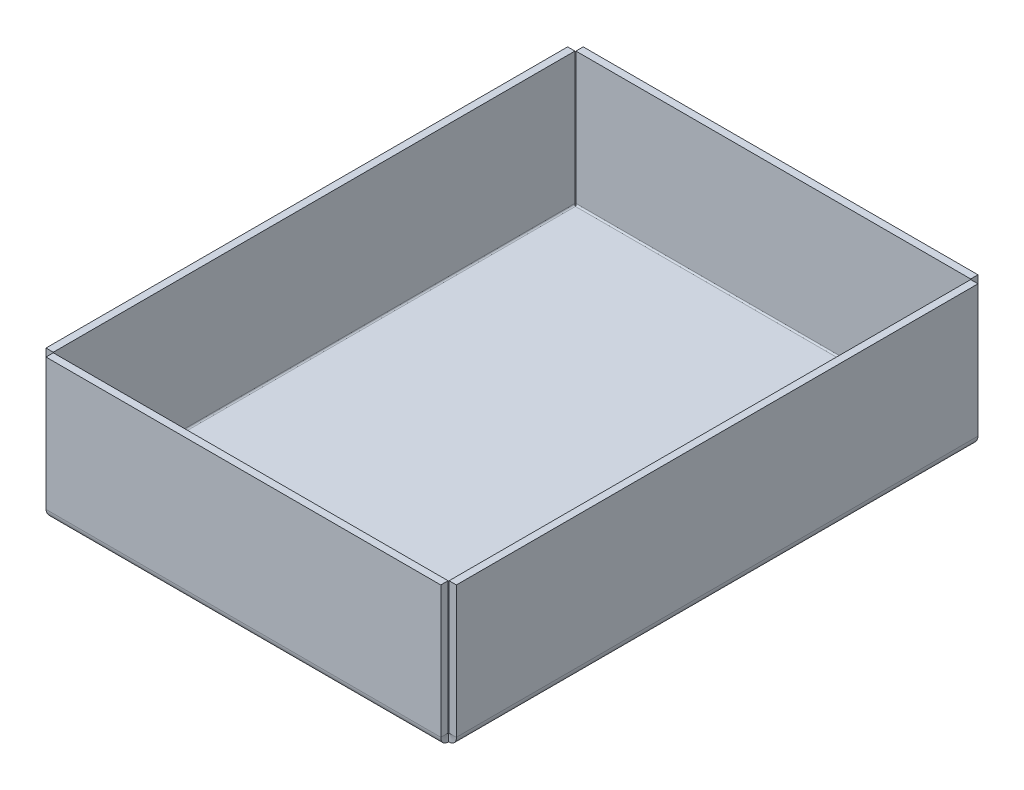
ISO-10303-21;
HEADER;
FILE_DESCRIPTION(('STEP AP214'),'2;1');
FILE_NAME('part.step','',(''),(''),'','','');
FILE_SCHEMA(('AUTOMOTIVE_DESIGN { 1 0 10303 214 1 1 1 1 }'));
ENDSEC;
DATA;
#1=APPLICATION_CONTEXT('core data for automotive mechanical design processes');
#2=APPLICATION_PROTOCOL_DEFINITION('international standard','automotive_design',2000,#1);
#3=PRODUCT_CONTEXT('',#1,'mechanical');
#4=PRODUCT('Part','Part','',(#3));
#5=PRODUCT_RELATED_PRODUCT_CATEGORY('part','',(#4));
#6=PRODUCT_DEFINITION_FORMATION('','',#4);
#7=PRODUCT_DEFINITION_CONTEXT('part definition',#1,'design');
#8=PRODUCT_DEFINITION('design','',#6,#7);
#9=PRODUCT_DEFINITION_SHAPE('','',#8);
#10=(LENGTH_UNIT() NAMED_UNIT(*) SI_UNIT(.MILLI.,.METRE.));
#11=(NAMED_UNIT(*) PLANE_ANGLE_UNIT() SI_UNIT($,.RADIAN.));
#12=(NAMED_UNIT(*) SI_UNIT($,.STERADIAN.) SOLID_ANGLE_UNIT());
#13=UNCERTAINTY_MEASURE_WITH_UNIT(LENGTH_MEASURE(1.E-05),#10,'distance_accuracy_value','');
#14=(GEOMETRIC_REPRESENTATION_CONTEXT(3) GLOBAL_UNCERTAINTY_ASSIGNED_CONTEXT((#13)) GLOBAL_UNIT_ASSIGNED_CONTEXT((#10,
#11,#12)) REPRESENTATION_CONTEXT('',''));
#15=CARTESIAN_POINT('',(0.,0.,0.));
#16=DIRECTION('',(0.,0.,1.));
#17=DIRECTION('',(1.,0.,0.));
#18=AXIS2_PLACEMENT_3D('',#15,#16,#17);
#19=CARTESIAN_POINT('',(0.,-2.54,0.));
#20=DIRECTION('',(0.,1.,0.));
#21=DIRECTION('',(0.,0.,1.));
#22=AXIS2_PLACEMENT_3D('',#19,#20,#21);
#23=PLANE('',#22);
#24=DIRECTION('',(0.,0.,-1.));
#25=VECTOR('',#24,1.);
#26=CARTESIAN_POINT('',(68.4570414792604,-2.54,-90.8790522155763));
#27=LINE('',#26,#25);
#28=CARTESIAN_POINT('',(68.4570414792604,-2.54,-90.5586573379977));
#29=VERTEX_POINT('',#28);
#30=CARTESIAN_POINT('',(68.4570414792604,-2.54,90.5586573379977));
#31=VERTEX_POINT('',#30);
#32=EDGE_CURVE('E220',#29,#31,#27,.F.);
#33=ORIENTED_EDGE('',*,*,#32,.T.);
#34=DIRECTION('',(1.,0.,0.));
#35=VECTOR('',#34,1.);
#36=CARTESIAN_POINT('',(68.777436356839,-2.54,90.5586573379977));
#37=LINE('',#36,#35);
#38=CARTESIAN_POINT('',(-68.4570414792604,-2.54,90.5586573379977));
#39=VERTEX_POINT('',#38);
#40=EDGE_CURVE('E460',#31,#39,#37,.F.);
#41=ORIENTED_EDGE('',*,*,#40,.T.);
#42=DIRECTION('',(0.,0.,1.));
#43=VECTOR('',#42,1.);
#44=CARTESIAN_POINT('',(-68.4570414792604,-2.54,90.8790522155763));
#45=LINE('',#44,#43);
#46=CARTESIAN_POINT('',(-68.4570414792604,-2.54,-90.5586573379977));
#47=VERTEX_POINT('',#46);
#48=EDGE_CURVE('E378',#39,#47,#45,.F.);
#49=ORIENTED_EDGE('',*,*,#48,.T.);
#50=DIRECTION('',(-1.,0.,0.));
#51=VECTOR('',#50,1.);
#52=CARTESIAN_POINT('',(-68.777436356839,-2.54,-90.5586573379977));
#53=LINE('',#52,#51);
#54=EDGE_CURVE('E297',#47,#29,#53,.F.);
#55=ORIENTED_EDGE('',*,*,#54,.T.);
#56=EDGE_LOOP('',(#33,#41,#49,#55));
#57=FACE_BOUND('',#56,.T.);
#58=ADVANCED_FACE('F35',(#57),#23,.F.);
#59=CARTESIAN_POINT('',(0.,0.,0.));
#60=DIRECTION('',(0.,1.,0.));
#61=DIRECTION('',(0.,0.,1.));
#62=AXIS2_PLACEMENT_3D('',#59,#60,#61);
#63=PLANE('',#62);
#64=DIRECTION('',(1.,0.,0.));
#65=VECTOR('',#64,1.);
#66=CARTESIAN_POINT('',(68.777436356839,0.,90.5586573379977));
#67=LINE('',#66,#65);
#68=CARTESIAN_POINT('',(68.4570414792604,0.,90.5586573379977));
#69=VERTEX_POINT('',#68);
#70=CARTESIAN_POINT('',(-68.4570414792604,0.,90.5586573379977));
#71=VERTEX_POINT('',#70);
#72=EDGE_CURVE('E452',#69,#71,#67,.F.);
#73=ORIENTED_EDGE('',*,*,#72,.F.);
#74=DIRECTION('',(0.,0.,-1.));
#75=VECTOR('',#74,1.);
#76=CARTESIAN_POINT('',(68.4570414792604,0.,-90.8790522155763));
#77=LINE('',#76,#75);
#78=CARTESIAN_POINT('',(68.4570414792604,0.,-90.5586573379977));
#79=VERTEX_POINT('',#78);
#80=EDGE_CURVE('E211',#79,#69,#77,.F.);
#81=ORIENTED_EDGE('',*,*,#80,.F.);
#82=DIRECTION('',(-1.,0.,0.));
#83=VECTOR('',#82,1.);
#84=CARTESIAN_POINT('',(-68.777436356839,0.,-90.5586573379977));
#85=LINE('',#84,#83);
#86=CARTESIAN_POINT('',(-68.4570414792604,0.,-90.5586573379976));
#87=VERTEX_POINT('',#86);
#88=EDGE_CURVE('E55',#87,#79,#85,.F.);
#89=ORIENTED_EDGE('',*,*,#88,.F.);
#90=DIRECTION('',(0.,0.,1.));
#91=VECTOR('',#90,1.);
#92=CARTESIAN_POINT('',(-68.4570414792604,0.,90.8790522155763));
#93=LINE('',#92,#91);
#94=EDGE_CURVE('E50',#71,#87,#93,.F.);
#95=ORIENTED_EDGE('',*,*,#94,.F.);
#96=EDGE_LOOP('',(#73,#81,#89,#95));
#97=FACE_BOUND('',#96,.T.);
#98=ADVANCED_FACE('F37',(#97),#63,.T.);
#99=CARTESIAN_POINT('',(-68.4570414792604,-2.5654,90.5586573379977));
#100=CARTESIAN_POINT('',(-68.4837458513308,-2.5654,90.9599892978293));
#101=CARTESIAN_POINT('',(-68.5104406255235,-2.48561584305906,91.3610193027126));
#102=CARTESIAN_POINT('',(-68.5638397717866,-2.17850479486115,92.1024509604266));
#103=CARTESIAN_POINT('',(-68.5905393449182,-1.95129873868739,92.4424888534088));
#104=CARTESIAN_POINT('',(-68.6439384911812,-1.38383151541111,93.009956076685));
#105=CARTESIAN_POINT('',(-68.6706380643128,-1.04379362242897,93.2371621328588));
#106=CARTESIAN_POINT('',(-68.7240372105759,-0.302361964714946,93.5442731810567));
#107=CARTESIAN_POINT('',(-68.7507319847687,0.0986680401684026,93.6240573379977));
#108=CARTESIAN_POINT('',(-68.777436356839,0.5,93.6240573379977));
#109=CARTESIAN_POINT('',(-68.4570414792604,-2.54,90.5586573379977));
#110=CARTESIAN_POINT('',(-68.4837458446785,-2.54,90.956663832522));
#111=CARTESIAN_POINT('',(-68.5104406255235,-2.46087693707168,91.3543709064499));
#112=CARTESIAN_POINT('',(-68.5638397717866,-2.15631062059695,92.0896590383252));
#113=CARTESIAN_POINT('',(-68.5905393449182,-1.93098720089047,92.4268793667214));
#114=CARTESIAN_POINT('',(-68.6439384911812,-1.36822202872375,92.9896445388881));
#115=CARTESIAN_POINT('',(-68.6706380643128,-1.03100170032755,93.2149679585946));
#116=CARTESIAN_POINT('',(-68.7240372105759,-0.29571356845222,93.5195342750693));
#117=CARTESIAN_POINT('',(-68.750731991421,0.101993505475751,93.5986573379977));
#118=CARTESIAN_POINT('',(-68.777436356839,0.5,93.5986573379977));
#119=CARTESIAN_POINT('',(-68.4570414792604,0.,90.5586573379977));
#120=CARTESIAN_POINT('',(-68.4837451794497,0.,90.6241173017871));
#121=CARTESIAN_POINT('',(-68.5104406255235,0.0130136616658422,90.6895312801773));
#122=CARTESIAN_POINT('',(-68.5638397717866,0.0631068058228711,90.8104668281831));
#123=CARTESIAN_POINT('',(-68.5905393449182,0.10016657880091,90.8659306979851));
#124=CARTESIAN_POINT('',(-68.6439384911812,0.192726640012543,90.9584907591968));
#125=CARTESIAN_POINT('',(-68.6706380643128,0.248190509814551,90.9955505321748));
#126=CARTESIAN_POINT('',(-68.7240372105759,0.36912605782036,91.0456436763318));
#127=CARTESIAN_POINT('',(-68.7507326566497,0.434540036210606,91.0586573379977));
#128=CARTESIAN_POINT('',(-68.777436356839,0.5,91.0586573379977));
#129=CARTESIAN_POINT('',(-68.4570414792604,0.025654,90.5586573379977));
#130=CARTESIAN_POINT('',(-68.4837451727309,0.025654,90.6207585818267));
#131=CARTESIAN_POINT('',(-68.5104406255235,0.0379999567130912,90.682816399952));
#132=CARTESIAN_POINT('',(-68.5638397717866,0.0855229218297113,90.7975469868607));
#133=CARTESIAN_POINT('',(-68.5905393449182,0.120681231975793,90.8501651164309));
#134=CARTESIAN_POINT('',(-68.6439384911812,0.208492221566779,90.9379761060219));
#135=CARTESIAN_POINT('',(-68.6706380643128,0.261110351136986,90.973134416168));
#136=CARTESIAN_POINT('',(-68.7240372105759,0.375840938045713,91.0206573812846));
#137=CARTESIAN_POINT('',(-68.7507326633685,0.437898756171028,91.0330033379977));
#138=CARTESIAN_POINT('',(-68.777436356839,0.5,91.0330033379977));
#139=B_SPLINE_SURFACE_WITH_KNOTS('',1,3,((#99,#100,#101,#102,#103,#104,#105,#106,#107,#108),
(#109,#110,#111,#112,#113,#114,#115,#116,#117,#118),(#119,#120,#121,#122,#123,#124,#125,#126,
#127,#128),(#129,#130,#131,#132,#133,#134,#135,#136,#137,#138)),.UNSPECIFIED.,.F.,.F.,.F.,(2,1,
1,2),(4,2,2,2,4),(-0.01,0.,1.,1.0101),(0.,0.25,0.5,0.75,1.),.UNSPECIFIED.);
#140=DIRECTION('',(0.,0.,-1.));
#141=VECTOR('',#140,1.);
#142=CARTESIAN_POINT('',(-68.777436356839,0.5,91.0586573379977));
#143=LINE('',#142,#141);
#144=CARTESIAN_POINT('',(-68.777436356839,0.5,93.5986573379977));
#145=VERTEX_POINT('',#144);
#146=CARTESIAN_POINT('',(-68.777436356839,0.5,91.0586573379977));
#147=VERTEX_POINT('',#146);
#148=EDGE_CURVE('E445',#145,#147,#143,.T.);
#149=CARTESIAN_POINT('',(-68.4570414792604,0.,90.5586573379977));
#150=CARTESIAN_POINT('',(-68.4603789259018,-1.73544388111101E-07,90.5668385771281));
#151=CARTESIAN_POINT('',(-68.4637163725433,0.000200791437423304,90.5750198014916));
#152=CARTESIAN_POINT('',(-68.4703912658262,0.00100375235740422,90.5913625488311));
#153=CARTESIAN_POINT('',(-68.4737287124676,0.00160574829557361,90.5995240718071));
#154=CARTESIAN_POINT('',(-68.4804036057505,0.00320952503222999,90.6158077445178));
#155=CARTESIAN_POINT('',(-68.4837410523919,0.00421130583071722,90.6239298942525));
#156=CARTESIAN_POINT('',(-68.4904159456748,0.00661218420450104,90.6401152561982));
#157=CARTESIAN_POINT('',(-68.4937533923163,0.00801128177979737,90.6481784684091));
#158=CARTESIAN_POINT('',(-68.5004282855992,0.0112034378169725,90.6642265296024));
#159=CARTESIAN_POINT('',(-68.5037657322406,0.0129964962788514,90.6722113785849));
#160=CARTESIAN_POINT('',(-68.5104406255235,0.0169722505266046,90.6880834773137));
#161=CARTESIAN_POINT('',(-68.5137780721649,0.0191549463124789,90.6959707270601));
#162=CARTESIAN_POINT('',(-68.5204529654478,0.0239047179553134,90.7116286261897));
#163=CARTESIAN_POINT('',(-68.5237904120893,0.0264717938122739,90.7193992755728));
#164=CARTESIAN_POINT('',(-68.5304653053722,0.0319841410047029,90.7348052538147));
#165=CARTESIAN_POINT('',(-68.5338027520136,0.034929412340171,90.7424405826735));
#166=CARTESIAN_POINT('',(-68.5404776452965,0.0411910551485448,90.7575575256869));
#167=CARTESIAN_POINT('',(-68.543815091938,0.0445074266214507,90.7650391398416));
#168=CARTESIAN_POINT('',(-68.5504899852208,0.0515032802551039,90.779830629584));
#169=CARTESIAN_POINT('',(-68.5538274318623,0.0551827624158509,90.7871405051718));
#170=CARTESIAN_POINT('',(-68.5605023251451,0.0628959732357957,90.8015709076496));
#171=CARTESIAN_POINT('',(-68.5638397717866,0.0669297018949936,90.8086914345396));
#172=CARTESIAN_POINT('',(-68.5705146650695,0.0753416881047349,90.822725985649));
#173=CARTESIAN_POINT('',(-68.5738521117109,0.0797199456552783,90.8296400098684));
#174=CARTESIAN_POINT('',(-68.5805270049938,0.0888104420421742,90.8432448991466));
#175=CARTESIAN_POINT('',(-68.5838644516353,0.0935226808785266,90.8499357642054));
#176=CARTESIAN_POINT('',(-68.5905393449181,0.103269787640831,90.8630782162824));
#177=CARTESIAN_POINT('',(-68.5938767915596,0.108304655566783,90.8695298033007));
#178=CARTESIAN_POINT('',(-68.6005516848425,0.11868489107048,90.8821781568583));
#179=CARTESIAN_POINT('',(-68.603889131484,0.124030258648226,90.8883749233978));
#180=CARTESIAN_POINT('',(-68.6105640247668,0.135018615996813,90.9004987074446));
#181=CARTESIAN_POINT('',(-68.6139014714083,0.140661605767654,90.9064257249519));
#182=CARTESIAN_POINT('',(-68.6205763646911,0.152231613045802,90.91799573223));
#183=CARTESIAN_POINT('',(-68.6239138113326,0.158158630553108,90.9236387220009));
#184=CARTESIAN_POINT('',(-68.6305887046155,0.170282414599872,90.9346270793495));
#185=CARTESIAN_POINT('',(-68.6339261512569,0.176479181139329,90.9399724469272));
#186=CARTESIAN_POINT('',(-68.6406010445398,0.189127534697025,90.9503526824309));
#187=CARTESIAN_POINT('',(-68.6439384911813,0.195579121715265,90.9553875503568));
#188=CARTESIAN_POINT('',(-68.6506133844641,0.208721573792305,90.9651346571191));
#189=CARTESIAN_POINT('',(-68.6539508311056,0.215412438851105,90.9698468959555));
#190=CARTESIAN_POINT('',(-68.6606257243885,0.229017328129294,90.9789373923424));
#191=CARTESIAN_POINT('',(-68.6639631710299,0.235931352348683,90.9833156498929));
#192=CARTESIAN_POINT('',(-68.6706380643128,0.249965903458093,90.9917276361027));
#193=CARTESIAN_POINT('',(-68.6739755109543,0.257086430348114,90.9957613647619));
#194=CARTESIAN_POINT('',(-68.6806504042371,0.271516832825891,91.0034745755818));
#195=CARTESIAN_POINT('',(-68.6839878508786,0.278826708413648,91.0071540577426));
#196=CARTESIAN_POINT('',(-68.6906627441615,0.293618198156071,91.0141499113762));
#197=CARTESIAN_POINT('',(-68.694000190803,0.301099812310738,91.0174662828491));
#198=CARTESIAN_POINT('',(-68.7006750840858,0.31621675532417,91.0237279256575));
#199=CARTESIAN_POINT('',(-68.7040125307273,0.323852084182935,91.026673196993));
#200=CARTESIAN_POINT('',(-68.7106874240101,0.339258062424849,91.0321855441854));
#201=CARTESIAN_POINT('',(-68.7140248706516,0.347028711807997,91.0347526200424));
#202=CARTESIAN_POINT('',(-68.7206997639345,0.362686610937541,91.0395023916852));
#203=CARTESIAN_POINT('',(-68.7240372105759,0.370573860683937,91.0416850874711));
#204=CARTESIAN_POINT('',(-68.7307121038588,0.386445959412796,91.0456608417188));
#205=CARTESIAN_POINT('',(-68.7340495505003,0.39443080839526,91.0474539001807));
#206=CARTESIAN_POINT('',(-68.7407244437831,0.410478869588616,91.0506460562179));
#207=CARTESIAN_POINT('',(-68.7440618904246,0.418542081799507,91.0520451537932));
#208=CARTESIAN_POINT('',(-68.7507367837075,0.434727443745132,91.054446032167));
#209=CARTESIAN_POINT('',(-68.7540742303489,0.442849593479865,91.0554478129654));
#210=CARTESIAN_POINT('',(-68.7607491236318,0.459133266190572,91.0570515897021));
#211=CARTESIAN_POINT('',(-68.7640865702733,0.467294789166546,91.0576535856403));
#212=CARTESIAN_POINT('',(-68.7707614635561,0.48363753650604,91.0584565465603));
#213=CARTESIAN_POINT('',(-68.7740989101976,0.49181876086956,91.0586575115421));
#214=CARTESIAN_POINT('',(-68.777436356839,0.5,91.0586573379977));
#215=B_SPLINE_CURVE_WITH_KNOTS('',3,(#149,#150,#151,#152,#153,#154,#155,#156,#157,#158,#159,
#160,#161,#162,#163,#164,#165,#166,#167,#168,#169,#170,#171,#172,#173,#174,#175,#176,#177,#178,
#179,#180,#181,#182,#183,#184,#185,#186,#187,#188,#189,#190,#191,#192,#193,#194,#195,#196,#197,
#198,#199,#200,#201,#202,#203,#204,#205,#206,#207,#208,#209,#210,#211,#212,#213,#214),
.UNSPECIFIED.,.F.,.F.,(4,2,2,2,2,2,2,2,2,2,2,2,2,2,2,2,2,2,2,2,2,2,2,2,2,2,2,2,2,2,2,2,4),(0.,
0.0265050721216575,0.0530101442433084,0.079515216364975,0.106020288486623,0.132525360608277,
0.159030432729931,0.185535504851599,0.212040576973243,0.238545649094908,0.265050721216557,
0.291555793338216,0.318060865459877,0.344565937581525,0.371071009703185,0.397576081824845,
0.424081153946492,0.450586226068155,0.477091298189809,0.503596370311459,0.530101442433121,
0.556606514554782,0.583111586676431,0.609616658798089,0.636121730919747,0.662626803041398,
0.689131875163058,0.71563694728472,0.742142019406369,0.768647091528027,0.795152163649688,
0.821657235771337,0.848162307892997),.UNSPECIFIED.);
#216=EDGE_CURVE('E454',#71,#147,#215,.T.);
#217=DIRECTION('',(0.,-1.,0.));
#218=VECTOR('',#217,1.);
#219=CARTESIAN_POINT('',(-68.4570414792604,0.,90.5586573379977));
#220=LINE('',#219,#218);
#221=EDGE_CURVE('E11',#71,#39,#220,.T.);
#222=CARTESIAN_POINT('',(-68.4570414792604,-2.54,90.5586573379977));
#223=CARTESIAN_POINT('',(-68.4603789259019,-2.54000105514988,90.6083992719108));
#224=CARTESIAN_POINT('',(-68.4637163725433,-2.53877918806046,90.658141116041));
#225=CARTESIAN_POINT('',(-68.4703912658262,-2.53389718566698,90.7575050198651));
#226=CARTESIAN_POINT('',(-68.4737287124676,-2.53023705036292,90.807127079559));
#227=CARTESIAN_POINT('',(-68.4804036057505,-2.52048608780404,90.9061318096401));
#228=CARTESIAN_POINT('',(-68.4837410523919,-2.51439526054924,90.9555144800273));
#229=CARTESIAN_POINT('',(-68.4904159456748,-2.49979792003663,91.0539214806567));
#230=CARTESIAN_POINT('',(-68.4937533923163,-2.49129140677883,91.1029458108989));
#231=CARTESIAN_POINT('',(-68.5004282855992,-2.47188309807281,91.2005180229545));
#232=CARTESIAN_POINT('',(-68.5037657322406,-2.46098130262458,91.2490659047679));
#233=CARTESIAN_POINT('',(-68.5104406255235,-2.43680871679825,91.3455682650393));
#234=CARTESIAN_POINT('',(-68.5137780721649,-2.42353792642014,91.3935227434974));
#235=CARTESIAN_POINT('',(-68.5204529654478,-2.39465931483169,91.4887227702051));
#236=CARTESIAN_POINT('',(-68.5237904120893,-2.37905149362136,91.5359683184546));
#237=CARTESIAN_POINT('',(-68.5304653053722,-2.3455364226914,91.6296366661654));
#238=CARTESIAN_POINT('',(-68.5338027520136,-2.32762917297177,91.6760594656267));
#239=CARTESIAN_POINT('',(-68.5404776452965,-2.28955838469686,91.7679704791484));
#240=CARTESIAN_POINT('',(-68.543815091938,-2.26939484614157,91.8134586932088));
#241=CARTESIAN_POINT('',(-68.5504899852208,-2.22686005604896,91.9033909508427));
#242=CARTESIAN_POINT('',(-68.5538274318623,-2.20448880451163,91.9478349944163));
#243=CARTESIAN_POINT('',(-68.5605023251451,-2.15759248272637,92.0355718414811));
#244=CARTESIAN_POINT('',(-68.5638397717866,-2.13306741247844,92.0788646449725));
#245=CARTESIAN_POINT('',(-68.5705146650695,-2.08192253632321,92.1641947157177));
#246=CARTESIAN_POINT('',(-68.5738521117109,-2.0553027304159,92.2062319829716));
#247=CARTESIAN_POINT('',(-68.5805270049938,-2.00003251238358,92.288949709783));
#248=CARTESIAN_POINT('',(-68.5838644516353,-1.97138210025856,92.3296301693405));
#249=CARTESIAN_POINT('',(-68.5905393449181,-1.91211969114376,92.4095362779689));
#250=CARTESIAN_POINT('',(-68.5938767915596,-1.88150769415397,92.4487619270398));
#251=CARTESIAN_POINT('',(-68.6005516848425,-1.81839586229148,92.5256639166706));
#252=CARTESIAN_POINT('',(-68.603889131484,-1.78589602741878,92.5633402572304));
#253=CARTESIAN_POINT('',(-68.6105640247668,-1.71908681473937,92.6370528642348));
#254=CARTESIAN_POINT('',(-68.6139014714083,-1.68477743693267,92.6730891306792));
#255=CARTESIAN_POINT('',(-68.6205763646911,-1.61443179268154,92.7434347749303));
#256=CARTESIAN_POINT('',(-68.6239138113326,-1.5783955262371,92.777744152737));
#257=CARTESIAN_POINT('',(-68.6305887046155,-1.50468291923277,92.8445533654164));
#258=CARTESIAN_POINT('',(-68.6339261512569,-1.46700657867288,92.8770532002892));
#259=CARTESIAN_POINT('',(-68.6406010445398,-1.39010458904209,92.9401650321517));
#260=CARTESIAN_POINT('',(-68.6439384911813,-1.3508789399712,92.9707770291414));
#261=CARTESIAN_POINT('',(-68.6506133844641,-1.2709728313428,93.0300394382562));
#262=CARTESIAN_POINT('',(-68.6539508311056,-1.23029237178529,93.0586898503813));
#263=CARTESIAN_POINT('',(-68.6606257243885,-1.14757464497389,93.1139600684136));
#264=CARTESIAN_POINT('',(-68.6639631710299,-1.10553737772,93.1405798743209));
#265=CARTESIAN_POINT('',(-68.6706380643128,-1.02020730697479,93.1917247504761));
#266=CARTESIAN_POINT('',(-68.6739755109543,-0.976914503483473,93.216249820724));
#267=CARTESIAN_POINT('',(-68.6806504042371,-0.889177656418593,93.2631461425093));
#268=CARTESIAN_POINT('',(-68.6839878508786,-0.844733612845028,93.2855173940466));
#269=CARTESIAN_POINT('',(-68.6906627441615,-0.754801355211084,93.3280521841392));
#270=CARTESIAN_POINT('',(-68.694000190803,-0.709313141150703,93.3482157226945));
#271=CARTESIAN_POINT('',(-68.7006750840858,-0.617402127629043,93.3862865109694));
#272=CARTESIAN_POINT('',(-68.7040125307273,-0.570979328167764,93.4041937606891));
#273=CARTESIAN_POINT('',(-68.7106874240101,-0.477310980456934,93.437708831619));
#274=CARTESIAN_POINT('',(-68.7140248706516,-0.430065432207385,93.4533166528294));
#275=CARTESIAN_POINT('',(-68.7206997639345,-0.334865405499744,93.4821952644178));
#276=CARTESIAN_POINT('',(-68.7240372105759,-0.286910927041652,93.4954660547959));
#277=CARTESIAN_POINT('',(-68.7307121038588,-0.190408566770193,93.5196386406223));
#278=CARTESIAN_POINT('',(-68.7340495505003,-0.141860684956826,93.5305404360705));
#279=CARTESIAN_POINT('',(-68.7407244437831,-0.0442884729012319,93.5499487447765));
#280=CARTESIAN_POINT('',(-68.7440618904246,0.00473585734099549,93.5584552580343));
#281=CARTESIAN_POINT('',(-68.7507367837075,0.103142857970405,93.5730525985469));
#282=CARTESIAN_POINT('',(-68.7540742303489,0.152525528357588,93.5791434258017));
#283=CARTESIAN_POINT('',(-68.7607491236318,0.251530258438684,93.5888943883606));
#284=CARTESIAN_POINT('',(-68.7640865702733,0.301152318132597,93.5925545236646));
#285=CARTESIAN_POINT('',(-68.7707614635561,0.400516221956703,93.5974365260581));
#286=CARTESIAN_POINT('',(-68.7740989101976,0.450258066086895,93.5986583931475));
#287=CARTESIAN_POINT('',(-68.777436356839,0.5,93.5986573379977));
#288=B_SPLINE_CURVE_WITH_KNOTS('',3,(#222,#223,#224,#225,#226,#227,#228,#229,#230,#231,#232,
#233,#234,#235,#236,#237,#238,#239,#240,#241,#242,#243,#244,#245,#246,#247,#248,#249,#250,#251,
#252,#253,#254,#255,#256,#257,#258,#259,#260,#261,#262,#263,#264,#265,#266,#267,#268,#269,#270,
#271,#272,#273,#274,#275,#276,#277,#278,#279,#280,#281,#282,#283,#284,#285,#286,#287),
.UNSPECIFIED.,.F.,.F.,(4,2,2,2,2,2,2,2,2,2,2,2,2,2,2,2,2,2,2,2,2,2,2,2,2,2,2,2,2,2,2,2,4),(0.,
0.149546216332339,0.299092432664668,0.448638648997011,0.598184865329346,0.747731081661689,
0.897277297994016,1.04682351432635,1.1963697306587,1.34591594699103,1.49546216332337,
1.6450083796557,1.79455459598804,1.94410081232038,2.09364702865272,2.24319324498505,
2.39273946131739,2.54228567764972,2.69183189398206,2.84137811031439,2.99092432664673,
3.14047054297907,3.29001675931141,3.43956297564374,3.58910919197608,3.73865540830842,
3.88820162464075,4.03774784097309,4.18729405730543,4.33684027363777,4.4863864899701,
4.63593270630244,4.78547892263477),.UNSPECIFIED.);
#289=EDGE_CURVE('E486',#39,#145,#288,.T.);
#290=ORIENTED_EDGE('',*,*,#148,.T.);
#291=ORIENTED_EDGE('',*,*,#216,.F.);
#292=ORIENTED_EDGE('',*,*,#221,.T.);
#293=ORIENTED_EDGE('',*,*,#289,.T.);
#294=EDGE_LOOP('',(#290,#291,#292,#293));
#295=FACE_BOUND('',#294,.T.);
#296=ADVANCED_FACE('F477',(#295),#139,.F.);
#297=CARTESIAN_POINT('',(68.777436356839,0.5,93.6240573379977));
#298=CARTESIAN_POINT('',(68.7507319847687,0.0986680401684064,93.6240573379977));
#299=CARTESIAN_POINT('',(68.7240372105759,-0.302361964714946,93.5442731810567));
#300=CARTESIAN_POINT('',(68.6706380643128,-1.04379362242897,93.2371621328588));
#301=CARTESIAN_POINT('',(68.6439384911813,-1.38383151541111,93.009956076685));
#302=CARTESIAN_POINT('',(68.5905393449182,-1.95129873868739,92.4424888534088));
#303=CARTESIAN_POINT('',(68.5638397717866,-2.17850479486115,92.1024509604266));
#304=CARTESIAN_POINT('',(68.5104406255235,-2.48561584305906,91.3610193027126));
#305=CARTESIAN_POINT('',(68.4837458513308,-2.5654,90.9599892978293));
#306=CARTESIAN_POINT('',(68.4570414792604,-2.5654,90.5586573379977));
#307=CARTESIAN_POINT('',(68.777436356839,0.5,93.5986573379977));
#308=CARTESIAN_POINT('',(68.750731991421,0.101993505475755,93.5986573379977));
#309=CARTESIAN_POINT('',(68.7240372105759,-0.29571356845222,93.5195342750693));
#310=CARTESIAN_POINT('',(68.6706380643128,-1.03100170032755,93.2149679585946));
#311=CARTESIAN_POINT('',(68.6439384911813,-1.36822202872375,92.9896445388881));
#312=CARTESIAN_POINT('',(68.5905393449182,-1.93098720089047,92.4268793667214));
#313=CARTESIAN_POINT('',(68.5638397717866,-2.15631062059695,92.0896590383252));
#314=CARTESIAN_POINT('',(68.5104406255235,-2.46087693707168,91.3543709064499));
#315=CARTESIAN_POINT('',(68.4837458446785,-2.54,90.956663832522));
#316=CARTESIAN_POINT('',(68.4570414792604,-2.54,90.5586573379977));
#317=CARTESIAN_POINT('',(68.777436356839,0.5,91.0586573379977));
#318=CARTESIAN_POINT('',(68.7507326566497,0.434540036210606,91.0586573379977));
#319=CARTESIAN_POINT('',(68.7240372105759,0.36912605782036,91.0456436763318));
#320=CARTESIAN_POINT('',(68.6706380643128,0.248190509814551,90.9955505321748));
#321=CARTESIAN_POINT('',(68.6439384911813,0.192726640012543,90.9584907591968));
#322=CARTESIAN_POINT('',(68.5905393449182,0.10016657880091,90.8659306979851));
#323=CARTESIAN_POINT('',(68.5638397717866,0.0631068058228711,90.8104668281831));
#324=CARTESIAN_POINT('',(68.5104406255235,0.0130136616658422,90.6895312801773));
#325=CARTESIAN_POINT('',(68.4837451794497,0.,90.6241173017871));
#326=CARTESIAN_POINT('',(68.4570414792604,0.,90.5586573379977));
#327=CARTESIAN_POINT('',(68.777436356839,0.5,91.0330033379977));
#328=CARTESIAN_POINT('',(68.7507326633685,0.437898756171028,91.0330033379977));
#329=CARTESIAN_POINT('',(68.7240372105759,0.375840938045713,91.0206573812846));
#330=CARTESIAN_POINT('',(68.6706380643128,0.261110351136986,90.973134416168));
#331=CARTESIAN_POINT('',(68.6439384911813,0.208492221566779,90.9379761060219));
#332=CARTESIAN_POINT('',(68.5905393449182,0.120681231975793,90.8501651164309));
#333=CARTESIAN_POINT('',(68.5638397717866,0.0855229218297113,90.7975469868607));
#334=CARTESIAN_POINT('',(68.5104406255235,0.0379999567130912,90.682816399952));
#335=CARTESIAN_POINT('',(68.4837451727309,0.025654,90.6207585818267));
#336=CARTESIAN_POINT('',(68.4570414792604,0.025654,90.5586573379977));
#337=B_SPLINE_SURFACE_WITH_KNOTS('',1,3,((#297,#298,#299,#300,#301,#302,#303,#304,#305,#306),
(#307,#308,#309,#310,#311,#312,#313,#314,#315,#316),(#317,#318,#319,#320,#321,#322,#323,#324,
#325,#326),(#327,#328,#329,#330,#331,#332,#333,#334,#335,#336)),.UNSPECIFIED.,.F.,.F.,.F.,(2,1,
1,2),(4,2,2,2,4),(-0.01,0.,1.,1.0101),(0.,0.25,0.5,0.75,1.),.UNSPECIFIED.);
#338=CARTESIAN_POINT('',(68.777436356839,0.5,91.0586573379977));
#339=CARTESIAN_POINT('',(68.7740989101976,0.491818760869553,91.0586575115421));
#340=CARTESIAN_POINT('',(68.7707614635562,0.483637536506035,91.0584565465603));
#341=CARTESIAN_POINT('',(68.7640865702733,0.467294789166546,91.0576535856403));
#342=CARTESIAN_POINT('',(68.7607491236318,0.459133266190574,91.0570515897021));
#343=CARTESIAN_POINT('',(68.7540742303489,0.442849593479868,91.0554478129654));
#344=CARTESIAN_POINT('',(68.7507367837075,0.434727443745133,91.054446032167));
#345=CARTESIAN_POINT('',(68.7440618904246,0.418542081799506,91.0520451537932));
#346=CARTESIAN_POINT('',(68.7407244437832,0.410478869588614,91.0506460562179));
#347=CARTESIAN_POINT('',(68.7340495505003,0.394430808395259,91.0474539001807));
#348=CARTESIAN_POINT('',(68.7307121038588,0.386445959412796,91.0456608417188));
#349=CARTESIAN_POINT('',(68.7240372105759,0.370573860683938,91.0416850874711));
#350=CARTESIAN_POINT('',(68.7206997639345,0.362686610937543,91.0395023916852));
#351=CARTESIAN_POINT('',(68.7140248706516,0.347028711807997,91.0347526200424));
#352=CARTESIAN_POINT('',(68.7106874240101,0.339258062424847,91.0321855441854));
#353=CARTESIAN_POINT('',(68.7040125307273,0.323852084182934,91.026673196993));
#354=CARTESIAN_POINT('',(68.7006750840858,0.31621675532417,91.0237279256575));
#355=CARTESIAN_POINT('',(68.6940001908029,0.30109981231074,91.0174662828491));
#356=CARTESIAN_POINT('',(68.6906627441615,0.293618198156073,91.0141499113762));
#357=CARTESIAN_POINT('',(68.6839878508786,0.278826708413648,91.0071540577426));
#358=CARTESIAN_POINT('',(68.6806504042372,0.27151683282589,91.0034745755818));
#359=CARTESIAN_POINT('',(68.6739755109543,0.257086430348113,90.9957613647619));
#360=CARTESIAN_POINT('',(68.6706380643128,0.249965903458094,90.9917276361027));
#361=CARTESIAN_POINT('',(68.6639631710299,0.235931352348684,90.9833156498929));
#362=CARTESIAN_POINT('',(68.6606257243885,0.229017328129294,90.9789373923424));
#363=CARTESIAN_POINT('',(68.6539508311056,0.215412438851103,90.9698468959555));
#364=CARTESIAN_POINT('',(68.6506133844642,0.208721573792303,90.9651346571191));
#365=CARTESIAN_POINT('',(68.6439384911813,0.195579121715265,90.9553875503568));
#366=CARTESIAN_POINT('',(68.6406010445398,0.189127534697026,90.9503526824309));
#367=CARTESIAN_POINT('',(68.6339261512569,0.17647918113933,90.9399724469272));
#368=CARTESIAN_POINT('',(68.6305887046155,0.170282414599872,90.9346270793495));
#369=CARTESIAN_POINT('',(68.6239138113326,0.158158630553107,90.9236387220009));
#370=CARTESIAN_POINT('',(68.6205763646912,0.152231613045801,90.91799573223));
#371=CARTESIAN_POINT('',(68.6139014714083,0.140661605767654,90.9064257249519));
#372=CARTESIAN_POINT('',(68.6105640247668,0.135018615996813,90.9004987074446));
#373=CARTESIAN_POINT('',(68.603889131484,0.124030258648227,90.8883749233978));
#374=CARTESIAN_POINT('',(68.6005516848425,0.118684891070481,90.8821781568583));
#375=CARTESIAN_POINT('',(68.5938767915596,0.108304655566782,90.8695298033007));
#376=CARTESIAN_POINT('',(68.5905393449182,0.103269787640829,90.8630782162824));
#377=CARTESIAN_POINT('',(68.5838644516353,0.0935226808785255,90.8499357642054));
#378=CARTESIAN_POINT('',(68.5805270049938,0.0888104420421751,90.8432448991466));
#379=CARTESIAN_POINT('',(68.5738521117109,0.0797199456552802,90.8296400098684));
#380=CARTESIAN_POINT('',(68.5705146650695,0.0753416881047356,90.822725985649));
#381=CARTESIAN_POINT('',(68.5638397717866,0.0669297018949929,90.8086914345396));
#382=CARTESIAN_POINT('',(68.5605023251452,0.0628959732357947,90.8015709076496));
#383=CARTESIAN_POINT('',(68.5538274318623,0.0551827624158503,90.7871405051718));
#384=CARTESIAN_POINT('',(68.5504899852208,0.0515032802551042,90.779830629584));
#385=CARTESIAN_POINT('',(68.543815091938,0.0445074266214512,90.7650391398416));
#386=CARTESIAN_POINT('',(68.5404776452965,0.0411910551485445,90.7575575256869));
#387=CARTESIAN_POINT('',(68.5338027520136,0.0349294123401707,90.7424405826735));
#388=CARTESIAN_POINT('',(68.5304653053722,0.0319841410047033,90.7348052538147));
#389=CARTESIAN_POINT('',(68.5237904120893,0.0264717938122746,90.7193992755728));
#390=CARTESIAN_POINT('',(68.5204529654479,0.0239047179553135,90.7116286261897));
#391=CARTESIAN_POINT('',(68.513778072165,0.0191549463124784,90.6959707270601));
#392=CARTESIAN_POINT('',(68.5104406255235,0.0169722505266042,90.6880834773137));
#393=CARTESIAN_POINT('',(68.5037657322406,0.0129964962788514,90.6722113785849));
#394=CARTESIAN_POINT('',(68.5004282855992,0.0112034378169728,90.6642265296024));
#395=CARTESIAN_POINT('',(68.4937533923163,0.00801128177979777,90.6481784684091));
#396=CARTESIAN_POINT('',(68.4904159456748,0.00661218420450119,90.6401152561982));
#397=CARTESIAN_POINT('',(68.483741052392,0.00421130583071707,90.6239298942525));
#398=CARTESIAN_POINT('',(68.4804036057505,0.00320952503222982,90.6158077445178));
#399=CARTESIAN_POINT('',(68.4737287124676,0.00160574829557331,90.5995240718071));
#400=CARTESIAN_POINT('',(68.4703912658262,0.00100375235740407,90.5913625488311));
#401=CARTESIAN_POINT('',(68.4637163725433,0.000200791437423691,90.5750198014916));
#402=CARTESIAN_POINT('',(68.4603789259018,-1.73544387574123E-07,90.5668385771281));
#403=CARTESIAN_POINT('',(68.4570414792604,0.,90.5586573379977));
#404=B_SPLINE_CURVE_WITH_KNOTS('',3,(#338,#339,#340,#341,#342,#343,#344,#345,#346,#347,#348,
#349,#350,#351,#352,#353,#354,#355,#356,#357,#358,#359,#360,#361,#362,#363,#364,#365,#366,#367,
#368,#369,#370,#371,#372,#373,#374,#375,#376,#377,#378,#379,#380,#381,#382,#383,#384,#385,#386,
#387,#388,#389,#390,#391,#392,#393,#394,#395,#396,#397,#398,#399,#400,#401,#402,#403),
.UNSPECIFIED.,.F.,.F.,(4,2,2,2,2,2,2,2,2,2,2,2,2,2,2,2,2,2,2,2,2,2,2,2,2,2,2,2,2,2,2,2,4),(0.,
0.0265050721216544,0.0530101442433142,0.0795152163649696,0.106020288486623,0.132525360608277,
0.159030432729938,0.185535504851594,0.212040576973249,0.238545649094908,0.265050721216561,
0.291555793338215,0.318060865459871,0.344565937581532,0.371071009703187,0.397576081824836,
0.424081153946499,0.450586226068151,0.477091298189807,0.503596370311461,0.530101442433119,
0.556606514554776,0.583111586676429,0.609616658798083,0.636121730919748,0.662626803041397,
0.68913187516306,0.715636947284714,0.742142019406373,0.768647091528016,0.795152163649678,
0.821657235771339,0.848162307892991),.UNSPECIFIED.);
#405=CARTESIAN_POINT('',(68.777436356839,0.5,91.0586573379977));
#406=VERTEX_POINT('',#405);
#407=EDGE_CURVE('E451',#406,#69,#404,.T.);
#408=DIRECTION('',(0.,0.,-1.));
#409=VECTOR('',#408,1.);
#410=CARTESIAN_POINT('',(68.777436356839,0.5,91.0586573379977));
#411=LINE('',#410,#409);
#412=CARTESIAN_POINT('',(68.777436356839,0.5,93.5986573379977));
#413=VERTEX_POINT('',#412);
#414=EDGE_CURVE('E448',#413,#406,#411,.T.);
#415=CARTESIAN_POINT('',(68.777436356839,0.5,93.5986573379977));
#416=CARTESIAN_POINT('',(68.7740989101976,0.450258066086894,93.5986583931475));
#417=CARTESIAN_POINT('',(68.7707614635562,0.400516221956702,93.5974365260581));
#418=CARTESIAN_POINT('',(68.7640865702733,0.301152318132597,93.5925545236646));
#419=CARTESIAN_POINT('',(68.7607491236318,0.251530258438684,93.5888943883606));
#420=CARTESIAN_POINT('',(68.7540742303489,0.152525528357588,93.5791434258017));
#421=CARTESIAN_POINT('',(68.7507367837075,0.103142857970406,93.5730525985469));
#422=CARTESIAN_POINT('',(68.7440618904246,0.00473585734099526,93.5584552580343));
#423=CARTESIAN_POINT('',(68.7407244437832,-0.0442884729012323,93.5499487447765));
#424=CARTESIAN_POINT('',(68.7340495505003,-0.141860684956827,93.5305404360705));
#425=CARTESIAN_POINT('',(68.7307121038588,-0.190408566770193,93.5196386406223));
#426=CARTESIAN_POINT('',(68.7240372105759,-0.286910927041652,93.4954660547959));
#427=CARTESIAN_POINT('',(68.7206997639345,-0.334865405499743,93.4821952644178));
#428=CARTESIAN_POINT('',(68.7140248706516,-0.430065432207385,93.4533166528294));
#429=CARTESIAN_POINT('',(68.7106874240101,-0.477310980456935,93.437708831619));
#430=CARTESIAN_POINT('',(68.7040125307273,-0.570979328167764,93.4041937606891));
#431=CARTESIAN_POINT('',(68.7006750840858,-0.617402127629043,93.3862865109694));
#432=CARTESIAN_POINT('',(68.6940001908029,-0.709313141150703,93.3482157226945));
#433=CARTESIAN_POINT('',(68.6906627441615,-0.754801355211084,93.3280521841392));
#434=CARTESIAN_POINT('',(68.6839878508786,-0.844733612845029,93.2855173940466));
#435=CARTESIAN_POINT('',(68.6806504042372,-0.889177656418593,93.2631461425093));
#436=CARTESIAN_POINT('',(68.6739755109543,-0.976914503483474,93.216249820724));
#437=CARTESIAN_POINT('',(68.6706380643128,-1.02020730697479,93.1917247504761));
#438=CARTESIAN_POINT('',(68.6639631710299,-1.10553737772,93.1405798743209));
#439=CARTESIAN_POINT('',(68.6606257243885,-1.14757464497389,93.1139600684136));
#440=CARTESIAN_POINT('',(68.6539508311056,-1.23029237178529,93.0586898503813));
#441=CARTESIAN_POINT('',(68.6506133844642,-1.2709728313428,93.0300394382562));
#442=CARTESIAN_POINT('',(68.6439384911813,-1.3508789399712,92.9707770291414));
#443=CARTESIAN_POINT('',(68.6406010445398,-1.39010458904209,92.9401650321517));
#444=CARTESIAN_POINT('',(68.6339261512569,-1.46700657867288,92.8770532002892));
#445=CARTESIAN_POINT('',(68.6305887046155,-1.50468291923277,92.8445533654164));
#446=CARTESIAN_POINT('',(68.6239138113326,-1.5783955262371,92.777744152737));
#447=CARTESIAN_POINT('',(68.6205763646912,-1.61443179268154,92.7434347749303));
#448=CARTESIAN_POINT('',(68.6139014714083,-1.68477743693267,92.6730891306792));
#449=CARTESIAN_POINT('',(68.6105640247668,-1.71908681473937,92.6370528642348));
#450=CARTESIAN_POINT('',(68.603889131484,-1.78589602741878,92.5633402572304));
#451=CARTESIAN_POINT('',(68.6005516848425,-1.81839586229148,92.5256639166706));
#452=CARTESIAN_POINT('',(68.5938767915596,-1.88150769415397,92.4487619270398));
#453=CARTESIAN_POINT('',(68.5905393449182,-1.91211969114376,92.4095362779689));
#454=CARTESIAN_POINT('',(68.5838644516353,-1.97138210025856,92.3296301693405));
#455=CARTESIAN_POINT('',(68.5805270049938,-2.00003251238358,92.288949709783));
#456=CARTESIAN_POINT('',(68.5738521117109,-2.0553027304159,92.2062319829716));
#457=CARTESIAN_POINT('',(68.5705146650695,-2.08192253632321,92.1641947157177));
#458=CARTESIAN_POINT('',(68.5638397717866,-2.13306741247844,92.0788646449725));
#459=CARTESIAN_POINT('',(68.5605023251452,-2.15759248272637,92.0355718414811));
#460=CARTESIAN_POINT('',(68.5538274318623,-2.20448880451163,91.9478349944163));
#461=CARTESIAN_POINT('',(68.5504899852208,-2.22686005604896,91.9033909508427));
#462=CARTESIAN_POINT('',(68.543815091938,-2.26939484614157,91.8134586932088));
#463=CARTESIAN_POINT('',(68.5404776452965,-2.28955838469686,91.7679704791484));
#464=CARTESIAN_POINT('',(68.5338027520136,-2.32762917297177,91.6760594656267));
#465=CARTESIAN_POINT('',(68.5304653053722,-2.3455364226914,91.6296366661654));
#466=CARTESIAN_POINT('',(68.5237904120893,-2.37905149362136,91.5359683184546));
#467=CARTESIAN_POINT('',(68.5204529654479,-2.39465931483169,91.4887227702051));
#468=CARTESIAN_POINT('',(68.513778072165,-2.42353792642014,91.3935227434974));
#469=CARTESIAN_POINT('',(68.5104406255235,-2.43680871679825,91.3455682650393));
#470=CARTESIAN_POINT('',(68.5037657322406,-2.46098130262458,91.2490659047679));
#471=CARTESIAN_POINT('',(68.5004282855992,-2.47188309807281,91.2005180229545));
#472=CARTESIAN_POINT('',(68.4937533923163,-2.49129140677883,91.1029458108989));
#473=CARTESIAN_POINT('',(68.4904159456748,-2.49979792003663,91.0539214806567));
#474=CARTESIAN_POINT('',(68.483741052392,-2.51439526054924,90.9555144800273));
#475=CARTESIAN_POINT('',(68.4804036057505,-2.52048608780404,90.9061318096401));
#476=CARTESIAN_POINT('',(68.4737287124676,-2.53023705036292,90.807127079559));
#477=CARTESIAN_POINT('',(68.4703912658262,-2.53389718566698,90.7575050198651));
#478=CARTESIAN_POINT('',(68.4637163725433,-2.53877918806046,90.658141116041));
#479=CARTESIAN_POINT('',(68.4603789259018,-2.54000105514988,90.6083992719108));
#480=CARTESIAN_POINT('',(68.4570414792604,-2.54,90.5586573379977));
#481=B_SPLINE_CURVE_WITH_KNOTS('',3,(#415,#416,#417,#418,#419,#420,#421,#422,#423,#424,#425,
#426,#427,#428,#429,#430,#431,#432,#433,#434,#435,#436,#437,#438,#439,#440,#441,#442,#443,#444,
#445,#446,#447,#448,#449,#450,#451,#452,#453,#454,#455,#456,#457,#458,#459,#460,#461,#462,#463,
#464,#465,#466,#467,#468,#469,#470,#471,#472,#473,#474,#475,#476,#477,#478,#479,#480),
.UNSPECIFIED.,.F.,.F.,(4,2,2,2,2,2,2,2,2,2,2,2,2,2,2,2,2,2,2,2,2,2,2,2,2,2,2,2,2,2,2,2,4),(0.,
0.149546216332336,0.299092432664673,0.448638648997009,0.598184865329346,0.747731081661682,
0.897277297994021,1.04682351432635,1.19636973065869,1.34591594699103,1.49546216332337,
1.6450083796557,1.79455459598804,1.94410081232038,2.09364702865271,2.24319324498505,
2.39273946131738,2.54228567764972,2.69183189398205,2.8413781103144,2.99092432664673,
3.14047054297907,3.2900167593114,3.43956297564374,3.58910919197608,3.73865540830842,
3.88820162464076,4.03774784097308,4.18729405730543,4.33684027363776,4.4863864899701,
4.63593270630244,4.78547892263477),.UNSPECIFIED.);
#482=EDGE_CURVE('E459',#413,#31,#481,.T.);
#483=DIRECTION('',(0.,-1.,0.));
#484=VECTOR('',#483,1.);
#485=CARTESIAN_POINT('',(68.4570414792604,0.,90.5586573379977));
#486=LINE('',#485,#484);
#487=EDGE_CURVE('E39',#69,#31,#486,.T.);
#488=ORIENTED_EDGE('',*,*,#407,.F.);
#489=ORIENTED_EDGE('',*,*,#414,.F.);
#490=ORIENTED_EDGE('',*,*,#482,.T.);
#491=ORIENTED_EDGE('',*,*,#487,.F.);
#492=EDGE_LOOP('',(#488,#489,#490,#491));
#493=FACE_BOUND('',#492,.T.);
#494=ADVANCED_FACE('F566',(#493),#337,.F.);
#495=CARTESIAN_POINT('',(68.777436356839,0.5,90.5586573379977));
#496=DIRECTION('',(1.,0.,0.));
#497=DIRECTION('',(0.,0.,1.));
#498=AXIS2_PLACEMENT_3D('',#495,#496,#497);
#499=CYLINDRICAL_SURFACE('',#498,3.04);
#500=ORIENTED_EDGE('',*,*,#40,.F.);
#501=ORIENTED_EDGE('',*,*,#482,.F.);
#502=DIRECTION('',(-1.,0.,0.));
#503=VECTOR('',#502,1.);
#504=CARTESIAN_POINT('',(0.,0.5,93.5986573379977));
#505=LINE('',#504,#503);
#506=EDGE_CURVE('E440',#413,#145,#505,.T.);
#507=ORIENTED_EDGE('',*,*,#506,.T.);
#508=ORIENTED_EDGE('',*,*,#289,.F.);
#509=EDGE_LOOP('',(#500,#501,#507,#508));
#510=FACE_BOUND('',#509,.T.);
#511=ADVANCED_FACE('F473',(#510),#499,.T.);
#512=CARTESIAN_POINT('',(68.777436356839,0.5,90.5586573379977));
#513=DIRECTION('',(1.,0.,0.));
#514=DIRECTION('',(0.,0.,1.));
#515=AXIS2_PLACEMENT_3D('',#512,#513,#514);
#516=CYLINDRICAL_SURFACE('',#515,0.5);
#517=ORIENTED_EDGE('',*,*,#72,.T.);
#518=ORIENTED_EDGE('',*,*,#216,.T.);
#519=DIRECTION('',(1.,0.,0.));
#520=VECTOR('',#519,1.);
#521=CARTESIAN_POINT('',(-68.9570414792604,0.5,91.0586573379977));
#522=LINE('',#521,#520);
#523=EDGE_CURVE('E438',#147,#406,#522,.T.);
#524=ORIENTED_EDGE('',*,*,#523,.T.);
#525=ORIENTED_EDGE('',*,*,#407,.T.);
#526=EDGE_LOOP('',(#517,#518,#524,#525));
#527=FACE_BOUND('',#526,.T.);
#528=ADVANCED_FACE('F462',(#527),#516,.F.);
#529=CARTESIAN_POINT('',(-68.777436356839,0.,91.0586573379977));
#530=DIRECTION('',(-1.,0.,0.));
#531=DIRECTION('',(0.,0.,1.));
#532=AXIS2_PLACEMENT_3D('',#529,#530,#531);
#533=PLANE('',#532);
#534=DIRECTION('',(0.,1.,0.));
#535=VECTOR('',#534,1.);
#536=CARTESIAN_POINT('',(-68.777436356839,0.,93.5986573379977));
#537=LINE('',#536,#535);
#538=CARTESIAN_POINT('',(-68.777436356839,46.474,93.5986573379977));
#539=VERTEX_POINT('',#538);
#540=EDGE_CURVE('E432',#145,#539,#537,.T.);
#541=ORIENTED_EDGE('',*,*,#540,.T.);
#542=DIRECTION('',(0.,0.,-1.));
#543=VECTOR('',#542,1.);
#544=CARTESIAN_POINT('',(-68.777436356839,46.474,93.5986573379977));
#545=LINE('',#544,#543);
#546=CARTESIAN_POINT('',(-68.777436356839,46.474,91.0586573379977));
#547=VERTEX_POINT('',#546);
#548=EDGE_CURVE('E435',#539,#547,#545,.T.);
#549=ORIENTED_EDGE('',*,*,#548,.T.);
#550=DIRECTION('',(0.,1.,0.));
#551=VECTOR('',#550,1.);
#552=CARTESIAN_POINT('',(-68.777436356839,0.,91.0586573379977));
#553=LINE('',#552,#551);
#554=EDGE_CURVE('E429',#147,#547,#553,.T.);
#555=ORIENTED_EDGE('',*,*,#554,.F.);
#556=ORIENTED_EDGE('',*,*,#148,.F.);
#557=EDGE_LOOP('',(#541,#549,#555,#556));
#558=FACE_BOUND('',#557,.T.);
#559=ADVANCED_FACE('F472',(#558),#533,.T.);
#560=CARTESIAN_POINT('',(0.,0.,93.5986573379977));
#561=DIRECTION('',(0.,0.,-1.));
#562=DIRECTION('',(-1.,0.,0.));
#563=AXIS2_PLACEMENT_3D('',#560,#561,#562);
#564=PLANE('',#563);
#565=ORIENTED_EDGE('',*,*,#506,.F.);
#566=DIRECTION('',(0.,1.,0.));
#567=VECTOR('',#566,1.);
#568=CARTESIAN_POINT('',(68.777436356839,0.,93.5986573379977));
#569=LINE('',#568,#567);
#570=CARTESIAN_POINT('',(68.777436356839,46.474,93.5986573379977));
#571=VERTEX_POINT('',#570);
#572=EDGE_CURVE('E425',#413,#571,#569,.T.);
#573=ORIENTED_EDGE('',*,*,#572,.T.);
#574=DIRECTION('',(-1.,0.,0.));
#575=VECTOR('',#574,1.);
#576=CARTESIAN_POINT('',(-68.9570414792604,46.474,93.5986573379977));
#577=LINE('',#576,#575);
#578=EDGE_CURVE('E443',#571,#539,#577,.T.);
#579=ORIENTED_EDGE('',*,*,#578,.T.);
#580=ORIENTED_EDGE('',*,*,#540,.F.);
#581=EDGE_LOOP('',(#565,#573,#579,#580));
#582=FACE_BOUND('',#581,.T.);
#583=ADVANCED_FACE('F590',(#582),#564,.F.);
#584=CARTESIAN_POINT('',(0.,0.,91.0586573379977));
#585=DIRECTION('',(0.,0.,-1.));
#586=DIRECTION('',(-1.,0.,0.));
#587=AXIS2_PLACEMENT_3D('',#584,#585,#586);
#588=PLANE('',#587);
#589=DIRECTION('',(0.,1.,0.));
#590=VECTOR('',#589,1.);
#591=CARTESIAN_POINT('',(68.777436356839,0.,91.0586573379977));
#592=LINE('',#591,#590);
#593=CARTESIAN_POINT('',(68.777436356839,46.474,91.0586573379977));
#594=VERTEX_POINT('',#593);
#595=EDGE_CURVE('E422',#406,#594,#592,.T.);
#596=ORIENTED_EDGE('',*,*,#595,.F.);
#597=ORIENTED_EDGE('',*,*,#523,.F.);
#598=ORIENTED_EDGE('',*,*,#554,.T.);
#599=DIRECTION('',(-1.,0.,0.));
#600=VECTOR('',#599,1.);
#601=CARTESIAN_POINT('',(-68.9570414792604,46.474,91.0586573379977));
#602=LINE('',#601,#600);
#603=EDGE_CURVE('E442',#594,#547,#602,.T.);
#604=ORIENTED_EDGE('',*,*,#603,.F.);
#605=EDGE_LOOP('',(#596,#597,#598,#604));
#606=FACE_BOUND('',#605,.T.);
#607=ADVANCED_FACE('F583',(#606),#588,.T.);
#608=CARTESIAN_POINT('',(-68.9570414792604,46.474,93.5986573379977));
#609=DIRECTION('',(0.,-1.,0.));
#610=DIRECTION('',(0.,0.,-1.));
#611=AXIS2_PLACEMENT_3D('',#608,#609,#610);
#612=PLANE('',#611);
#613=ORIENTED_EDGE('',*,*,#578,.F.);
#614=DIRECTION('',(0.,0.,-1.));
#615=VECTOR('',#614,1.);
#616=CARTESIAN_POINT('',(68.777436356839,46.474,93.5986573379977));
#617=LINE('',#616,#615);
#618=EDGE_CURVE('E427',#571,#594,#617,.T.);
#619=ORIENTED_EDGE('',*,*,#618,.T.);
#620=ORIENTED_EDGE('',*,*,#603,.T.);
#621=ORIENTED_EDGE('',*,*,#548,.F.);
#622=EDGE_LOOP('',(#613,#619,#620,#621));
#623=FACE_BOUND('',#622,.T.);
#624=ADVANCED_FACE('F594',(#623),#612,.F.);
#625=CARTESIAN_POINT('',(68.777436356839,0.,91.0586573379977));
#626=DIRECTION('',(-1.,0.,0.));
#627=DIRECTION('',(0.,0.,1.));
#628=AXIS2_PLACEMENT_3D('',#625,#626,#627);
#629=PLANE('',#628);
#630=ORIENTED_EDGE('',*,*,#618,.F.);
#631=ORIENTED_EDGE('',*,*,#572,.F.);
#632=ORIENTED_EDGE('',*,*,#414,.T.);
#633=ORIENTED_EDGE('',*,*,#595,.T.);
#634=EDGE_LOOP('',(#630,#631,#632,#633));
#635=FACE_BOUND('',#634,.T.);
#636=ADVANCED_FACE('F587',(#635),#629,.F.);
#637=CARTESIAN_POINT('',(-68.4570414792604,-2.5654,-90.5586573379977));
#638=CARTESIAN_POINT('',(-68.8583734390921,-2.5654,-90.585361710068));
#639=CARTESIAN_POINT('',(-69.2594034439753,-2.48561584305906,-90.6120564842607));
#640=CARTESIAN_POINT('',(-70.0008351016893,-2.17850479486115,-90.6654556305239));
#641=CARTESIAN_POINT('',(-70.3408729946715,-1.95129873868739,-90.6921552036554));
#642=CARTESIAN_POINT('',(-70.9083402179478,-1.38383151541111,-90.7455543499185));
#643=CARTESIAN_POINT('',(-71.1355462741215,-1.04379362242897,-90.7722539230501));
#644=CARTESIAN_POINT('',(-71.4426573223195,-0.302361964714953,-90.8256530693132));
#645=CARTESIAN_POINT('',(-71.5224414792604,0.0986680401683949,-90.8523478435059));
#646=CARTESIAN_POINT('',(-71.5224414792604,0.499999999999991,-90.8790522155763));
#647=CARTESIAN_POINT('',(-68.4570414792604,-2.54,-90.5586573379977));
#648=CARTESIAN_POINT('',(-68.8550479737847,-2.54,-90.5853617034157));
#649=CARTESIAN_POINT('',(-69.2527550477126,-2.46087693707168,-90.6120564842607));
#650=CARTESIAN_POINT('',(-69.9880431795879,-2.15631062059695,-90.6654556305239));
#651=CARTESIAN_POINT('',(-70.3252635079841,-1.93098720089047,-90.6921552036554));
#652=CARTESIAN_POINT('',(-70.8880286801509,-1.36822202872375,-90.7455543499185));
#653=CARTESIAN_POINT('',(-71.1133520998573,-1.03100170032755,-90.7722539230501));
#654=CARTESIAN_POINT('',(-71.4179184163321,-0.295713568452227,-90.8256530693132));
#655=CARTESIAN_POINT('',(-71.4970414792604,0.101993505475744,-90.8523478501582));
#656=CARTESIAN_POINT('',(-71.4970414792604,0.499999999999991,-90.8790522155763));
#657=CARTESIAN_POINT('',(-68.4570414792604,0.,-90.5586573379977));
#658=CARTESIAN_POINT('',(-68.5225014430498,0.,-90.585361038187));
#659=CARTESIAN_POINT('',(-68.58791542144,0.013013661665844,-90.6120564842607));
#660=CARTESIAN_POINT('',(-68.7088509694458,0.0631068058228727,-90.6654556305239));
#661=CARTESIAN_POINT('',(-68.7643148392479,0.100166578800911,-90.6921552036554));
#662=CARTESIAN_POINT('',(-68.8568749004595,0.192726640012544,-90.7455543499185));
#663=CARTESIAN_POINT('',(-68.8939346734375,0.248190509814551,-90.7722539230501));
#664=CARTESIAN_POINT('',(-68.9440278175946,0.369126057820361,-90.8256530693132));
#665=CARTESIAN_POINT('',(-68.9570414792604,0.43454003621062,-90.852348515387));
#666=CARTESIAN_POINT('',(-68.9570414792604,0.5,-90.8790522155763));
#667=CARTESIAN_POINT('',(-68.4570414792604,0.0256540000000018,-90.5586573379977));
#668=CARTESIAN_POINT('',(-68.5191427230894,0.0256540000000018,-90.5853610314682));
#669=CARTESIAN_POINT('',(-68.5812005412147,0.0379999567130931,-90.6120564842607));
#670=CARTESIAN_POINT('',(-68.6959311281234,0.0855229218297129,-90.6654556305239));
#671=CARTESIAN_POINT('',(-68.7485492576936,0.120681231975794,-90.6921552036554));
#672=CARTESIAN_POINT('',(-68.8363602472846,0.20849222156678,-90.7455543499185));
#673=CARTESIAN_POINT('',(-68.8715185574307,0.261110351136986,-90.7722539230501));
#674=CARTESIAN_POINT('',(-68.9190415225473,0.375840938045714,-90.8256530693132));
#675=CARTESIAN_POINT('',(-68.9313874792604,0.437898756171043,-90.8523485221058));
#676=CARTESIAN_POINT('',(-68.9313874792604,0.500000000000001,-90.8790522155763));
#677=B_SPLINE_SURFACE_WITH_KNOTS('',1,3,((#637,#638,#639,#640,#641,#642,#643,#644,#645,#646),
(#647,#648,#649,#650,#651,#652,#653,#654,#655,#656),(#657,#658,#659,#660,#661,#662,#663,#664,
#665,#666),(#667,#668,#669,#670,#671,#672,#673,#674,#675,#676)),.UNSPECIFIED.,.F.,.F.,.F.,(2,1,
1,2),(4,2,2,2,4),(-0.01,0.,1.,1.0101),(0.,0.25,0.5,0.75,1.),.UNSPECIFIED.);
#678=DIRECTION('',(1.,0.,0.));
#679=VECTOR('',#678,1.);
#680=CARTESIAN_POINT('',(-68.9570414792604,0.5,-90.8790522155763));
#681=LINE('',#680,#679);
#682=CARTESIAN_POINT('',(-71.4970414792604,0.499999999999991,-90.8790522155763));
#683=VERTEX_POINT('',#682);
#684=CARTESIAN_POINT('',(-68.9570414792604,0.5,-90.8790522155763));
#685=VERTEX_POINT('',#684);
#686=EDGE_CURVE('E364',#683,#685,#681,.T.);
#687=CARTESIAN_POINT('',(-68.4570414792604,0.,-90.5586573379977));
#688=CARTESIAN_POINT('',(-68.4652227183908,-1.73544386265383E-07,-90.5619947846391));
#689=CARTESIAN_POINT('',(-68.4734039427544,0.000200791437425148,-90.5653322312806));
#690=CARTESIAN_POINT('',(-68.4897466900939,0.00100375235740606,-90.5720071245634));
#691=CARTESIAN_POINT('',(-68.4979082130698,0.00160574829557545,-90.5753445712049));
#692=CARTESIAN_POINT('',(-68.5141918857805,0.00320952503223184,-90.5820194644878));
#693=CARTESIAN_POINT('',(-68.5223140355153,0.00421130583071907,-90.5853569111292));
#694=CARTESIAN_POINT('',(-68.5384993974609,0.00661218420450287,-90.5920318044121));
#695=CARTESIAN_POINT('',(-68.5465626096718,0.00801128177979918,-90.5953692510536));
#696=CARTESIAN_POINT('',(-68.5626106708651,0.0112034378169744,-90.6020441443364));
#697=CARTESIAN_POINT('',(-68.5705955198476,0.0129964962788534,-90.6053815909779));
#698=CARTESIAN_POINT('',(-68.5864676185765,0.0169722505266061,-90.6120564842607));
#699=CARTESIAN_POINT('',(-68.5943548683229,0.0191549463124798,-90.6153939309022));
#700=CARTESIAN_POINT('',(-68.6100127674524,0.0239047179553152,-90.6220688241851));
#701=CARTESIAN_POINT('',(-68.6177834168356,0.0264717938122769,-90.6254062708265));
#702=CARTESIAN_POINT('',(-68.6331893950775,0.0319841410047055,-90.6320811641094));
#703=CARTESIAN_POINT('',(-68.6408247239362,0.0349294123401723,-90.6354186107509));
#704=CARTESIAN_POINT('',(-68.6559416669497,0.0411910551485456,-90.6420935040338));
#705=CARTESIAN_POINT('',(-68.6634232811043,0.0445074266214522,-90.6454309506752));
#706=CARTESIAN_POINT('',(-68.6782147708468,0.0515032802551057,-90.6521058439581));
#707=CARTESIAN_POINT('',(-68.6855246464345,0.0551827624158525,-90.6554432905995));
#708=CARTESIAN_POINT('',(-68.6999550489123,0.0628959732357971,-90.6621181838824));
#709=CARTESIAN_POINT('',(-68.7070755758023,0.0669297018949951,-90.6654556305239));
#710=CARTESIAN_POINT('',(-68.7211101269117,0.0753416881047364,-90.6721305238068));
#711=CARTESIAN_POINT('',(-68.7280241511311,0.0797199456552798,-90.6754679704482));
#712=CARTESIAN_POINT('',(-68.7416290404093,0.0888104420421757,-90.6821428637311));
#713=CARTESIAN_POINT('',(-68.7483199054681,0.093522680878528,-90.6854803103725));
#714=CARTESIAN_POINT('',(-68.7614623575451,0.103269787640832,-90.6921552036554));
#715=CARTESIAN_POINT('',(-68.7679139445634,0.108304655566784,-90.6954926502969));
#716=CARTESIAN_POINT('',(-68.7805622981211,0.118684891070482,-90.7021675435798));
#717=CARTESIAN_POINT('',(-68.7867590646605,0.124030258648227,-90.7055049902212));
#718=CARTESIAN_POINT('',(-68.7988828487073,0.135018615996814,-90.7121798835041));
#719=CARTESIAN_POINT('',(-68.8048098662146,0.140661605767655,-90.7155173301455));
#720=CARTESIAN_POINT('',(-68.8163798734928,0.152231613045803,-90.7221922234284));
#721=CARTESIAN_POINT('',(-68.8220228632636,0.158158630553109,-90.7255296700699));
#722=CARTESIAN_POINT('',(-68.8330112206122,0.170282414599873,-90.7322045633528));
#723=CARTESIAN_POINT('',(-68.8383565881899,0.17647918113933,-90.7355420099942));
#724=CARTESIAN_POINT('',(-68.8487368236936,0.189127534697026,-90.7422169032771));
#725=CARTESIAN_POINT('',(-68.8537716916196,0.195579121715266,-90.7455543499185));
#726=CARTESIAN_POINT('',(-68.8635187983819,0.208721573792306,-90.7522292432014));
#727=CARTESIAN_POINT('',(-68.8682310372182,0.215412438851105,-90.7555666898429));
#728=CARTESIAN_POINT('',(-68.8773215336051,0.229017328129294,-90.7622415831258));
#729=CARTESIAN_POINT('',(-68.8816997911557,0.235931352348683,-90.7655790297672));
#730=CARTESIAN_POINT('',(-68.8901117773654,0.249965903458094,-90.7722539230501));
#731=CARTESIAN_POINT('',(-68.8941455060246,0.257086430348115,-90.7755913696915));
#732=CARTESIAN_POINT('',(-68.9018587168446,0.271516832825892,-90.7822662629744));
#733=CARTESIAN_POINT('',(-68.9055381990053,0.278826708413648,-90.7856037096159));
#734=CARTESIAN_POINT('',(-68.9125340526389,0.293618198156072,-90.7922786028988));
#735=CARTESIAN_POINT('',(-68.9158504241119,0.301099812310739,-90.7956160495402));
#736=CARTESIAN_POINT('',(-68.9221120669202,0.316216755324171,-90.8022909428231));
#737=CARTESIAN_POINT('',(-68.9250573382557,0.323852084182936,-90.8056283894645));
#738=CARTESIAN_POINT('',(-68.9305696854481,0.339258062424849,-90.8123032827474));
#739=CARTESIAN_POINT('',(-68.9331367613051,0.347028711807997,-90.8156407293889));
#740=CARTESIAN_POINT('',(-68.9378865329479,0.362686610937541,-90.8223156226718));
#741=CARTESIAN_POINT('',(-68.9400692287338,0.370573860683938,-90.8256530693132));
#742=CARTESIAN_POINT('',(-68.9440449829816,0.386445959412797,-90.8323279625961));
#743=CARTESIAN_POINT('',(-68.9458380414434,0.39443080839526,-90.8356654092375));
#744=CARTESIAN_POINT('',(-68.9490301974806,0.410478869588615,-90.8423403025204));
#745=CARTESIAN_POINT('',(-68.9504292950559,0.418542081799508,-90.8456777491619));
#746=CARTESIAN_POINT('',(-68.9528301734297,0.434727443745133,-90.8523526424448));
#747=CARTESIAN_POINT('',(-68.9538319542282,0.442849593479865,-90.8556900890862));
#748=CARTESIAN_POINT('',(-68.9554357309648,0.459133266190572,-90.8623649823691));
#749=CARTESIAN_POINT('',(-68.956037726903,0.467294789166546,-90.8657024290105));
#750=CARTESIAN_POINT('',(-68.956840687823,0.48363753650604,-90.8723773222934));
#751=CARTESIAN_POINT('',(-68.9570416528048,0.49181876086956,-90.8757147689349));
#752=CARTESIAN_POINT('',(-68.9570414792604,0.5,-90.8790522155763));
#753=B_SPLINE_CURVE_WITH_KNOTS('',3,(#687,#688,#689,#690,#691,#692,#693,#694,#695,#696,#697,
#698,#699,#700,#701,#702,#703,#704,#705,#706,#707,#708,#709,#710,#711,#712,#713,#714,#715,#716,
#717,#718,#719,#720,#721,#722,#723,#724,#725,#726,#727,#728,#729,#730,#731,#732,#733,#734,#735,
#736,#737,#738,#739,#740,#741,#742,#743,#744,#745,#746,#747,#748,#749,#750,#751,#752),
.UNSPECIFIED.,.F.,.F.,(4,2,2,2,2,2,2,2,2,2,2,2,2,2,2,2,2,2,2,2,2,2,2,2,2,2,2,2,2,2,2,2,4),(0.,
0.0265050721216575,0.0530101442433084,0.079515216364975,0.106020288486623,0.132525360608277,
0.159030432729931,0.185535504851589,0.212040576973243,0.238545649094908,0.265050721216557,
0.291555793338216,0.318060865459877,0.344565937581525,0.371071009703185,0.397576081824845,
0.424081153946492,0.450586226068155,0.477091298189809,0.503596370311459,0.53010144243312,
0.556606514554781,0.58311158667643,0.609616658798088,0.636121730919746,0.662626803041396,
0.689131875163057,0.715636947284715,0.742142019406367,0.768647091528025,0.795152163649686,
0.821657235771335,0.848162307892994),.UNSPECIFIED.);
#754=EDGE_CURVE('E372',#87,#685,#753,.T.);
#755=DIRECTION('',(0.,-1.,0.));
#756=VECTOR('',#755,1.);
#757=CARTESIAN_POINT('',(-68.4570414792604,0.,-90.5586573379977));
#758=LINE('',#757,#756);
#759=EDGE_CURVE('E414',#87,#47,#758,.T.);
#760=CARTESIAN_POINT('',(-68.4570414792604,-2.54,-90.5586573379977));
#761=CARTESIAN_POINT('',(-68.5067834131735,-2.54000105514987,-90.5619947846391));
#762=CARTESIAN_POINT('',(-68.5565252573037,-2.53877918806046,-90.5653322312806));
#763=CARTESIAN_POINT('',(-68.6558891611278,-2.53389718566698,-90.5720071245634));
#764=CARTESIAN_POINT('',(-68.7055112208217,-2.53023705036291,-90.5753445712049));
#765=CARTESIAN_POINT('',(-68.8045159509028,-2.52048608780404,-90.5820194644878));
#766=CARTESIAN_POINT('',(-68.85389862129,-2.51439526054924,-90.5853569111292));
#767=CARTESIAN_POINT('',(-68.9523056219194,-2.49979792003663,-90.5920318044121));
#768=CARTESIAN_POINT('',(-69.0013299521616,-2.49129140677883,-90.5953692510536));
#769=CARTESIAN_POINT('',(-69.0989021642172,-2.47188309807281,-90.6020441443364));
#770=CARTESIAN_POINT('',(-69.1474500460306,-2.46098130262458,-90.6053815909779));
#771=CARTESIAN_POINT('',(-69.243952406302,-2.43680871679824,-90.6120564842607));
#772=CARTESIAN_POINT('',(-69.2919068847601,-2.42353792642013,-90.6153939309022));
#773=CARTESIAN_POINT('',(-69.3871069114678,-2.39465931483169,-90.6220688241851));
#774=CARTESIAN_POINT('',(-69.4343524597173,-2.37905149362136,-90.6254062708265));
#775=CARTESIAN_POINT('',(-69.5280208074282,-2.3455364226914,-90.6320811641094));
#776=CARTESIAN_POINT('',(-69.5744436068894,-2.32762917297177,-90.6354186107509));
#777=CARTESIAN_POINT('',(-69.6663546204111,-2.28955838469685,-90.6420935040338));
#778=CARTESIAN_POINT('',(-69.7118428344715,-2.26939484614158,-90.6454309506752));
#779=CARTESIAN_POINT('',(-69.8017750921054,-2.22686005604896,-90.6521058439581));
#780=CARTESIAN_POINT('',(-69.846219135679,-2.20448880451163,-90.6554432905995));
#781=CARTESIAN_POINT('',(-69.9339559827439,-2.15759248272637,-90.6621181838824));
#782=CARTESIAN_POINT('',(-69.9772487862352,-2.13306741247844,-90.6654556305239));
#783=CARTESIAN_POINT('',(-70.0625788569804,-2.08192253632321,-90.6721305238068));
#784=CARTESIAN_POINT('',(-70.1046161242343,-2.0553027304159,-90.6754679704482));
#785=CARTESIAN_POINT('',(-70.1873338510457,-2.00003251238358,-90.6821428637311));
#786=CARTESIAN_POINT('',(-70.2280143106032,-1.97138210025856,-90.6854803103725));
#787=CARTESIAN_POINT('',(-70.3079204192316,-1.91211969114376,-90.6921552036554));
#788=CARTESIAN_POINT('',(-70.3471460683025,-1.88150769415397,-90.6954926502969));
#789=CARTESIAN_POINT('',(-70.4240480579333,-1.81839586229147,-90.7021675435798));
#790=CARTESIAN_POINT('',(-70.4617243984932,-1.78589602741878,-90.7055049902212));
#791=CARTESIAN_POINT('',(-70.5354370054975,-1.71908681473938,-90.7121798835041));
#792=CARTESIAN_POINT('',(-70.571473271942,-1.68477743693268,-90.7155173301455));
#793=CARTESIAN_POINT('',(-70.6418189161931,-1.61443179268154,-90.7221922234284));
#794=CARTESIAN_POINT('',(-70.6761282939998,-1.5783955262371,-90.7255296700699));
#795=CARTESIAN_POINT('',(-70.7429375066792,-1.50468291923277,-90.7322045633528));
#796=CARTESIAN_POINT('',(-70.7754373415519,-1.46700657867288,-90.7355420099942));
#797=CARTESIAN_POINT('',(-70.8385491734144,-1.39010458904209,-90.7422169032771));
#798=CARTESIAN_POINT('',(-70.8691611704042,-1.3508789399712,-90.7455543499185));
#799=CARTESIAN_POINT('',(-70.928423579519,-1.2709728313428,-90.7522292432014));
#800=CARTESIAN_POINT('',(-70.957073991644,-1.23029237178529,-90.7555666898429));
#801=CARTESIAN_POINT('',(-71.0123442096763,-1.14757464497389,-90.7622415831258));
#802=CARTESIAN_POINT('',(-71.0389640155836,-1.10553737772,-90.7655790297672));
#803=CARTESIAN_POINT('',(-71.0901088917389,-1.02020730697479,-90.7722539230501));
#804=CARTESIAN_POINT('',(-71.1146339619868,-0.976914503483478,-90.7755913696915));
#805=CARTESIAN_POINT('',(-71.161530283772,-0.889177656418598,-90.7822662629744));
#806=CARTESIAN_POINT('',(-71.1839015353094,-0.844733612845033,-90.7856037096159));
#807=CARTESIAN_POINT('',(-71.226436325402,-0.75480135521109,-90.7922786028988));
#808=CARTESIAN_POINT('',(-71.2465998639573,-0.709313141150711,-90.7956160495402));
#809=CARTESIAN_POINT('',(-71.2846706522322,-0.61740212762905,-90.8022909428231));
#810=CARTESIAN_POINT('',(-71.3025779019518,-0.570979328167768,-90.8056283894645));
#811=CARTESIAN_POINT('',(-71.3360929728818,-0.47731098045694,-90.8123032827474));
#812=CARTESIAN_POINT('',(-71.3517007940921,-0.430065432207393,-90.8156407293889));
#813=CARTESIAN_POINT('',(-71.3805794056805,-0.334865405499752,-90.8223156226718));
#814=CARTESIAN_POINT('',(-71.3938501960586,-0.286910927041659,-90.8256530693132));
#815=CARTESIAN_POINT('',(-71.418022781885,-0.190408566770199,-90.8323279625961));
#816=CARTESIAN_POINT('',(-71.4289245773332,-0.141860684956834,-90.8356654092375));
#817=CARTESIAN_POINT('',(-71.4483328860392,-0.0442884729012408,-90.8423403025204));
#818=CARTESIAN_POINT('',(-71.4568393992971,0.00473585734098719,-90.8456777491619));
#819=CARTESIAN_POINT('',(-71.4714367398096,0.103142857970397,-90.8523526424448));
#820=CARTESIAN_POINT('',(-71.4775275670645,0.15252552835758,-90.8556900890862));
#821=CARTESIAN_POINT('',(-71.4872785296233,0.251530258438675,-90.8623649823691));
#822=CARTESIAN_POINT('',(-71.4909386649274,0.301152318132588,-90.8657024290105));
#823=CARTESIAN_POINT('',(-71.4958206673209,0.400516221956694,-90.8723773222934));
#824=CARTESIAN_POINT('',(-71.4970425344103,0.450258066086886,-90.8757147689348));
#825=CARTESIAN_POINT('',(-71.4970414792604,0.499999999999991,-90.8790522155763));
#826=B_SPLINE_CURVE_WITH_KNOTS('',3,(#760,#761,#762,#763,#764,#765,#766,#767,#768,#769,#770,
#771,#772,#773,#774,#775,#776,#777,#778,#779,#780,#781,#782,#783,#784,#785,#786,#787,#788,#789,
#790,#791,#792,#793,#794,#795,#796,#797,#798,#799,#800,#801,#802,#803,#804,#805,#806,#807,#808,
#809,#810,#811,#812,#813,#814,#815,#816,#817,#818,#819,#820,#821,#822,#823,#824,#825),
.UNSPECIFIED.,.F.,.F.,(4,2,2,2,2,2,2,2,2,2,2,2,2,2,2,2,2,2,2,2,2,2,2,2,2,2,2,2,2,2,2,2,4),(0.,
0.149546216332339,0.299092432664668,0.448638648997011,0.598184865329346,0.747731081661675,
0.897277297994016,1.04682351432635,1.19636973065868,1.34591594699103,1.49546216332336,
1.6450083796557,1.79455459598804,1.94410081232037,2.0936470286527,2.24319324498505,
2.39273946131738,2.54228567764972,2.69183189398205,2.84137811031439,2.99092432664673,
3.14047054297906,3.2900167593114,3.43956297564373,3.58910919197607,3.73865540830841,
3.88820162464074,4.03774784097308,4.18729405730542,4.33684027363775,4.48638648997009,
4.63593270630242,4.78547892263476),.UNSPECIFIED.);
#827=EDGE_CURVE('E404',#47,#683,#826,.T.);
#828=ORIENTED_EDGE('',*,*,#686,.T.);
#829=ORIENTED_EDGE('',*,*,#754,.F.);
#830=ORIENTED_EDGE('',*,*,#759,.T.);
#831=ORIENTED_EDGE('',*,*,#827,.T.);
#832=EDGE_LOOP('',(#828,#829,#830,#831));
#833=FACE_BOUND('',#832,.T.);
#834=ADVANCED_FACE('F395',(#833),#677,.F.);
#835=CARTESIAN_POINT('',(-71.5224414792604,0.499999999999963,90.8790522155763));
#836=CARTESIAN_POINT('',(-71.5224414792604,0.0986680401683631,90.8523478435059));
#837=CARTESIAN_POINT('',(-71.4426573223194,-0.302361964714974,90.8256530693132));
#838=CARTESIAN_POINT('',(-71.1355462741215,-1.04379362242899,90.7722539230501));
#839=CARTESIAN_POINT('',(-70.9083402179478,-1.38383151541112,90.7455543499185));
#840=CARTESIAN_POINT('',(-70.3408729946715,-1.95129873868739,90.6921552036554));
#841=CARTESIAN_POINT('',(-70.0008351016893,-2.17850479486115,90.6654556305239));
#842=CARTESIAN_POINT('',(-69.2594034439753,-2.48561584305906,90.6120564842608));
#843=CARTESIAN_POINT('',(-68.8583734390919,-2.5654,90.585361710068));
#844=CARTESIAN_POINT('',(-68.4570414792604,-2.5654,90.5586573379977));
#845=CARTESIAN_POINT('',(-71.4970414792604,0.499999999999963,90.8790522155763));
#846=CARTESIAN_POINT('',(-71.4970414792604,0.101993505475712,90.8523478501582));
#847=CARTESIAN_POINT('',(-71.4179184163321,-0.295713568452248,90.8256530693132));
#848=CARTESIAN_POINT('',(-71.1133520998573,-1.03100170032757,90.7722539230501));
#849=CARTESIAN_POINT('',(-70.8880286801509,-1.36822202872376,90.7455543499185));
#850=CARTESIAN_POINT('',(-70.3252635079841,-1.93098720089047,90.6921552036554));
#851=CARTESIAN_POINT('',(-69.9880431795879,-2.15631062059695,90.6654556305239));
#852=CARTESIAN_POINT('',(-69.2527550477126,-2.46087693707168,90.6120564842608));
#853=CARTESIAN_POINT('',(-68.8550479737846,-2.54,90.5853617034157));
#854=CARTESIAN_POINT('',(-68.4570414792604,-2.54,90.5586573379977));
#855=CARTESIAN_POINT('',(-68.9570414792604,0.499999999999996,90.8790522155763));
#856=CARTESIAN_POINT('',(-68.9570414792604,0.434540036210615,90.852348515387));
#857=CARTESIAN_POINT('',(-68.9440278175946,0.369126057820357,90.8256530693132));
#858=CARTESIAN_POINT('',(-68.8939346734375,0.248190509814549,90.7722539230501));
#859=CARTESIAN_POINT('',(-68.8568749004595,0.192726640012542,90.7455543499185));
#860=CARTESIAN_POINT('',(-68.7643148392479,0.10016657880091,90.6921552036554));
#861=CARTESIAN_POINT('',(-68.7088509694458,0.063106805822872,90.6654556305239));
#862=CARTESIAN_POINT('',(-68.58791542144,0.0130136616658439,90.6120564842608));
#863=CARTESIAN_POINT('',(-68.5225014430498,0.,90.585361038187));
#864=CARTESIAN_POINT('',(-68.4570414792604,0.,90.5586573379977));
#865=CARTESIAN_POINT('',(-68.9313874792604,0.499999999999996,90.8790522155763));
#866=CARTESIAN_POINT('',(-68.9313874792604,0.437898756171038,90.8523485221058));
#867=CARTESIAN_POINT('',(-68.9190415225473,0.37584093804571,90.8256530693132));
#868=CARTESIAN_POINT('',(-68.8715185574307,0.261110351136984,90.7722539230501));
#869=CARTESIAN_POINT('',(-68.8363602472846,0.208492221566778,90.7455543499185));
#870=CARTESIAN_POINT('',(-68.7485492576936,0.120681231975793,90.6921552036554));
#871=CARTESIAN_POINT('',(-68.6959311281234,0.0855229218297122,90.6654556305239));
#872=CARTESIAN_POINT('',(-68.5812005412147,0.0379999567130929,90.6120564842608));
#873=CARTESIAN_POINT('',(-68.5191427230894,0.0256540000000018,90.5853610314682));
#874=CARTESIAN_POINT('',(-68.4570414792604,0.0256540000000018,90.5586573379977));
#875=B_SPLINE_SURFACE_WITH_KNOTS('',1,3,((#835,#836,#837,#838,#839,#840,#841,#842,#843,#844),
(#845,#846,#847,#848,#849,#850,#851,#852,#853,#854),(#855,#856,#857,#858,#859,#860,#861,#862,
#863,#864),(#865,#866,#867,#868,#869,#870,#871,#872,#873,#874)),.UNSPECIFIED.,.F.,.F.,.F.,(2,1,
1,2),(4,2,2,2,4),(-0.01,0.,1.,1.0101),(0.,0.25,0.5,0.75,1.),.UNSPECIFIED.);
#876=CARTESIAN_POINT('',(-68.9570414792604,0.499999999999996,90.8790522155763));
#877=CARTESIAN_POINT('',(-68.9570416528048,0.491818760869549,90.8757147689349));
#878=CARTESIAN_POINT('',(-68.956840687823,0.483637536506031,90.8723773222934));
#879=CARTESIAN_POINT('',(-68.956037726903,0.467294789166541,90.8657024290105));
#880=CARTESIAN_POINT('',(-68.9554357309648,0.45913326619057,90.8623649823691));
#881=CARTESIAN_POINT('',(-68.9538319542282,0.442849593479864,90.8556900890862));
#882=CARTESIAN_POINT('',(-68.9528301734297,0.43472744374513,90.8523526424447));
#883=CARTESIAN_POINT('',(-68.9504292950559,0.418542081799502,90.8456777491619));
#884=CARTESIAN_POINT('',(-68.9490301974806,0.410478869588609,90.8423403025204));
#885=CARTESIAN_POINT('',(-68.9458380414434,0.394430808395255,90.8356654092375));
#886=CARTESIAN_POINT('',(-68.9440449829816,0.386445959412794,90.8323279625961));
#887=CARTESIAN_POINT('',(-68.9400692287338,0.370573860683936,90.8256530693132));
#888=CARTESIAN_POINT('',(-68.9378865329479,0.362686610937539,90.8223156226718));
#889=CARTESIAN_POINT('',(-68.9331367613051,0.347028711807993,90.8156407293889));
#890=CARTESIAN_POINT('',(-68.9305696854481,0.339258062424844,90.8123032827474));
#891=CARTESIAN_POINT('',(-68.9250573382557,0.323852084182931,90.8056283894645));
#892=CARTESIAN_POINT('',(-68.9221120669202,0.316216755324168,90.8022909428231));
#893=CARTESIAN_POINT('',(-68.9158504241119,0.301099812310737,90.7956160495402));
#894=CARTESIAN_POINT('',(-68.9125340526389,0.29361819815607,90.7922786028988));
#895=CARTESIAN_POINT('',(-68.9055381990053,0.278826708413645,90.7856037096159));
#896=CARTESIAN_POINT('',(-68.9018587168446,0.271516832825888,90.7822662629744));
#897=CARTESIAN_POINT('',(-68.8941455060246,0.257086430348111,90.7755913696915));
#898=CARTESIAN_POINT('',(-68.8901117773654,0.249965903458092,90.7722539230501));
#899=CARTESIAN_POINT('',(-68.8816997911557,0.235931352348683,90.7655790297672));
#900=CARTESIAN_POINT('',(-68.8773215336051,0.229017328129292,90.7622415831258));
#901=CARTESIAN_POINT('',(-68.8682310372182,0.215412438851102,90.7555666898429));
#902=CARTESIAN_POINT('',(-68.8635187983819,0.208721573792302,90.7522292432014));
#903=CARTESIAN_POINT('',(-68.8537716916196,0.195579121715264,90.7455543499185));
#904=CARTESIAN_POINT('',(-68.8487368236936,0.189127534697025,90.7422169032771));
#905=CARTESIAN_POINT('',(-68.8383565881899,0.176479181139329,90.7355420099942));
#906=CARTESIAN_POINT('',(-68.8330112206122,0.170282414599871,90.7322045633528));
#907=CARTESIAN_POINT('',(-68.8220228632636,0.158158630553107,90.7255296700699));
#908=CARTESIAN_POINT('',(-68.8163798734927,0.1522316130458,90.7221922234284));
#909=CARTESIAN_POINT('',(-68.8048098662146,0.140661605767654,90.7155173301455));
#910=CARTESIAN_POINT('',(-68.7988828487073,0.135018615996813,90.7121798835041));
#911=CARTESIAN_POINT('',(-68.7867590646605,0.124030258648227,90.7055049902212));
#912=CARTESIAN_POINT('',(-68.7805622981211,0.118684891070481,90.7021675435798));
#913=CARTESIAN_POINT('',(-68.7679139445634,0.108304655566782,90.6954926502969));
#914=CARTESIAN_POINT('',(-68.7614623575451,0.103269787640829,90.6921552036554));
#915=CARTESIAN_POINT('',(-68.7483199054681,0.0935226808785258,90.6854803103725));
#916=CARTESIAN_POINT('',(-68.7416290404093,0.0888104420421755,90.6821428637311));
#917=CARTESIAN_POINT('',(-68.7280241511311,0.0797199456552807,90.6754679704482));
#918=CARTESIAN_POINT('',(-68.7211101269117,0.0753416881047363,90.6721305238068));
#919=CARTESIAN_POINT('',(-68.7070755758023,0.0669297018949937,90.6654556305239));
#920=CARTESIAN_POINT('',(-68.6999550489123,0.0628959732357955,90.6621181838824));
#921=CARTESIAN_POINT('',(-68.6855246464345,0.0551827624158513,90.6554432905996));
#922=CARTESIAN_POINT('',(-68.6782147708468,0.0515032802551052,90.6521058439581));
#923=CARTESIAN_POINT('',(-68.6634232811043,0.0445074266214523,90.6454309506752));
#924=CARTESIAN_POINT('',(-68.6559416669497,0.0411910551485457,90.6420935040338));
#925=CARTESIAN_POINT('',(-68.6408247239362,0.034929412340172,90.6354186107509));
#926=CARTESIAN_POINT('',(-68.6331893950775,0.0319841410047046,90.6320811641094));
#927=CARTESIAN_POINT('',(-68.6177834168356,0.0264717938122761,90.6254062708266));
#928=CARTESIAN_POINT('',(-68.6100127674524,0.023904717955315,90.6220688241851));
#929=CARTESIAN_POINT('',(-68.5943548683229,0.01915494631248,90.6153939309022));
#930=CARTESIAN_POINT('',(-68.5864676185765,0.0169722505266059,90.6120564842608));
#931=CARTESIAN_POINT('',(-68.5705955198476,0.0129964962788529,90.6053815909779));
#932=CARTESIAN_POINT('',(-68.5626106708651,0.011203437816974,90.6020441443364));
#933=CARTESIAN_POINT('',(-68.5465626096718,0.00801128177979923,90.5953692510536));
#934=CARTESIAN_POINT('',(-68.5384993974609,0.00661218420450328,90.5920318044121));
#935=CARTESIAN_POINT('',(-68.5223140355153,0.00421130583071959,90.5853569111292));
#936=CARTESIAN_POINT('',(-68.5141918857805,0.00320952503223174,90.5820194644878));
#937=CARTESIAN_POINT('',(-68.4979082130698,0.00160574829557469,90.5753445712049));
#938=CARTESIAN_POINT('',(-68.4897466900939,0.00100375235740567,90.5720071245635));
#939=CARTESIAN_POINT('',(-68.4734039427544,0.000200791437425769,90.5653322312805));
#940=CARTESIAN_POINT('',(-68.4652227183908,-1.73544385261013E-07,90.5619947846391));
#941=CARTESIAN_POINT('',(-68.4570414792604,0.,90.5586573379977));
#942=B_SPLINE_CURVE_WITH_KNOTS('',3,(#876,#877,#878,#879,#880,#881,#882,#883,#884,#885,#886,
#887,#888,#889,#890,#891,#892,#893,#894,#895,#896,#897,#898,#899,#900,#901,#902,#903,#904,#905,
#906,#907,#908,#909,#910,#911,#912,#913,#914,#915,#916,#917,#918,#919,#920,#921,#922,#923,#924,
#925,#926,#927,#928,#929,#930,#931,#932,#933,#934,#935,#936,#937,#938,#939,#940,#941),
.UNSPECIFIED.,.F.,.F.,(4,2,2,2,2,2,2,2,2,2,2,2,2,2,2,2,2,2,2,2,2,2,2,2,2,2,2,2,2,2,2,2,4),(0.,
0.0265050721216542,0.0530101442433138,0.079515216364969,0.106020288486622,0.132525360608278,
0.159030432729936,0.185535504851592,0.212040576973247,0.238545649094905,0.265050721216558,
0.291555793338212,0.318060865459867,0.344565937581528,0.371071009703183,0.397576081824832,
0.424081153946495,0.450586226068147,0.477091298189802,0.503596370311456,0.530101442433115,
0.556606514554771,0.583111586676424,0.609616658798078,0.636121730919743,0.662626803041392,
0.689131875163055,0.715636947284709,0.742142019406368,0.768647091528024,0.795152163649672,
0.821657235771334,0.848162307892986),.UNSPECIFIED.);
#943=CARTESIAN_POINT('',(-68.9570414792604,0.5,90.8790522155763));
#944=VERTEX_POINT('',#943);
#945=EDGE_CURVE('E370',#944,#71,#942,.T.);
#946=DIRECTION('',(1.,0.,0.));
#947=VECTOR('',#946,1.);
#948=CARTESIAN_POINT('',(-68.9570414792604,0.5,90.8790522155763));
#949=LINE('',#948,#947);
#950=CARTESIAN_POINT('',(-71.4970414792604,0.499999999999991,90.8790522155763));
#951=VERTEX_POINT('',#950);
#952=EDGE_CURVE('E367',#951,#944,#949,.T.);
#953=CARTESIAN_POINT('',(-71.4970414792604,0.499999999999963,90.8790522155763));
#954=CARTESIAN_POINT('',(-71.4970425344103,0.450258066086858,90.8757147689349));
#955=CARTESIAN_POINT('',(-71.4958206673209,0.400516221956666,90.8723773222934));
#956=CARTESIAN_POINT('',(-71.4909386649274,0.301152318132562,90.8657024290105));
#957=CARTESIAN_POINT('',(-71.4872785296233,0.251530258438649,90.8623649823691));
#958=CARTESIAN_POINT('',(-71.4775275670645,0.152525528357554,90.8556900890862));
#959=CARTESIAN_POINT('',(-71.4714367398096,0.103142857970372,90.8523526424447));
#960=CARTESIAN_POINT('',(-71.456839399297,0.00473585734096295,90.8456777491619));
#961=CARTESIAN_POINT('',(-71.4483328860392,-0.0442884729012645,90.8423403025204));
#962=CARTESIAN_POINT('',(-71.4289245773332,-0.141860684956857,90.8356654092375));
#963=CARTESIAN_POINT('',(-71.418022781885,-0.190408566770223,90.8323279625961));
#964=CARTESIAN_POINT('',(-71.3938501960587,-0.286910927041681,90.8256530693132));
#965=CARTESIAN_POINT('',(-71.3805794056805,-0.334865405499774,90.8223156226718));
#966=CARTESIAN_POINT('',(-71.3517007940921,-0.430065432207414,90.8156407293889));
#967=CARTESIAN_POINT('',(-71.3360929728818,-0.477310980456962,90.8123032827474));
#968=CARTESIAN_POINT('',(-71.3025779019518,-0.570979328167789,90.8056283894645));
#969=CARTESIAN_POINT('',(-71.2846706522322,-0.617402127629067,90.8022909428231));
#970=CARTESIAN_POINT('',(-71.2465998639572,-0.709313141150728,90.7956160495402));
#971=CARTESIAN_POINT('',(-71.226436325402,-0.754801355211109,90.7922786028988));
#972=CARTESIAN_POINT('',(-71.1839015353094,-0.844733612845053,90.7856037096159));
#973=CARTESIAN_POINT('',(-71.161530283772,-0.889177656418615,90.7822662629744));
#974=CARTESIAN_POINT('',(-71.1146339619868,-0.976914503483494,90.7755913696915));
#975=CARTESIAN_POINT('',(-71.0901088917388,-1.02020730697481,90.7722539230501));
#976=CARTESIAN_POINT('',(-71.0389640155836,-1.10553737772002,90.7655790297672));
#977=CARTESIAN_POINT('',(-71.0123442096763,-1.14757464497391,90.7622415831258));
#978=CARTESIAN_POINT('',(-70.957073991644,-1.23029237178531,90.7555666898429));
#979=CARTESIAN_POINT('',(-70.9284235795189,-1.27097283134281,90.7522292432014));
#980=CARTESIAN_POINT('',(-70.8691611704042,-1.35087893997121,90.7455543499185));
#981=CARTESIAN_POINT('',(-70.8385491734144,-1.39010458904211,90.7422169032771));
#982=CARTESIAN_POINT('',(-70.7754373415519,-1.46700657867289,90.7355420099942));
#983=CARTESIAN_POINT('',(-70.7429375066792,-1.50468291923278,90.7322045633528));
#984=CARTESIAN_POINT('',(-70.6761282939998,-1.57839552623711,90.7255296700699));
#985=CARTESIAN_POINT('',(-70.6418189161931,-1.61443179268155,90.7221922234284));
#986=CARTESIAN_POINT('',(-70.5714732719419,-1.68477743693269,90.7155173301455));
#987=CARTESIAN_POINT('',(-70.5354370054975,-1.71908681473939,90.7121798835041));
#988=CARTESIAN_POINT('',(-70.4617243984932,-1.78589602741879,90.7055049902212));
#989=CARTESIAN_POINT('',(-70.4240480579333,-1.81839586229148,90.7021675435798));
#990=CARTESIAN_POINT('',(-70.3471460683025,-1.88150769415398,90.6954926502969));
#991=CARTESIAN_POINT('',(-70.3079204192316,-1.91211969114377,90.6921552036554));
#992=CARTESIAN_POINT('',(-70.2280143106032,-1.97138210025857,90.6854803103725));
#993=CARTESIAN_POINT('',(-70.1873338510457,-2.00003251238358,90.6821428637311));
#994=CARTESIAN_POINT('',(-70.1046161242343,-2.05530273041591,90.6754679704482));
#995=CARTESIAN_POINT('',(-70.0625788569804,-2.08192253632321,90.6721305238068));
#996=CARTESIAN_POINT('',(-69.9772487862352,-2.13306741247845,90.6654556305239));
#997=CARTESIAN_POINT('',(-69.9339559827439,-2.15759248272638,90.6621181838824));
#998=CARTESIAN_POINT('',(-69.846219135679,-2.20448880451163,90.6554432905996));
#999=CARTESIAN_POINT('',(-69.8017750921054,-2.22686005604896,90.6521058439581));
#1000=CARTESIAN_POINT('',(-69.7118428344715,-2.26939484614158,90.6454309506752));
#1001=CARTESIAN_POINT('',(-69.6663546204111,-2.28955838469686,90.6420935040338));
#1002=CARTESIAN_POINT('',(-69.5744436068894,-2.32762917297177,90.6354186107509));
#1003=CARTESIAN_POINT('',(-69.5280208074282,-2.3455364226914,90.6320811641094));
#1004=CARTESIAN_POINT('',(-69.4343524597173,-2.37905149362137,90.6254062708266));
#1005=CARTESIAN_POINT('',(-69.3871069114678,-2.3946593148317,90.6220688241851));
#1006=CARTESIAN_POINT('',(-69.2919068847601,-2.42353792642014,90.6153939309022));
#1007=CARTESIAN_POINT('',(-69.243952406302,-2.43680871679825,90.6120564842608));
#1008=CARTESIAN_POINT('',(-69.1474500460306,-2.46098130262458,90.6053815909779));
#1009=CARTESIAN_POINT('',(-69.0989021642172,-2.47188309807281,90.6020441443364));
#1010=CARTESIAN_POINT('',(-69.0013299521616,-2.49129140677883,90.5953692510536));
#1011=CARTESIAN_POINT('',(-68.9523056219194,-2.49979792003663,90.5920318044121));
#1012=CARTESIAN_POINT('',(-68.85389862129,-2.51439526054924,90.5853569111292));
#1013=CARTESIAN_POINT('',(-68.8045159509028,-2.52048608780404,90.5820194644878));
#1014=CARTESIAN_POINT('',(-68.7055112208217,-2.53023705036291,90.5753445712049));
#1015=CARTESIAN_POINT('',(-68.6558891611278,-2.53389718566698,90.5720071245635));
#1016=CARTESIAN_POINT('',(-68.5565252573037,-2.53877918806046,90.5653322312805));
#1017=CARTESIAN_POINT('',(-68.5067834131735,-2.54000105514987,90.5619947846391));
#1018=CARTESIAN_POINT('',(-68.4570414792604,-2.54,90.5586573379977));
#1019=B_SPLINE_CURVE_WITH_KNOTS('',3,(#953,#954,#955,#956,#957,#958,#959,#960,#961,#962,#963,
#964,#965,#966,#967,#968,#969,#970,#971,#972,#973,#974,#975,#976,#977,#978,#979,#980,#981,#982,
#983,#984,#985,#986,#987,#988,#989,#990,#991,#992,#993,#994,#995,#996,#997,#998,#999,#1000,
#1001,#1002,#1003,#1004,#1005,#1006,#1007,#1008,#1009,#1010,#1011,#1012,#1013,#1014,#1015,#1016,
#1017,#1018),.UNSPECIFIED.,.F.,.F.,(4,2,2,2,2,2,2,2,2,2,2,2,2,2,2,2,2,2,2,2,2,2,2,2,2,2,2,2,2,2,
2,2,4),(0.,0.149546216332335,0.299092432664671,0.448638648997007,0.598184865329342,
0.747731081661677,0.897277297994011,1.04682351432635,1.19636973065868,1.34591594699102,
1.49546216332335,1.64500837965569,1.79455459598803,1.94410081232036,2.09364702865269,
2.24319324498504,2.39273946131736,2.5422856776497,2.69183189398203,2.84137811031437,
2.99092432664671,3.14047054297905,3.29001675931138,3.43956297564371,3.58910919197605,
3.73865540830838,3.88820162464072,4.03774784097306,4.18729405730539,4.33684027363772,
4.48638648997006,4.63593270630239,4.78547892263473),.UNSPECIFIED.);
#1020=EDGE_CURVE('E377',#951,#39,#1019,.T.);
#1021=ORIENTED_EDGE('',*,*,#945,.F.);
#1022=ORIENTED_EDGE('',*,*,#952,.F.);
#1023=ORIENTED_EDGE('',*,*,#1020,.T.);
#1024=ORIENTED_EDGE('',*,*,#221,.F.);
#1025=EDGE_LOOP('',(#1021,#1022,#1023,#1024));
#1026=FACE_BOUND('',#1025,.T.);
#1027=ADVANCED_FACE('F528',(#1026),#875,.F.);
#1028=CARTESIAN_POINT('',(-68.4570414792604,0.500000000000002,90.8790522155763));
#1029=DIRECTION('',(0.,0.,1.));
#1030=DIRECTION('',(-1.,0.,0.));
#1031=AXIS2_PLACEMENT_3D('',#1028,#1029,#1030);
#1032=CYLINDRICAL_SURFACE('',#1031,3.04);
#1033=ORIENTED_EDGE('',*,*,#48,.F.);
#1034=ORIENTED_EDGE('',*,*,#1020,.F.);
#1035=DIRECTION('',(0.,0.,-1.));
#1036=VECTOR('',#1035,1.);
#1037=CARTESIAN_POINT('',(-71.4970414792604,0.499999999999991,0.));
#1038=LINE('',#1037,#1036);
#1039=EDGE_CURVE('E359',#951,#683,#1038,.T.);
#1040=ORIENTED_EDGE('',*,*,#1039,.T.);
#1041=ORIENTED_EDGE('',*,*,#827,.F.);
#1042=EDGE_LOOP('',(#1033,#1034,#1040,#1041));
#1043=FACE_BOUND('',#1042,.T.);
#1044=ADVANCED_FACE('F391',(#1043),#1032,.T.);
#1045=CARTESIAN_POINT('',(-68.4570414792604,0.500000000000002,90.8790522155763));
#1046=DIRECTION('',(0.,0.,1.));
#1047=DIRECTION('',(-1.,0.,0.));
#1048=AXIS2_PLACEMENT_3D('',#1045,#1046,#1047);
#1049=CYLINDRICAL_SURFACE('',#1048,0.5);
#1050=ORIENTED_EDGE('',*,*,#94,.T.);
#1051=ORIENTED_EDGE('',*,*,#754,.T.);
#1052=DIRECTION('',(0.,0.,1.));
#1053=VECTOR('',#1052,1.);
#1054=CARTESIAN_POINT('',(-68.9570414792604,0.5,-91.0586573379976));
#1055=LINE('',#1054,#1053);
#1056=EDGE_CURVE('E357',#685,#944,#1055,.T.);
#1057=ORIENTED_EDGE('',*,*,#1056,.T.);
#1058=ORIENTED_EDGE('',*,*,#945,.T.);
#1059=EDGE_LOOP('',(#1050,#1051,#1057,#1058));
#1060=FACE_BOUND('',#1059,.T.);
#1061=ADVANCED_FACE('F380',(#1060),#1049,.F.);
#1062=CARTESIAN_POINT('',(-68.9570414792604,0.,-90.8790522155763));
#1063=DIRECTION('',(0.,0.,-1.));
#1064=DIRECTION('',(0.,1.,0.));
#1065=AXIS2_PLACEMENT_3D('',#1062,#1063,#1064);
#1066=PLANE('',#1065);
#1067=DIRECTION('',(0.,1.,0.));
#1068=VECTOR('',#1067,1.);
#1069=CARTESIAN_POINT('',(-71.4970414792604,-2.50402095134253E-13,-90.8790522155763));
#1070=LINE('',#1069,#1068);
#1071=CARTESIAN_POINT('',(-71.4970414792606,46.474,-90.8790522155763));
#1072=VERTEX_POINT('',#1071);
#1073=EDGE_CURVE('E351',#683,#1072,#1070,.T.);
#1074=ORIENTED_EDGE('',*,*,#1073,.T.);
#1075=DIRECTION('',(1.,0.,0.));
#1076=VECTOR('',#1075,1.);
#1077=CARTESIAN_POINT('',(-71.4970414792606,46.474,-90.8790522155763));
#1078=LINE('',#1077,#1076);
#1079=CARTESIAN_POINT('',(-68.9570414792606,46.474,-90.8790522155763));
#1080=VERTEX_POINT('',#1079);
#1081=EDGE_CURVE('E354',#1072,#1080,#1078,.T.);
#1082=ORIENTED_EDGE('',*,*,#1081,.T.);
#1083=DIRECTION('',(0.,1.,0.));
#1084=VECTOR('',#1083,1.);
#1085=CARTESIAN_POINT('',(-68.9570414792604,0.,-90.8790522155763));
#1086=LINE('',#1085,#1084);
#1087=EDGE_CURVE('E348',#685,#1080,#1086,.T.);
#1088=ORIENTED_EDGE('',*,*,#1087,.F.);
#1089=ORIENTED_EDGE('',*,*,#686,.F.);
#1090=EDGE_LOOP('',(#1074,#1082,#1088,#1089));
#1091=FACE_BOUND('',#1090,.T.);
#1092=ADVANCED_FACE('F390',(#1091),#1066,.T.);
#1093=CARTESIAN_POINT('',(-71.4970414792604,-2.5596683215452E-13,0.));
#1094=DIRECTION('',(1.,0.,0.));
#1095=DIRECTION('',(0.,1.,0.));
#1096=AXIS2_PLACEMENT_3D('',#1093,#1094,#1095);
#1097=PLANE('',#1096);
#1098=ORIENTED_EDGE('',*,*,#1039,.F.);
#1099=DIRECTION('',(0.,1.,0.));
#1100=VECTOR('',#1099,1.);
#1101=CARTESIAN_POINT('',(-71.4970414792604,-2.61531569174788E-13,90.8790522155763));
#1102=LINE('',#1101,#1100);
#1103=CARTESIAN_POINT('',(-71.4970414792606,46.474,90.8790522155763));
#1104=VERTEX_POINT('',#1103);
#1105=EDGE_CURVE('E344',#951,#1104,#1102,.T.);
#1106=ORIENTED_EDGE('',*,*,#1105,.T.);
#1107=DIRECTION('',(0.,0.,-1.));
#1108=VECTOR('',#1107,1.);
#1109=CARTESIAN_POINT('',(-71.4970414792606,46.474,-91.0586573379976));
#1110=LINE('',#1109,#1108);
#1111=EDGE_CURVE('E362',#1104,#1072,#1110,.T.);
#1112=ORIENTED_EDGE('',*,*,#1111,.T.);
#1113=ORIENTED_EDGE('',*,*,#1073,.F.);
#1114=EDGE_LOOP('',(#1098,#1106,#1112,#1113));
#1115=FACE_BOUND('',#1114,.T.);
#1116=ADVANCED_FACE('F544',(#1115),#1097,.F.);
#1117=CARTESIAN_POINT('',(-68.9570414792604,-2.47098469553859E-13,0.));
#1118=DIRECTION('',(1.,0.,0.));
#1119=DIRECTION('',(0.,1.,0.));
#1120=AXIS2_PLACEMENT_3D('',#1117,#1118,#1119);
#1121=PLANE('',#1120);
#1122=DIRECTION('',(0.,1.,0.));
#1123=VECTOR('',#1122,1.);
#1124=CARTESIAN_POINT('',(-68.9570414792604,0.,90.8790522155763));
#1125=LINE('',#1124,#1123);
#1126=CARTESIAN_POINT('',(-68.9570414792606,46.474,90.8790522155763));
#1127=VERTEX_POINT('',#1126);
#1128=EDGE_CURVE('E341',#944,#1127,#1125,.T.);
#1129=ORIENTED_EDGE('',*,*,#1128,.F.);
#1130=ORIENTED_EDGE('',*,*,#1056,.F.);
#1131=ORIENTED_EDGE('',*,*,#1087,.T.);
#1132=DIRECTION('',(0.,0.,-1.));
#1133=VECTOR('',#1132,1.);
#1134=CARTESIAN_POINT('',(-68.9570414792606,46.474,-91.0586573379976));
#1135=LINE('',#1134,#1133);
#1136=EDGE_CURVE('E361',#1127,#1080,#1135,.T.);
#1137=ORIENTED_EDGE('',*,*,#1136,.F.);
#1138=EDGE_LOOP('',(#1129,#1130,#1131,#1137));
#1139=FACE_BOUND('',#1138,.T.);
#1140=ADVANCED_FACE('F535',(#1139),#1121,.T.);
#1141=CARTESIAN_POINT('',(-71.4970414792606,46.474,-91.0586573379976));
#1142=DIRECTION('',(0.,-1.,0.));
#1143=DIRECTION('',(1.,0.,0.));
#1144=AXIS2_PLACEMENT_3D('',#1141,#1142,#1143);
#1145=PLANE('',#1144);
#1146=ORIENTED_EDGE('',*,*,#1111,.F.);
#1147=DIRECTION('',(1.,0.,0.));
#1148=VECTOR('',#1147,1.);
#1149=CARTESIAN_POINT('',(-71.4970414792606,46.474,90.8790522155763));
#1150=LINE('',#1149,#1148);
#1151=EDGE_CURVE('E346',#1104,#1127,#1150,.T.);
#1152=ORIENTED_EDGE('',*,*,#1151,.T.);
#1153=ORIENTED_EDGE('',*,*,#1136,.T.);
#1154=ORIENTED_EDGE('',*,*,#1081,.F.);
#1155=EDGE_LOOP('',(#1146,#1152,#1153,#1154));
#1156=FACE_BOUND('',#1155,.T.);
#1157=ADVANCED_FACE('F554',(#1156),#1145,.F.);
#1158=CARTESIAN_POINT('',(-68.9570414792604,0.,90.8790522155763));
#1159=DIRECTION('',(0.,0.,-1.));
#1160=DIRECTION('',(0.,1.,0.));
#1161=AXIS2_PLACEMENT_3D('',#1158,#1159,#1160);
#1162=PLANE('',#1161);
#1163=ORIENTED_EDGE('',*,*,#1151,.F.);
#1164=ORIENTED_EDGE('',*,*,#1105,.F.);
#1165=ORIENTED_EDGE('',*,*,#952,.T.);
#1166=ORIENTED_EDGE('',*,*,#1128,.T.);
#1167=EDGE_LOOP('',(#1163,#1164,#1165,#1166));
#1168=FACE_BOUND('',#1167,.T.);
#1169=ADVANCED_FACE('F540',(#1168),#1162,.F.);
#1170=CARTESIAN_POINT('',(68.4570414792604,-2.5654,-90.5586573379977));
#1171=CARTESIAN_POINT('',(68.4837458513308,-2.5654,-90.9599892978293));
#1172=CARTESIAN_POINT('',(68.5104406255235,-2.48561584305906,-91.3610193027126));
#1173=CARTESIAN_POINT('',(68.5638397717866,-2.17850479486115,-92.1024509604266));
#1174=CARTESIAN_POINT('',(68.5905393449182,-1.95129873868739,-92.4424888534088));
#1175=CARTESIAN_POINT('',(68.6439384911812,-1.3838315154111,-93.0099560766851));
#1176=CARTESIAN_POINT('',(68.6706380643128,-1.04379362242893,-93.2371621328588));
#1177=CARTESIAN_POINT('',(68.7240372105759,-0.302361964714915,-93.5442731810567));
#1178=CARTESIAN_POINT('',(68.7507319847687,0.0986680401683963,-93.6240573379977));
#1179=CARTESIAN_POINT('',(68.777436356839,0.500000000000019,-93.6240573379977));
#1180=CARTESIAN_POINT('',(68.4570414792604,-2.54,-90.5586573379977));
#1181=CARTESIAN_POINT('',(68.4837458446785,-2.54,-90.956663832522));
#1182=CARTESIAN_POINT('',(68.5104406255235,-2.46087693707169,-91.3543709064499));
#1183=CARTESIAN_POINT('',(68.5638397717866,-2.15631062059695,-92.0896590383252));
#1184=CARTESIAN_POINT('',(68.5905393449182,-1.93098720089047,-92.4268793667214));
#1185=CARTESIAN_POINT('',(68.6439384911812,-1.36822202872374,-92.9896445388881));
#1186=CARTESIAN_POINT('',(68.6706380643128,-1.03100170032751,-93.2149679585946));
#1187=CARTESIAN_POINT('',(68.7240372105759,-0.29571356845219,-93.5195342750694));
#1188=CARTESIAN_POINT('',(68.750731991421,0.101993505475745,-93.5986573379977));
#1189=CARTESIAN_POINT('',(68.777436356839,0.500000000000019,-93.5986573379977));
#1190=CARTESIAN_POINT('',(68.4570414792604,0.,-90.5586573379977));
#1191=CARTESIAN_POINT('',(68.4837451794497,0.,-90.6241173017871));
#1192=CARTESIAN_POINT('',(68.5104406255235,0.0130136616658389,-90.6895312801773));
#1193=CARTESIAN_POINT('',(68.5638397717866,0.0631068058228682,-90.8104668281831));
#1194=CARTESIAN_POINT('',(68.5905393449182,0.100166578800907,-90.8659306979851));
#1195=CARTESIAN_POINT('',(68.6439384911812,0.192726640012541,-90.9584907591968));
#1196=CARTESIAN_POINT('',(68.6706380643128,0.248190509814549,-90.9955505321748));
#1197=CARTESIAN_POINT('',(68.7240372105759,0.36912605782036,-91.0456436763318));
#1198=CARTESIAN_POINT('',(68.7507326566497,0.434540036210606,-91.0586573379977));
#1199=CARTESIAN_POINT('',(68.777436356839,0.500000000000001,-91.0586573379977));
#1200=CARTESIAN_POINT('',(68.4570414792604,0.0256539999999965,-90.5586573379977));
#1201=CARTESIAN_POINT('',(68.4837451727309,0.0256539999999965,-90.6207585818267));
#1202=CARTESIAN_POINT('',(68.5104406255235,0.0379999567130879,-90.6828163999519));
#1203=CARTESIAN_POINT('',(68.5638397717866,0.0855229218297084,-90.7975469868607));
#1204=CARTESIAN_POINT('',(68.5905393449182,0.12068123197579,-90.8501651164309));
#1205=CARTESIAN_POINT('',(68.6439384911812,0.208492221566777,-90.9379761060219));
#1206=CARTESIAN_POINT('',(68.6706380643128,0.261110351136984,-90.973134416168));
#1207=CARTESIAN_POINT('',(68.7240372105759,0.375840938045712,-91.0206573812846));
#1208=CARTESIAN_POINT('',(68.7507326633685,0.437898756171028,-91.0330033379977));
#1209=CARTESIAN_POINT('',(68.777436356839,0.5,-91.0330033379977));
#1210=B_SPLINE_SURFACE_WITH_KNOTS('',1,3,((#1170,#1171,#1172,#1173,#1174,#1175,#1176,#1177,
#1178,#1179),(#1180,#1181,#1182,#1183,#1184,#1185,#1186,#1187,#1188,#1189),(#1190,#1191,#1192,
#1193,#1194,#1195,#1196,#1197,#1198,#1199),(#1200,#1201,#1202,#1203,#1204,#1205,#1206,#1207,
#1208,#1209)),.UNSPECIFIED.,.F.,.F.,.F.,(2,1,1,2),(4,2,2,2,4),(-0.01,0.,1.,1.0101),(0.,0.25,0.5,
0.75,1.),.UNSPECIFIED.);
#1211=DIRECTION('',(0.,0.,1.));
#1212=VECTOR('',#1211,1.);
#1213=CARTESIAN_POINT('',(68.777436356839,0.5,-91.0586573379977));
#1214=LINE('',#1213,#1212);
#1215=CARTESIAN_POINT('',(68.777436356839,0.499999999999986,-93.5986573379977));
#1216=VERTEX_POINT('',#1215);
#1217=CARTESIAN_POINT('',(68.777436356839,0.499999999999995,-91.0586573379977));
#1218=VERTEX_POINT('',#1217);
#1219=EDGE_CURVE('E283',#1216,#1218,#1214,.T.);
#1220=CARTESIAN_POINT('',(68.4570414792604,0.,-90.5586573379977));
#1221=CARTESIAN_POINT('',(68.4603789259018,-1.73544391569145E-07,-90.5668385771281));
#1222=CARTESIAN_POINT('',(68.4637163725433,0.00020079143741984,-90.5750198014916));
#1223=CARTESIAN_POINT('',(68.4703912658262,0.00100375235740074,-90.5913625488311));
#1224=CARTESIAN_POINT('',(68.4737287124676,0.00160574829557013,-90.5995240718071));
#1225=CARTESIAN_POINT('',(68.4804036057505,0.00320952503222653,-90.6158077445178));
#1226=CARTESIAN_POINT('',(68.4837410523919,0.00421130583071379,-90.6239298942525));
#1227=CARTESIAN_POINT('',(68.4904159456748,0.00661218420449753,-90.6401152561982));
#1228=CARTESIAN_POINT('',(68.4937533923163,0.00801128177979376,-90.6481784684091));
#1229=CARTESIAN_POINT('',(68.5004282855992,0.0112034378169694,-90.6642265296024));
#1230=CARTESIAN_POINT('',(68.5037657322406,0.0129964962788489,-90.6722113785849));
#1231=CARTESIAN_POINT('',(68.5104406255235,0.0169722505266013,-90.6880834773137));
#1232=CARTESIAN_POINT('',(68.5137780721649,0.0191549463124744,-90.6959707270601));
#1233=CARTESIAN_POINT('',(68.5204529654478,0.0239047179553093,-90.7116286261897));
#1234=CARTESIAN_POINT('',(68.5237904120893,0.0264717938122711,-90.7193992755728));
#1235=CARTESIAN_POINT('',(68.5304653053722,0.0319841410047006,-90.7348052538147));
#1236=CARTESIAN_POINT('',(68.5338027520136,0.0349294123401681,-90.7424405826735));
#1237=CARTESIAN_POINT('',(68.5404776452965,0.0411910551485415,-90.7575575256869));
#1238=CARTESIAN_POINT('',(68.543815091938,0.0445074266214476,-90.7650391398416));
#1239=CARTESIAN_POINT('',(68.5504899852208,0.0515032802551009,-90.779830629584));
#1240=CARTESIAN_POINT('',(68.5538274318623,0.0551827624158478,-90.7871405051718));
#1241=CARTESIAN_POINT('',(68.5605023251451,0.0628959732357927,-90.8015709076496));
#1242=CARTESIAN_POINT('',(68.5638397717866,0.0669297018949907,-90.8086914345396));
#1243=CARTESIAN_POINT('',(68.5705146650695,0.0753416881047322,-90.822725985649));
#1244=CARTESIAN_POINT('',(68.5738521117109,0.0797199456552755,-90.8296400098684));
#1245=CARTESIAN_POINT('',(68.5805270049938,0.0888104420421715,-90.8432448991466));
#1246=CARTESIAN_POINT('',(68.5838644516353,0.0935226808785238,-90.8499357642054));
#1247=CARTESIAN_POINT('',(68.5905393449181,0.103269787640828,-90.8630782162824));
#1248=CARTESIAN_POINT('',(68.5938767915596,0.108304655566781,-90.8695298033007));
#1249=CARTESIAN_POINT('',(68.6005516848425,0.118684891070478,-90.8821781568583));
#1250=CARTESIAN_POINT('',(68.603889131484,0.124030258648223,-90.8883749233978));
#1251=CARTESIAN_POINT('',(68.6105640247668,0.13501861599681,-90.9004987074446));
#1252=CARTESIAN_POINT('',(68.6139014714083,0.140661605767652,-90.9064257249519));
#1253=CARTESIAN_POINT('',(68.6205763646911,0.1522316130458,-90.91799573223));
#1254=CARTESIAN_POINT('',(68.6239138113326,0.158158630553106,-90.9236387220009));
#1255=CARTESIAN_POINT('',(68.6305887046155,0.17028241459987,-90.9346270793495));
#1256=CARTESIAN_POINT('',(68.6339261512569,0.176479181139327,-90.9399724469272));
#1257=CARTESIAN_POINT('',(68.6406010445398,0.189127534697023,-90.9503526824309));
#1258=CARTESIAN_POINT('',(68.6439384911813,0.195579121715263,-90.9553875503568));
#1259=CARTESIAN_POINT('',(68.6506133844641,0.208721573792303,-90.9651346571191));
#1260=CARTESIAN_POINT('',(68.6539508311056,0.215412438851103,-90.9698468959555));
#1261=CARTESIAN_POINT('',(68.6606257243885,0.229017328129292,-90.9789373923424));
#1262=CARTESIAN_POINT('',(68.6639631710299,0.235931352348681,-90.9833156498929));
#1263=CARTESIAN_POINT('',(68.6706380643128,0.249965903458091,-90.9917276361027));
#1264=CARTESIAN_POINT('',(68.6739755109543,0.257086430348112,-90.9957613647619));
#1265=CARTESIAN_POINT('',(68.6806504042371,0.27151683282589,-91.0034745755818));
#1266=CARTESIAN_POINT('',(68.6839878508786,0.278826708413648,-91.0071540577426));
#1267=CARTESIAN_POINT('',(68.6906627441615,0.29361819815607,-91.0141499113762));
#1268=CARTESIAN_POINT('',(68.694000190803,0.301099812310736,-91.0174662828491));
#1269=CARTESIAN_POINT('',(68.7006750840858,0.316216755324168,-91.0237279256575));
#1270=CARTESIAN_POINT('',(68.7040125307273,0.323852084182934,-91.026673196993));
#1271=CARTESIAN_POINT('',(68.7106874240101,0.339258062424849,-91.0321855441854));
#1272=CARTESIAN_POINT('',(68.7140248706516,0.347028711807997,-91.0347526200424));
#1273=CARTESIAN_POINT('',(68.7206997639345,0.36268661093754,-91.0395023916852));
#1274=CARTESIAN_POINT('',(68.7240372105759,0.370573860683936,-91.0416850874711));
#1275=CARTESIAN_POINT('',(68.7307121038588,0.386445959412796,-91.0456608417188));
#1276=CARTESIAN_POINT('',(68.7340495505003,0.394430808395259,-91.0474539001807));
#1277=CARTESIAN_POINT('',(68.7407244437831,0.410478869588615,-91.0506460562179));
#1278=CARTESIAN_POINT('',(68.7440618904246,0.418542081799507,-91.0520451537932));
#1279=CARTESIAN_POINT('',(68.7507367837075,0.434727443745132,-91.054446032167));
#1280=CARTESIAN_POINT('',(68.7540742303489,0.442849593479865,-91.0554478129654));
#1281=CARTESIAN_POINT('',(68.7607491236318,0.459133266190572,-91.0570515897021));
#1282=CARTESIAN_POINT('',(68.7640865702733,0.467294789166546,-91.0576535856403));
#1283=CARTESIAN_POINT('',(68.7707614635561,0.48363753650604,-91.0584565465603));
#1284=CARTESIAN_POINT('',(68.7740989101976,0.49181876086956,-91.0586575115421));
#1285=CARTESIAN_POINT('',(68.777436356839,0.500000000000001,-91.0586573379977));
#1286=B_SPLINE_CURVE_WITH_KNOTS('',3,(#1220,#1221,#1222,#1223,#1224,#1225,#1226,#1227,#1228,
#1229,#1230,#1231,#1232,#1233,#1234,#1235,#1236,#1237,#1238,#1239,#1240,#1241,#1242,#1243,#1244,
#1245,#1246,#1247,#1248,#1249,#1250,#1251,#1252,#1253,#1254,#1255,#1256,#1257,#1258,#1259,#1260,
#1261,#1262,#1263,#1264,#1265,#1266,#1267,#1268,#1269,#1270,#1271,#1272,#1273,#1274,#1275,#1276,
#1277,#1278,#1279,#1280,#1281,#1282,#1283,#1284,#1285),.UNSPECIFIED.,.F.,.F.,(4,2,2,2,2,2,2,2,2,
2,2,2,2,2,2,2,2,2,2,2,2,2,2,2,2,2,2,2,2,2,2,2,4),(0.,0.0265050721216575,0.0530101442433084,
0.079515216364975,0.106020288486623,0.132525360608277,0.159030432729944,0.185535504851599,
0.212040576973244,0.238545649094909,0.265050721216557,0.291555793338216,0.318060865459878,
0.344565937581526,0.371071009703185,0.397576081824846,0.424081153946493,0.450586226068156,
0.47709129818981,0.503596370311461,0.530101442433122,0.556606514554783,0.583111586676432,
0.60961665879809,0.636121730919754,0.6626268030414,0.689131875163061,0.715636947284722,
0.742142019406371,0.76864709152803,0.795152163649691,0.82165723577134,0.848162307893),.UNSPECIFIED.);
#1287=EDGE_CURVE('E291',#79,#1218,#1286,.T.);
#1288=DIRECTION('',(0.,-1.,0.));
#1289=VECTOR('',#1288,1.);
#1290=CARTESIAN_POINT('',(68.4570414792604,0.,-90.5586573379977));
#1291=LINE('',#1290,#1289);
#1292=EDGE_CURVE('E333',#79,#29,#1291,.T.);
#1293=CARTESIAN_POINT('',(68.4570414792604,-2.54,-90.5586573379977));
#1294=CARTESIAN_POINT('',(68.4603789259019,-2.54000105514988,-90.6083992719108));
#1295=CARTESIAN_POINT('',(68.4637163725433,-2.53877918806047,-90.658141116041));
#1296=CARTESIAN_POINT('',(68.4703912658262,-2.53389718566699,-90.7575050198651));
#1297=CARTESIAN_POINT('',(68.4737287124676,-2.53023705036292,-90.807127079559));
#1298=CARTESIAN_POINT('',(68.4804036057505,-2.52048608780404,-90.9061318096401));
#1299=CARTESIAN_POINT('',(68.4837410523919,-2.51439526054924,-90.9555144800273));
#1300=CARTESIAN_POINT('',(68.4904159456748,-2.49979792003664,-91.0539214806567));
#1301=CARTESIAN_POINT('',(68.4937533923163,-2.49129140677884,-91.1029458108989));
#1302=CARTESIAN_POINT('',(68.5004282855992,-2.47188309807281,-91.2005180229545));
#1303=CARTESIAN_POINT('',(68.5037657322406,-2.46098130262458,-91.2490659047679));
#1304=CARTESIAN_POINT('',(68.5104406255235,-2.43680871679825,-91.3455682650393));
#1305=CARTESIAN_POINT('',(68.5137780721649,-2.42353792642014,-91.3935227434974));
#1306=CARTESIAN_POINT('',(68.5204529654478,-2.3946593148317,-91.4887227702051));
#1307=CARTESIAN_POINT('',(68.5237904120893,-2.37905149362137,-91.5359683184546));
#1308=CARTESIAN_POINT('',(68.5304653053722,-2.3455364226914,-91.6296366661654));
#1309=CARTESIAN_POINT('',(68.5338027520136,-2.32762917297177,-91.6760594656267));
#1310=CARTESIAN_POINT('',(68.5404776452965,-2.28955838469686,-91.7679704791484));
#1311=CARTESIAN_POINT('',(68.543815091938,-2.26939484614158,-91.8134586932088));
#1312=CARTESIAN_POINT('',(68.5504899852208,-2.22686005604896,-91.9033909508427));
#1313=CARTESIAN_POINT('',(68.5538274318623,-2.20448880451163,-91.9478349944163));
#1314=CARTESIAN_POINT('',(68.5605023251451,-2.15759248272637,-92.0355718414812));
#1315=CARTESIAN_POINT('',(68.5638397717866,-2.13306741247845,-92.0788646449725));
#1316=CARTESIAN_POINT('',(68.5705146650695,-2.08192253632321,-92.1641947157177));
#1317=CARTESIAN_POINT('',(68.5738521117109,-2.0553027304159,-92.2062319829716));
#1318=CARTESIAN_POINT('',(68.5805270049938,-2.00003251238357,-92.288949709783));
#1319=CARTESIAN_POINT('',(68.5838644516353,-1.97138210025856,-92.3296301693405));
#1320=CARTESIAN_POINT('',(68.5905393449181,-1.91211969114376,-92.4095362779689));
#1321=CARTESIAN_POINT('',(68.5938767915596,-1.88150769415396,-92.4487619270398));
#1322=CARTESIAN_POINT('',(68.6005516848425,-1.81839586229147,-92.5256639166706));
#1323=CARTESIAN_POINT('',(68.603889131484,-1.78589602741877,-92.5633402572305));
#1324=CARTESIAN_POINT('',(68.6105640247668,-1.71908681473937,-92.6370528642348));
#1325=CARTESIAN_POINT('',(68.6139014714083,-1.68477743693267,-92.6730891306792));
#1326=CARTESIAN_POINT('',(68.6205763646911,-1.61443179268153,-92.7434347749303));
#1327=CARTESIAN_POINT('',(68.6239138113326,-1.5783955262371,-92.7777441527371));
#1328=CARTESIAN_POINT('',(68.6305887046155,-1.50468291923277,-92.8445533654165));
#1329=CARTESIAN_POINT('',(68.6339261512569,-1.46700657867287,-92.8770532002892));
#1330=CARTESIAN_POINT('',(68.6406010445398,-1.39010458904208,-92.9401650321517));
#1331=CARTESIAN_POINT('',(68.6439384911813,-1.35087893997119,-92.9707770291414));
#1332=CARTESIAN_POINT('',(68.6506133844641,-1.27097283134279,-93.0300394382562));
#1333=CARTESIAN_POINT('',(68.6539508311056,-1.23029237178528,-93.0586898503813));
#1334=CARTESIAN_POINT('',(68.6606257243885,-1.14757464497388,-93.1139600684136));
#1335=CARTESIAN_POINT('',(68.6639631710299,-1.10553737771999,-93.1405798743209));
#1336=CARTESIAN_POINT('',(68.6706380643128,-1.02020730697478,-93.1917247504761));
#1337=CARTESIAN_POINT('',(68.6739755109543,-0.976914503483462,-93.216249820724));
#1338=CARTESIAN_POINT('',(68.6806504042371,-0.889177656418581,-93.2631461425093));
#1339=CARTESIAN_POINT('',(68.6839878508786,-0.84473361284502,-93.2855173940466));
#1340=CARTESIAN_POINT('',(68.6906627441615,-0.754801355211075,-93.3280521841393));
#1341=CARTESIAN_POINT('',(68.694000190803,-0.709313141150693,-93.3482157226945));
#1342=CARTESIAN_POINT('',(68.7006750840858,-0.61740212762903,-93.3862865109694));
#1343=CARTESIAN_POINT('',(68.7040125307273,-0.57097932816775,-93.4041937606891));
#1344=CARTESIAN_POINT('',(68.7106874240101,-0.477310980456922,-93.437708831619));
#1345=CARTESIAN_POINT('',(68.7140248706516,-0.430065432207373,-93.4533166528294));
#1346=CARTESIAN_POINT('',(68.7206997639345,-0.334865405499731,-93.4821952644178));
#1347=CARTESIAN_POINT('',(68.7240372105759,-0.286910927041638,-93.4954660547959));
#1348=CARTESIAN_POINT('',(68.7307121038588,-0.190408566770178,-93.5196386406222));
#1349=CARTESIAN_POINT('',(68.7340495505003,-0.141860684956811,-93.5305404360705));
#1350=CARTESIAN_POINT('',(68.7407244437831,-0.044288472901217,-93.5499487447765));
#1351=CARTESIAN_POINT('',(68.7440618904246,0.00473585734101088,-93.5584552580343));
#1352=CARTESIAN_POINT('',(68.7507367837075,0.103142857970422,-93.5730525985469));
#1353=CARTESIAN_POINT('',(68.7540742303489,0.152525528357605,-93.5791434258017));
#1354=CARTESIAN_POINT('',(68.7607491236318,0.251530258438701,-93.5888943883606));
#1355=CARTESIAN_POINT('',(68.7640865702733,0.301152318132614,-93.5925545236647));
#1356=CARTESIAN_POINT('',(68.7707614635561,0.40051622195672,-93.5974365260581));
#1357=CARTESIAN_POINT('',(68.7740989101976,0.450258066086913,-93.5986583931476));
#1358=CARTESIAN_POINT('',(68.777436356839,0.500000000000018,-93.5986573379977));
#1359=B_SPLINE_CURVE_WITH_KNOTS('',3,(#1293,#1294,#1295,#1296,#1297,#1298,#1299,#1300,#1301,
#1302,#1303,#1304,#1305,#1306,#1307,#1308,#1309,#1310,#1311,#1312,#1313,#1314,#1315,#1316,#1317,
#1318,#1319,#1320,#1321,#1322,#1323,#1324,#1325,#1326,#1327,#1328,#1329,#1330,#1331,#1332,#1333,
#1334,#1335,#1336,#1337,#1338,#1339,#1340,#1341,#1342,#1343,#1344,#1345,#1346,#1347,#1348,#1349,
#1350,#1351,#1352,#1353,#1354,#1355,#1356,#1357,#1358),.UNSPECIFIED.,.F.,.F.,(4,2,2,2,2,2,2,2,2,
2,2,2,2,2,2,2,2,2,2,2,2,2,2,2,2,2,2,2,2,2,2,2,4),(0.,0.149546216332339,0.299092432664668,
0.448638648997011,0.598184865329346,0.747731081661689,0.89727729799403,1.04682351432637,
1.1963697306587,1.34591594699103,1.49546216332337,1.64500837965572,1.79455459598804,
1.94410081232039,2.09364702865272,2.24319324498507,2.39273946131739,2.54228567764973,
2.69183189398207,2.84137811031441,2.99092432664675,3.14047054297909,3.29001675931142,
3.43956297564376,3.58910919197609,3.73865540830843,3.88820162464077,4.03774784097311,
4.18729405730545,4.33684027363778,4.48638648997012,4.63593270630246,4.7854789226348),.UNSPECIFIED.);
#1360=EDGE_CURVE('E323',#29,#1216,#1359,.T.);
#1361=ORIENTED_EDGE('',*,*,#1219,.T.);
#1362=ORIENTED_EDGE('',*,*,#1287,.F.);
#1363=ORIENTED_EDGE('',*,*,#1292,.T.);
#1364=ORIENTED_EDGE('',*,*,#1360,.T.);
#1365=EDGE_LOOP('',(#1361,#1362,#1363,#1364));
#1366=FACE_BOUND('',#1365,.T.);
#1367=ADVANCED_FACE('F314',(#1366),#1210,.F.);
#1368=CARTESIAN_POINT('',(-68.777436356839,0.500000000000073,-93.6240573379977));
#1369=CARTESIAN_POINT('',(-68.7507319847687,0.0986680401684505,-93.6240573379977));
#1370=CARTESIAN_POINT('',(-68.7240372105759,-0.302361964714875,-93.5442731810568));
#1371=CARTESIAN_POINT('',(-68.6706380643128,-1.04379362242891,-93.2371621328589));
#1372=CARTESIAN_POINT('',(-68.6439384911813,-1.38383151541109,-93.0099560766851));
#1373=CARTESIAN_POINT('',(-68.5905393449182,-1.95129873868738,-92.4424888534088));
#1374=CARTESIAN_POINT('',(-68.5638397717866,-2.17850479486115,-92.1024509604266));
#1375=CARTESIAN_POINT('',(-68.5104406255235,-2.48561584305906,-91.3610193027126));
#1376=CARTESIAN_POINT('',(-68.4837458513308,-2.5654,-90.9599892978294));
#1377=CARTESIAN_POINT('',(-68.4570414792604,-2.5654,-90.5586573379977));
#1378=CARTESIAN_POINT('',(-68.777436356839,0.500000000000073,-93.5986573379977));
#1379=CARTESIAN_POINT('',(-68.750731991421,0.101993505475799,-93.5986573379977));
#1380=CARTESIAN_POINT('',(-68.7240372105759,-0.29571356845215,-93.5195342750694));
#1381=CARTESIAN_POINT('',(-68.6706380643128,-1.03100170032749,-93.2149679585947));
#1382=CARTESIAN_POINT('',(-68.6439384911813,-1.36822202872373,-92.9896445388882));
#1383=CARTESIAN_POINT('',(-68.5905393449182,-1.93098720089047,-92.4268793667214));
#1384=CARTESIAN_POINT('',(-68.5638397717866,-2.15631062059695,-92.0896590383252));
#1385=CARTESIAN_POINT('',(-68.5104406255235,-2.46087693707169,-91.3543709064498));
#1386=CARTESIAN_POINT('',(-68.4837458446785,-2.54,-90.9566638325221));
#1387=CARTESIAN_POINT('',(-68.4570414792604,-2.54,-90.5586573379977));
#1388=CARTESIAN_POINT('',(-68.777436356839,0.500000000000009,-91.0586573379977));
#1389=CARTESIAN_POINT('',(-68.7507326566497,0.434540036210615,-91.0586573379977));
#1390=CARTESIAN_POINT('',(-68.7240372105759,0.369126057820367,-91.0456436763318));
#1391=CARTESIAN_POINT('',(-68.6706380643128,0.248190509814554,-90.9955505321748));
#1392=CARTESIAN_POINT('',(-68.6439384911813,0.192726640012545,-90.9584907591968));
#1393=CARTESIAN_POINT('',(-68.5905393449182,0.10016657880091,-90.8659306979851));
#1394=CARTESIAN_POINT('',(-68.5638397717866,0.0631068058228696,-90.8104668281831));
#1395=CARTESIAN_POINT('',(-68.5104406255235,0.0130136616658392,-90.6895312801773));
#1396=CARTESIAN_POINT('',(-68.4837451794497,0.,-90.6241173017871));
#1397=CARTESIAN_POINT('',(-68.4570414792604,0.,-90.5586573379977));
#1398=CARTESIAN_POINT('',(-68.777436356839,0.500000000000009,-91.0330033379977));
#1399=CARTESIAN_POINT('',(-68.7507326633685,0.437898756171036,-91.0330033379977));
#1400=CARTESIAN_POINT('',(-68.7240372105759,0.375840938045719,-91.0206573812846));
#1401=CARTESIAN_POINT('',(-68.6706380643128,0.261110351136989,-90.973134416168));
#1402=CARTESIAN_POINT('',(-68.6439384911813,0.208492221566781,-90.9379761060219));
#1403=CARTESIAN_POINT('',(-68.5905393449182,0.120681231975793,-90.8501651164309));
#1404=CARTESIAN_POINT('',(-68.5638397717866,0.0855229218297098,-90.7975469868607));
#1405=CARTESIAN_POINT('',(-68.5104406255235,0.0379999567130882,-90.6828163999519));
#1406=CARTESIAN_POINT('',(-68.4837451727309,0.0256539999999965,-90.6207585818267));
#1407=CARTESIAN_POINT('',(-68.4570414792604,0.0256539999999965,-90.5586573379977));
#1408=B_SPLINE_SURFACE_WITH_KNOTS('',1,3,((#1368,#1369,#1370,#1371,#1372,#1373,#1374,#1375,
#1376,#1377),(#1378,#1379,#1380,#1381,#1382,#1383,#1384,#1385,#1386,#1387),(#1388,#1389,#1390,
#1391,#1392,#1393,#1394,#1395,#1396,#1397),(#1398,#1399,#1400,#1401,#1402,#1403,#1404,#1405,
#1406,#1407)),.UNSPECIFIED.,.F.,.F.,.F.,(2,1,1,2),(4,2,2,2,4),(-0.01,0.,1.,1.0101),(0.,0.25,0.5,
0.75,1.),.UNSPECIFIED.);
#1409=CARTESIAN_POINT('',(-68.777436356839,0.500000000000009,-91.0586573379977));
#1410=CARTESIAN_POINT('',(-68.7740989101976,0.491818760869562,-91.0586575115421));
#1411=CARTESIAN_POINT('',(-68.7707614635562,0.483637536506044,-91.0584565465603));
#1412=CARTESIAN_POINT('',(-68.7640865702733,0.467294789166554,-91.0576535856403));
#1413=CARTESIAN_POINT('',(-68.7607491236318,0.459133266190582,-91.0570515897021));
#1414=CARTESIAN_POINT('',(-68.7540742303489,0.442849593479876,-91.0554478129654));
#1415=CARTESIAN_POINT('',(-68.7507367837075,0.434727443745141,-91.054446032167));
#1416=CARTESIAN_POINT('',(-68.7440618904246,0.418542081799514,-91.0520451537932));
#1417=CARTESIAN_POINT('',(-68.7407244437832,0.410478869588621,-91.0506460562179));
#1418=CARTESIAN_POINT('',(-68.7340495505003,0.394430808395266,-91.0474539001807));
#1419=CARTESIAN_POINT('',(-68.7307121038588,0.386445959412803,-91.0456608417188));
#1420=CARTESIAN_POINT('',(-68.7240372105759,0.370573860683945,-91.0416850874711));
#1421=CARTESIAN_POINT('',(-68.7206997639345,0.36268661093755,-91.0395023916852));
#1422=CARTESIAN_POINT('',(-68.7140248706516,0.347028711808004,-91.0347526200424));
#1423=CARTESIAN_POINT('',(-68.7106874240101,0.339258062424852,-91.0321855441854));
#1424=CARTESIAN_POINT('',(-68.7040125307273,0.323852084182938,-91.026673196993));
#1425=CARTESIAN_POINT('',(-68.7006750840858,0.316216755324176,-91.0237279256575));
#1426=CARTESIAN_POINT('',(-68.6940001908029,0.301099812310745,-91.0174662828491));
#1427=CARTESIAN_POINT('',(-68.6906627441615,0.293618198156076,-91.0141499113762));
#1428=CARTESIAN_POINT('',(-68.6839878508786,0.278826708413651,-91.0071540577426));
#1429=CARTESIAN_POINT('',(-68.6806504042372,0.271516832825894,-91.0034745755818));
#1430=CARTESIAN_POINT('',(-68.6739755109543,0.257086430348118,-90.9957613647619));
#1431=CARTESIAN_POINT('',(-68.6706380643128,0.249965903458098,-90.9917276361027));
#1432=CARTESIAN_POINT('',(-68.6639631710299,0.235931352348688,-90.9833156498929));
#1433=CARTESIAN_POINT('',(-68.6606257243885,0.229017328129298,-90.9789373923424));
#1434=CARTESIAN_POINT('',(-68.6539508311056,0.215412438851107,-90.9698468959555));
#1435=CARTESIAN_POINT('',(-68.6506133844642,0.208721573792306,-90.9651346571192));
#1436=CARTESIAN_POINT('',(-68.6439384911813,0.195579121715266,-90.9553875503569));
#1437=CARTESIAN_POINT('',(-68.6406010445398,0.189127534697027,-90.9503526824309));
#1438=CARTESIAN_POINT('',(-68.6339261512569,0.176479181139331,-90.9399724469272));
#1439=CARTESIAN_POINT('',(-68.6305887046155,0.170282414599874,-90.9346270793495));
#1440=CARTESIAN_POINT('',(-68.6239138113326,0.15815863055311,-90.9236387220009));
#1441=CARTESIAN_POINT('',(-68.6205763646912,0.152231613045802,-90.91799573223));
#1442=CARTESIAN_POINT('',(-68.6139014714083,0.140661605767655,-90.9064257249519));
#1443=CARTESIAN_POINT('',(-68.6105640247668,0.135018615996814,-90.9004987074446));
#1444=CARTESIAN_POINT('',(-68.603889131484,0.124030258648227,-90.8883749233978));
#1445=CARTESIAN_POINT('',(-68.6005516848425,0.118684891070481,-90.8821781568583));
#1446=CARTESIAN_POINT('',(-68.5938767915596,0.108304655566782,-90.8695298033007));
#1447=CARTESIAN_POINT('',(-68.5905393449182,0.103269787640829,-90.8630782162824));
#1448=CARTESIAN_POINT('',(-68.5838644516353,0.0935226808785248,-90.8499357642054));
#1449=CARTESIAN_POINT('',(-68.5805270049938,0.0888104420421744,-90.8432448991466));
#1450=CARTESIAN_POINT('',(-68.5738521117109,0.0797199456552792,-90.8296400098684));
#1451=CARTESIAN_POINT('',(-68.5705146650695,0.0753416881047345,-90.822725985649));
#1452=CARTESIAN_POINT('',(-68.5638397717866,0.0669297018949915,-90.8086914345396));
#1453=CARTESIAN_POINT('',(-68.5605023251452,0.0628959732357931,-90.8015709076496));
#1454=CARTESIAN_POINT('',(-68.5538274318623,0.0551827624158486,-90.7871405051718));
#1455=CARTESIAN_POINT('',(-68.5504899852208,0.0515032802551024,-90.779830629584));
#1456=CARTESIAN_POINT('',(-68.543815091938,0.044507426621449,-90.7650391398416));
#1457=CARTESIAN_POINT('',(-68.5404776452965,0.0411910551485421,-90.7575575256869));
#1458=CARTESIAN_POINT('',(-68.5338027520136,0.0349294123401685,-90.7424405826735));
#1459=CARTESIAN_POINT('',(-68.5304653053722,0.0319841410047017,-90.7348052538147));
#1460=CARTESIAN_POINT('',(-68.5237904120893,0.0264717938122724,-90.7193992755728));
#1461=CARTESIAN_POINT('',(-68.5204529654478,0.0239047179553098,-90.7116286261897));
#1462=CARTESIAN_POINT('',(-68.513778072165,0.0191549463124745,-90.6959707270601));
#1463=CARTESIAN_POINT('',(-68.5104406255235,0.0169722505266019,-90.6880834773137));
#1464=CARTESIAN_POINT('',(-68.5037657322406,0.0129964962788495,-90.6722113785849));
#1465=CARTESIAN_POINT('',(-68.5004282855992,0.0112034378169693,-90.6642265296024));
#1466=CARTESIAN_POINT('',(-68.4937533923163,0.00801128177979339,-90.6481784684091));
#1467=CARTESIAN_POINT('',(-68.4904159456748,0.00661218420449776,-90.6401152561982));
#1468=CARTESIAN_POINT('',(-68.483741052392,0.00421130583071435,-90.6239298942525));
#1469=CARTESIAN_POINT('',(-68.4804036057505,0.00320952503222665,-90.6158077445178));
#1470=CARTESIAN_POINT('',(-68.4737287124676,0.00160574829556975,-90.5995240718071));
#1471=CARTESIAN_POINT('',(-68.4703912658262,0.00100375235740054,-90.5913625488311));
#1472=CARTESIAN_POINT('',(-68.4637163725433,0.000200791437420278,-90.5750198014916));
#1473=CARTESIAN_POINT('',(-68.4603789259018,-1.73544390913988E-07,-90.5668385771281));
#1474=CARTESIAN_POINT('',(-68.4570414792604,0.,-90.5586573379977));
#1475=B_SPLINE_CURVE_WITH_KNOTS('',3,(#1409,#1410,#1411,#1412,#1413,#1414,#1415,#1416,#1417,
#1418,#1419,#1420,#1421,#1422,#1423,#1424,#1425,#1426,#1427,#1428,#1429,#1430,#1431,#1432,#1433,
#1434,#1435,#1436,#1437,#1438,#1439,#1440,#1441,#1442,#1443,#1444,#1445,#1446,#1447,#1448,#1449,
#1450,#1451,#1452,#1453,#1454,#1455,#1456,#1457,#1458,#1459,#1460,#1461,#1462,#1463,#1464,#1465,
#1466,#1467,#1468,#1469,#1470,#1471,#1472,#1473,#1474),.UNSPECIFIED.,.F.,.F.,(4,2,2,2,2,2,2,2,2,
2,2,2,2,2,2,2,2,2,2,2,2,2,2,2,2,2,2,2,2,2,2,2,4),(0.,0.0265050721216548,0.053010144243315,
0.0795152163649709,0.106020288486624,0.132525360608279,0.159030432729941,0.185535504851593,
0.212040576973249,0.238545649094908,0.265050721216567,0.291555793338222,0.318060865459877,
0.344565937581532,0.371071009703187,0.397576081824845,0.424081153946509,0.450586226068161,
0.477091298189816,0.503596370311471,0.53010144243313,0.556606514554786,0.58311158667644,
0.609616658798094,0.636121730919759,0.662626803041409,0.689131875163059,0.715636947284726,
0.742142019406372,0.768647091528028,0.795152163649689,0.821657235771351,0.848162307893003),.UNSPECIFIED.);
#1476=CARTESIAN_POINT('',(-68.777436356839,0.499999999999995,-91.0586573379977));
#1477=VERTEX_POINT('',#1476);
#1478=EDGE_CURVE('E289',#1477,#87,#1475,.T.);
#1479=DIRECTION('',(0.,0.,1.));
#1480=VECTOR('',#1479,1.);
#1481=CARTESIAN_POINT('',(-68.777436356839,0.5,-91.0586573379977));
#1482=LINE('',#1481,#1480);
#1483=CARTESIAN_POINT('',(-68.777436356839,0.500000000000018,-93.5986573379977));
#1484=VERTEX_POINT('',#1483);
#1485=EDGE_CURVE('E286',#1484,#1477,#1482,.T.);
#1486=CARTESIAN_POINT('',(-68.777436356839,0.500000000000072,-93.5986573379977));
#1487=CARTESIAN_POINT('',(-68.7740989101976,0.450258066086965,-93.5986583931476));
#1488=CARTESIAN_POINT('',(-68.7707614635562,0.400516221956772,-93.5974365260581));
#1489=CARTESIAN_POINT('',(-68.7640865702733,0.301152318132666,-93.5925545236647));
#1490=CARTESIAN_POINT('',(-68.7607491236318,0.251530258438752,-93.5888943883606));
#1491=CARTESIAN_POINT('',(-68.7540742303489,0.152525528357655,-93.5791434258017));
#1492=CARTESIAN_POINT('',(-68.7507367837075,0.103142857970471,-93.5730525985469));
#1493=CARTESIAN_POINT('',(-68.7440618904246,0.00473585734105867,-93.5584552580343));
#1494=CARTESIAN_POINT('',(-68.7407244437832,-0.0442884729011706,-93.5499487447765));
#1495=CARTESIAN_POINT('',(-68.7340495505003,-0.141860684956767,-93.5305404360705));
#1496=CARTESIAN_POINT('',(-68.7307121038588,-0.190408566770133,-93.5196386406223));
#1497=CARTESIAN_POINT('',(-68.7240372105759,-0.286910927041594,-93.4954660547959));
#1498=CARTESIAN_POINT('',(-68.7206997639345,-0.334865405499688,-93.4821952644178));
#1499=CARTESIAN_POINT('',(-68.7140248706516,-0.430065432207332,-93.4533166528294));
#1500=CARTESIAN_POINT('',(-68.7106874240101,-0.477310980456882,-93.4377088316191));
#1501=CARTESIAN_POINT('',(-68.7040125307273,-0.570979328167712,-93.4041937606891));
#1502=CARTESIAN_POINT('',(-68.7006750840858,-0.617402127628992,-93.3862865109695));
#1503=CARTESIAN_POINT('',(-68.6940001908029,-0.709313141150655,-93.3482157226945));
#1504=CARTESIAN_POINT('',(-68.6906627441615,-0.754801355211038,-93.3280521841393));
#1505=CARTESIAN_POINT('',(-68.6839878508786,-0.844733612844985,-93.2855173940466));
#1506=CARTESIAN_POINT('',(-68.6806504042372,-0.88917765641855,-93.2631461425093));
#1507=CARTESIAN_POINT('',(-68.6739755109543,-0.976914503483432,-93.2162498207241));
#1508=CARTESIAN_POINT('',(-68.6706380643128,-1.02020730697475,-93.1917247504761));
#1509=CARTESIAN_POINT('',(-68.6639631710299,-1.10553737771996,-93.1405798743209));
#1510=CARTESIAN_POINT('',(-68.6606257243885,-1.14757464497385,-93.1139600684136));
#1511=CARTESIAN_POINT('',(-68.6539508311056,-1.23029237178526,-93.0586898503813));
#1512=CARTESIAN_POINT('',(-68.6506133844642,-1.27097283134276,-93.0300394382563));
#1513=CARTESIAN_POINT('',(-68.6439384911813,-1.35087893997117,-92.9707770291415));
#1514=CARTESIAN_POINT('',(-68.6406010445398,-1.39010458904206,-92.9401650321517));
#1515=CARTESIAN_POINT('',(-68.6339261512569,-1.46700657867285,-92.8770532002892));
#1516=CARTESIAN_POINT('',(-68.6305887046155,-1.50468291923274,-92.8445533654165));
#1517=CARTESIAN_POINT('',(-68.6239138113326,-1.57839552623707,-92.7777441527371));
#1518=CARTESIAN_POINT('',(-68.6205763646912,-1.61443179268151,-92.7434347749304));
#1519=CARTESIAN_POINT('',(-68.6139014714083,-1.68477743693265,-92.6730891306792));
#1520=CARTESIAN_POINT('',(-68.6105640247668,-1.71908681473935,-92.6370528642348));
#1521=CARTESIAN_POINT('',(-68.603889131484,-1.78589602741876,-92.5633402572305));
#1522=CARTESIAN_POINT('',(-68.6005516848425,-1.81839586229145,-92.5256639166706));
#1523=CARTESIAN_POINT('',(-68.5938767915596,-1.88150769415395,-92.4487619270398));
#1524=CARTESIAN_POINT('',(-68.5905393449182,-1.91211969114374,-92.4095362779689));
#1525=CARTESIAN_POINT('',(-68.5838644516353,-1.97138210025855,-92.3296301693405));
#1526=CARTESIAN_POINT('',(-68.5805270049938,-2.00003251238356,-92.288949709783));
#1527=CARTESIAN_POINT('',(-68.5738521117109,-2.05530273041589,-92.2062319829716));
#1528=CARTESIAN_POINT('',(-68.5705146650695,-2.0819225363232,-92.1641947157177));
#1529=CARTESIAN_POINT('',(-68.5638397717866,-2.13306741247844,-92.0788646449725));
#1530=CARTESIAN_POINT('',(-68.5605023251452,-2.15759248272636,-92.0355718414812));
#1531=CARTESIAN_POINT('',(-68.5538274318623,-2.20448880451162,-91.9478349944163));
#1532=CARTESIAN_POINT('',(-68.5504899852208,-2.22686005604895,-91.9033909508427));
#1533=CARTESIAN_POINT('',(-68.543815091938,-2.26939484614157,-91.8134586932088));
#1534=CARTESIAN_POINT('',(-68.5404776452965,-2.28955838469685,-91.7679704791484));
#1535=CARTESIAN_POINT('',(-68.5338027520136,-2.32762917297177,-91.6760594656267));
#1536=CARTESIAN_POINT('',(-68.5304653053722,-2.3455364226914,-91.6296366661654));
#1537=CARTESIAN_POINT('',(-68.5237904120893,-2.37905149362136,-91.5359683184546));
#1538=CARTESIAN_POINT('',(-68.5204529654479,-2.39465931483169,-91.4887227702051));
#1539=CARTESIAN_POINT('',(-68.513778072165,-2.42353792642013,-91.3935227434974));
#1540=CARTESIAN_POINT('',(-68.5104406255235,-2.43680871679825,-91.3455682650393));
#1541=CARTESIAN_POINT('',(-68.5037657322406,-2.46098130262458,-91.2490659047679));
#1542=CARTESIAN_POINT('',(-68.5004282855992,-2.47188309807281,-91.2005180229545));
#1543=CARTESIAN_POINT('',(-68.4937533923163,-2.49129140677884,-91.1029458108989));
#1544=CARTESIAN_POINT('',(-68.4904159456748,-2.49979792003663,-91.0539214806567));
#1545=CARTESIAN_POINT('',(-68.483741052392,-2.51439526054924,-90.9555144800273));
#1546=CARTESIAN_POINT('',(-68.4804036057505,-2.52048608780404,-90.9061318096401));
#1547=CARTESIAN_POINT('',(-68.4737287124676,-2.53023705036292,-90.807127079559));
#1548=CARTESIAN_POINT('',(-68.4703912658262,-2.53389718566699,-90.7575050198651));
#1549=CARTESIAN_POINT('',(-68.4637163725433,-2.53877918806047,-90.658141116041));
#1550=CARTESIAN_POINT('',(-68.4603789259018,-2.54000105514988,-90.6083992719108));
#1551=CARTESIAN_POINT('',(-68.4570414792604,-2.54,-90.5586573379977));
#1552=B_SPLINE_CURVE_WITH_KNOTS('',3,(#1486,#1487,#1488,#1489,#1490,#1491,#1492,#1493,#1494,
#1495,#1496,#1497,#1498,#1499,#1500,#1501,#1502,#1503,#1504,#1505,#1506,#1507,#1508,#1509,#1510,
#1511,#1512,#1513,#1514,#1515,#1516,#1517,#1518,#1519,#1520,#1521,#1522,#1523,#1524,#1525,#1526,
#1527,#1528,#1529,#1530,#1531,#1532,#1533,#1534,#1535,#1536,#1537,#1538,#1539,#1540,#1541,#1542,
#1543,#1544,#1545,#1546,#1547,#1548,#1549,#1550,#1551),.UNSPECIFIED.,.F.,.F.,(4,2,2,2,2,2,2,2,2,
2,2,2,2,2,2,2,2,2,2,2,2,2,2,2,2,2,2,2,2,2,2,2,4),(0.,0.149546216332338,0.299092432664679,
0.448638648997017,0.598184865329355,0.747731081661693,0.897277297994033,1.04682351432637,
1.19636973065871,1.34591594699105,1.49546216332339,1.64500837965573,1.79455459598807,
1.94410081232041,2.09364702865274,2.24319324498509,2.39273946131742,2.54228567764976,
2.69183189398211,2.84137811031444,2.99092432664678,3.14047054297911,3.29001675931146,
3.4395629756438,3.58910919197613,3.73865540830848,3.88820162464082,4.03774784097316,
4.18729405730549,4.33684027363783,4.48638648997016,4.63593270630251,4.78547892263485),.UNSPECIFIED.);
#1553=EDGE_CURVE('E296',#1484,#47,#1552,.T.);
#1554=ORIENTED_EDGE('',*,*,#1478,.F.);
#1555=ORIENTED_EDGE('',*,*,#1485,.F.);
#1556=ORIENTED_EDGE('',*,*,#1553,.T.);
#1557=ORIENTED_EDGE('',*,*,#759,.F.);
#1558=EDGE_LOOP('',(#1554,#1555,#1556,#1557));
#1559=FACE_BOUND('',#1558,.T.);
#1560=ADVANCED_FACE('F747',(#1559),#1408,.F.);
#1561=CARTESIAN_POINT('',(-68.777436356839,0.499999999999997,-90.5586573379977));
#1562=DIRECTION('',(-1.,0.,0.));
#1563=DIRECTION('',(0.,0.,-1.));
#1564=AXIS2_PLACEMENT_3D('',#1561,#1562,#1563);
#1565=CYLINDRICAL_SURFACE('',#1564,3.04);
#1566=ORIENTED_EDGE('',*,*,#54,.F.);
#1567=ORIENTED_EDGE('',*,*,#1553,.F.);
#1568=DIRECTION('',(1.,0.,0.));
#1569=VECTOR('',#1568,1.);
#1570=CARTESIAN_POINT('',(0.,0.500000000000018,-93.5986573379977));
#1571=LINE('',#1570,#1569);
#1572=EDGE_CURVE('E278',#1484,#1216,#1571,.T.);
#1573=ORIENTED_EDGE('',*,*,#1572,.T.);
#1574=ORIENTED_EDGE('',*,*,#1360,.F.);
#1575=EDGE_LOOP('',(#1566,#1567,#1573,#1574));
#1576=FACE_BOUND('',#1575,.T.);
#1577=ADVANCED_FACE('F310',(#1576),#1565,.T.);
#1578=CARTESIAN_POINT('',(-68.777436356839,0.499999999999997,-90.5586573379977));
#1579=DIRECTION('',(-1.,0.,0.));
#1580=DIRECTION('',(0.,0.,-1.));
#1581=AXIS2_PLACEMENT_3D('',#1578,#1579,#1580);
#1582=CYLINDRICAL_SURFACE('',#1581,0.5);
#1583=ORIENTED_EDGE('',*,*,#88,.T.);
#1584=ORIENTED_EDGE('',*,*,#1287,.T.);
#1585=DIRECTION('',(-1.,0.,0.));
#1586=VECTOR('',#1585,1.);
#1587=CARTESIAN_POINT('',(68.9570414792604,0.5,-91.0586573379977));
#1588=LINE('',#1587,#1586);
#1589=EDGE_CURVE('E276',#1218,#1477,#1588,.T.);
#1590=ORIENTED_EDGE('',*,*,#1589,.T.);
#1591=ORIENTED_EDGE('',*,*,#1478,.T.);
#1592=EDGE_LOOP('',(#1583,#1584,#1590,#1591));
#1593=FACE_BOUND('',#1592,.T.);
#1594=ADVANCED_FACE('F299',(#1593),#1582,.F.);
#1595=CARTESIAN_POINT('',(68.777436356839,0.,-91.0586573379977));
#1596=DIRECTION('',(1.,0.,0.));
#1597=DIRECTION('',(0.,0.,-1.));
#1598=AXIS2_PLACEMENT_3D('',#1595,#1596,#1597);
#1599=PLANE('',#1598);
#1600=DIRECTION('',(0.,1.,0.));
#1601=VECTOR('',#1600,1.);
#1602=CARTESIAN_POINT('',(68.777436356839,-3.35165059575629E-13,-93.5986573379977));
#1603=LINE('',#1602,#1601);
#1604=CARTESIAN_POINT('',(68.777436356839,46.474,-93.5986573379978));
#1605=VERTEX_POINT('',#1604);
#1606=EDGE_CURVE('E270',#1216,#1605,#1603,.T.);
#1607=ORIENTED_EDGE('',*,*,#1606,.T.);
#1608=DIRECTION('',(0.,0.,1.));
#1609=VECTOR('',#1608,1.);
#1610=CARTESIAN_POINT('',(68.777436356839,46.474,-93.5986573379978));
#1611=LINE('',#1610,#1609);
#1612=CARTESIAN_POINT('',(68.777436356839,46.474,-91.0586573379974));
#1613=VERTEX_POINT('',#1612);
#1614=EDGE_CURVE('E273',#1605,#1613,#1611,.T.);
#1615=ORIENTED_EDGE('',*,*,#1614,.T.);
#1616=DIRECTION('',(0.,1.,0.));
#1617=VECTOR('',#1616,1.);
#1618=CARTESIAN_POINT('',(68.777436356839,0.,-91.0586573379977));
#1619=LINE('',#1618,#1617);
#1620=EDGE_CURVE('E267',#1218,#1613,#1619,.T.);
#1621=ORIENTED_EDGE('',*,*,#1620,.F.);
#1622=ORIENTED_EDGE('',*,*,#1219,.F.);
#1623=EDGE_LOOP('',(#1607,#1615,#1621,#1622));
#1624=FACE_BOUND('',#1623,.T.);
#1625=ADVANCED_FACE('F309',(#1624),#1599,.T.);
#1626=CARTESIAN_POINT('',(0.,-3.35165059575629E-13,-93.5986573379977));
#1627=DIRECTION('',(0.,0.,1.));
#1628=DIRECTION('',(0.,-1.,0.));
#1629=AXIS2_PLACEMENT_3D('',#1626,#1627,#1628);
#1630=PLANE('',#1629);
#1631=ORIENTED_EDGE('',*,*,#1572,.F.);
#1632=DIRECTION('',(0.,1.,0.));
#1633=VECTOR('',#1632,1.);
#1634=CARTESIAN_POINT('',(-68.777436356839,-3.35165059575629E-13,-93.5986573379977));
#1635=LINE('',#1634,#1633);
#1636=CARTESIAN_POINT('',(-68.777436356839,46.474,-93.5986573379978));
#1637=VERTEX_POINT('',#1636);
#1638=EDGE_CURVE('E263',#1484,#1637,#1635,.T.);
#1639=ORIENTED_EDGE('',*,*,#1638,.T.);
#1640=DIRECTION('',(1.,0.,0.));
#1641=VECTOR('',#1640,1.);
#1642=CARTESIAN_POINT('',(68.9570414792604,46.474,-93.5986573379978));
#1643=LINE('',#1642,#1641);
#1644=EDGE_CURVE('E281',#1637,#1605,#1643,.T.);
#1645=ORIENTED_EDGE('',*,*,#1644,.T.);
#1646=ORIENTED_EDGE('',*,*,#1606,.F.);
#1647=EDGE_LOOP('',(#1631,#1639,#1645,#1646));
#1648=FACE_BOUND('',#1647,.T.);
#1649=ADVANCED_FACE('F713',(#1648),#1630,.F.);
#1650=CARTESIAN_POINT('',(0.,-3.26296696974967E-13,-91.0586573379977));
#1651=DIRECTION('',(0.,0.,1.));
#1652=DIRECTION('',(0.,-1.,0.));
#1653=AXIS2_PLACEMENT_3D('',#1650,#1651,#1652);
#1654=PLANE('',#1653);
#1655=DIRECTION('',(0.,1.,0.));
#1656=VECTOR('',#1655,1.);
#1657=CARTESIAN_POINT('',(-68.777436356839,0.,-91.0586573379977));
#1658=LINE('',#1657,#1656);
#1659=CARTESIAN_POINT('',(-68.777436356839,46.474,-91.0586573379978));
#1660=VERTEX_POINT('',#1659);
#1661=EDGE_CURVE('E255',#1477,#1660,#1658,.T.);
#1662=ORIENTED_EDGE('',*,*,#1661,.F.);
#1663=ORIENTED_EDGE('',*,*,#1589,.F.);
#1664=ORIENTED_EDGE('',*,*,#1620,.T.);
#1665=DIRECTION('',(1.,0.,0.));
#1666=VECTOR('',#1665,1.);
#1667=CARTESIAN_POINT('',(68.9570414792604,46.474,-91.0586573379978));
#1668=LINE('',#1667,#1666);
#1669=EDGE_CURVE('E280',#1660,#1613,#1668,.T.);
#1670=ORIENTED_EDGE('',*,*,#1669,.F.);
#1671=EDGE_LOOP('',(#1662,#1663,#1664,#1670));
#1672=FACE_BOUND('',#1671,.T.);
#1673=ADVANCED_FACE('F704',(#1672),#1654,.T.);
#1674=CARTESIAN_POINT('',(68.9570414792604,46.474,-93.5986573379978));
#1675=DIRECTION('',(0.,-1.,0.));
#1676=DIRECTION('',(0.,0.,-1.));
#1677=AXIS2_PLACEMENT_3D('',#1674,#1675,#1676);
#1678=PLANE('',#1677);
#1679=ORIENTED_EDGE('',*,*,#1644,.F.);
#1680=DIRECTION('',(0.,0.,1.));
#1681=VECTOR('',#1680,1.);
#1682=CARTESIAN_POINT('',(-68.777436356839,46.474,-93.5986573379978));
#1683=LINE('',#1682,#1681);
#1684=EDGE_CURVE('E265',#1637,#1660,#1683,.T.);
#1685=ORIENTED_EDGE('',*,*,#1684,.T.);
#1686=ORIENTED_EDGE('',*,*,#1669,.T.);
#1687=ORIENTED_EDGE('',*,*,#1614,.F.);
#1688=EDGE_LOOP('',(#1679,#1685,#1686,#1687));
#1689=FACE_BOUND('',#1688,.T.);
#1690=ADVANCED_FACE('F694',(#1689),#1678,.F.);
#1691=CARTESIAN_POINT('',(-68.777436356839,0.,-91.0586573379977));
#1692=DIRECTION('',(1.,0.,0.));
#1693=DIRECTION('',(0.,0.,-1.));
#1694=AXIS2_PLACEMENT_3D('',#1691,#1692,#1693);
#1695=PLANE('',#1694);
#1696=ORIENTED_EDGE('',*,*,#1684,.F.);
#1697=ORIENTED_EDGE('',*,*,#1638,.F.);
#1698=ORIENTED_EDGE('',*,*,#1485,.T.);
#1699=ORIENTED_EDGE('',*,*,#1661,.T.);
#1700=EDGE_LOOP('',(#1696,#1697,#1698,#1699));
#1701=FACE_BOUND('',#1700,.T.);
#1702=ADVANCED_FACE('F686',(#1701),#1695,.F.);
#1703=CARTESIAN_POINT('',(68.4570414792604,-2.5654,90.5586573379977));
#1704=CARTESIAN_POINT('',(68.8583734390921,-2.5654,90.585361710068));
#1705=CARTESIAN_POINT('',(69.2594034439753,-2.48561584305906,90.6120564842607));
#1706=CARTESIAN_POINT('',(70.0008351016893,-2.17850479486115,90.6654556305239));
#1707=CARTESIAN_POINT('',(70.3408729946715,-1.95129873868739,90.6921552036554));
#1708=CARTESIAN_POINT('',(70.9083402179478,-1.38383151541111,90.7455543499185));
#1709=CARTESIAN_POINT('',(71.1355462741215,-1.04379362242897,90.7722539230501));
#1710=CARTESIAN_POINT('',(71.4426573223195,-0.302361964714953,90.8256530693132));
#1711=CARTESIAN_POINT('',(71.5224414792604,0.0986680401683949,90.8523478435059));
#1712=CARTESIAN_POINT('',(71.5224414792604,0.499999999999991,90.8790522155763));
#1713=CARTESIAN_POINT('',(68.4570414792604,-2.54,90.5586573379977));
#1714=CARTESIAN_POINT('',(68.8550479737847,-2.54,90.5853617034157));
#1715=CARTESIAN_POINT('',(69.2527550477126,-2.46087693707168,90.6120564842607));
#1716=CARTESIAN_POINT('',(69.9880431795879,-2.15631062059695,90.6654556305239));
#1717=CARTESIAN_POINT('',(70.3252635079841,-1.93098720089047,90.6921552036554));
#1718=CARTESIAN_POINT('',(70.8880286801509,-1.36822202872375,90.7455543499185));
#1719=CARTESIAN_POINT('',(71.1133520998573,-1.03100170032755,90.7722539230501));
#1720=CARTESIAN_POINT('',(71.4179184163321,-0.295713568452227,90.8256530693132));
#1721=CARTESIAN_POINT('',(71.4970414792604,0.101993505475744,90.8523478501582));
#1722=CARTESIAN_POINT('',(71.4970414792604,0.499999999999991,90.8790522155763));
#1723=CARTESIAN_POINT('',(68.4570414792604,0.,90.5586573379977));
#1724=CARTESIAN_POINT('',(68.5225014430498,0.,90.585361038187));
#1725=CARTESIAN_POINT('',(68.58791542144,0.013013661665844,90.6120564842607));
#1726=CARTESIAN_POINT('',(68.7088509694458,0.0631068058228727,90.6654556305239));
#1727=CARTESIAN_POINT('',(68.7643148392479,0.100166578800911,90.6921552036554));
#1728=CARTESIAN_POINT('',(68.8568749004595,0.192726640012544,90.7455543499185));
#1729=CARTESIAN_POINT('',(68.8939346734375,0.248190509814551,90.7722539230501));
#1730=CARTESIAN_POINT('',(68.9440278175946,0.369126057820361,90.8256530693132));
#1731=CARTESIAN_POINT('',(68.9570414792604,0.43454003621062,90.852348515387));
#1732=CARTESIAN_POINT('',(68.9570414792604,0.5,90.8790522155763));
#1733=CARTESIAN_POINT('',(68.4570414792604,0.0256540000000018,90.5586573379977));
#1734=CARTESIAN_POINT('',(68.5191427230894,0.0256540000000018,90.5853610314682));
#1735=CARTESIAN_POINT('',(68.5812005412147,0.0379999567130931,90.6120564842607));
#1736=CARTESIAN_POINT('',(68.6959311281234,0.0855229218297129,90.6654556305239));
#1737=CARTESIAN_POINT('',(68.7485492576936,0.120681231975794,90.6921552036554));
#1738=CARTESIAN_POINT('',(68.8363602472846,0.20849222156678,90.7455543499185));
#1739=CARTESIAN_POINT('',(68.8715185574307,0.261110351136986,90.7722539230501));
#1740=CARTESIAN_POINT('',(68.9190415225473,0.375840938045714,90.8256530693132));
#1741=CARTESIAN_POINT('',(68.9313874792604,0.437898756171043,90.8523485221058));
#1742=CARTESIAN_POINT('',(68.9313874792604,0.500000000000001,90.8790522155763));
#1743=B_SPLINE_SURFACE_WITH_KNOTS('',1,3,((#1703,#1704,#1705,#1706,#1707,#1708,#1709,#1710,
#1711,#1712),(#1713,#1714,#1715,#1716,#1717,#1718,#1719,#1720,#1721,#1722),(#1723,#1724,#1725,
#1726,#1727,#1728,#1729,#1730,#1731,#1732),(#1733,#1734,#1735,#1736,#1737,#1738,#1739,#1740,
#1741,#1742)),.UNSPECIFIED.,.F.,.F.,.F.,(2,1,1,2),(4,2,2,2,4),(-0.01,0.,1.,1.0101),(0.,0.25,0.5,
0.75,1.),.UNSPECIFIED.);
#1744=DIRECTION('',(-1.,0.,0.));
#1745=VECTOR('',#1744,1.);
#1746=CARTESIAN_POINT('',(68.9570414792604,0.5,90.8790522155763));
#1747=LINE('',#1746,#1745);
#1748=CARTESIAN_POINT('',(71.4970414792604,0.499999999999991,90.8790522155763));
#1749=VERTEX_POINT('',#1748);
#1750=CARTESIAN_POINT('',(68.9570414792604,0.5,90.8790522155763));
#1751=VERTEX_POINT('',#1750);
#1752=EDGE_CURVE('E204',#1749,#1751,#1747,.T.);
#1753=CARTESIAN_POINT('',(68.4570414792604,0.,90.5586573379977));
#1754=CARTESIAN_POINT('',(68.4652227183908,-1.73544386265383E-07,90.5619947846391));
#1755=CARTESIAN_POINT('',(68.4734039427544,0.000200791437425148,90.5653322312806));
#1756=CARTESIAN_POINT('',(68.4897466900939,0.00100375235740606,90.5720071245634));
#1757=CARTESIAN_POINT('',(68.4979082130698,0.00160574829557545,90.5753445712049));
#1758=CARTESIAN_POINT('',(68.5141918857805,0.00320952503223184,90.5820194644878));
#1759=CARTESIAN_POINT('',(68.5223140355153,0.00421130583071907,90.5853569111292));
#1760=CARTESIAN_POINT('',(68.5384993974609,0.00661218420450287,90.5920318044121));
#1761=CARTESIAN_POINT('',(68.5465626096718,0.00801128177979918,90.5953692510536));
#1762=CARTESIAN_POINT('',(68.5626106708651,0.0112034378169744,90.6020441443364));
#1763=CARTESIAN_POINT('',(68.5705955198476,0.0129964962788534,90.6053815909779));
#1764=CARTESIAN_POINT('',(68.5864676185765,0.0169722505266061,90.6120564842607));
#1765=CARTESIAN_POINT('',(68.5943548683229,0.0191549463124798,90.6153939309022));
#1766=CARTESIAN_POINT('',(68.6100127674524,0.0239047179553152,90.6220688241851));
#1767=CARTESIAN_POINT('',(68.6177834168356,0.0264717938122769,90.6254062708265));
#1768=CARTESIAN_POINT('',(68.6331893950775,0.0319841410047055,90.6320811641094));
#1769=CARTESIAN_POINT('',(68.6408247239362,0.0349294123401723,90.6354186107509));
#1770=CARTESIAN_POINT('',(68.6559416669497,0.0411910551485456,90.6420935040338));
#1771=CARTESIAN_POINT('',(68.6634232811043,0.0445074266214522,90.6454309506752));
#1772=CARTESIAN_POINT('',(68.6782147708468,0.0515032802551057,90.6521058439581));
#1773=CARTESIAN_POINT('',(68.6855246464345,0.0551827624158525,90.6554432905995));
#1774=CARTESIAN_POINT('',(68.6999550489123,0.0628959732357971,90.6621181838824));
#1775=CARTESIAN_POINT('',(68.7070755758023,0.0669297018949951,90.6654556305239));
#1776=CARTESIAN_POINT('',(68.7211101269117,0.0753416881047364,90.6721305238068));
#1777=CARTESIAN_POINT('',(68.7280241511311,0.0797199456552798,90.6754679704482));
#1778=CARTESIAN_POINT('',(68.7416290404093,0.0888104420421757,90.6821428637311));
#1779=CARTESIAN_POINT('',(68.7483199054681,0.093522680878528,90.6854803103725));
#1780=CARTESIAN_POINT('',(68.7614623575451,0.103269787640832,90.6921552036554));
#1781=CARTESIAN_POINT('',(68.7679139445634,0.108304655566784,90.6954926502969));
#1782=CARTESIAN_POINT('',(68.7805622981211,0.118684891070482,90.7021675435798));
#1783=CARTESIAN_POINT('',(68.7867590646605,0.124030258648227,90.7055049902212));
#1784=CARTESIAN_POINT('',(68.7988828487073,0.135018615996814,90.7121798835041));
#1785=CARTESIAN_POINT('',(68.8048098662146,0.140661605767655,90.7155173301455));
#1786=CARTESIAN_POINT('',(68.8163798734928,0.152231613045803,90.7221922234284));
#1787=CARTESIAN_POINT('',(68.8220228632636,0.158158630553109,90.7255296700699));
#1788=CARTESIAN_POINT('',(68.8330112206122,0.170282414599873,90.7322045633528));
#1789=CARTESIAN_POINT('',(68.8383565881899,0.17647918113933,90.7355420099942));
#1790=CARTESIAN_POINT('',(68.8487368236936,0.189127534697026,90.7422169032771));
#1791=CARTESIAN_POINT('',(68.8537716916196,0.195579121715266,90.7455543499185));
#1792=CARTESIAN_POINT('',(68.8635187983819,0.208721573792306,90.7522292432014));
#1793=CARTESIAN_POINT('',(68.8682310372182,0.215412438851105,90.7555666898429));
#1794=CARTESIAN_POINT('',(68.8773215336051,0.229017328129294,90.7622415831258));
#1795=CARTESIAN_POINT('',(68.8816997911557,0.235931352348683,90.7655790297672));
#1796=CARTESIAN_POINT('',(68.8901117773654,0.249965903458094,90.7722539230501));
#1797=CARTESIAN_POINT('',(68.8941455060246,0.257086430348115,90.7755913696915));
#1798=CARTESIAN_POINT('',(68.9018587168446,0.271516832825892,90.7822662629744));
#1799=CARTESIAN_POINT('',(68.9055381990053,0.278826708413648,90.7856037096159));
#1800=CARTESIAN_POINT('',(68.9125340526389,0.293618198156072,90.7922786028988));
#1801=CARTESIAN_POINT('',(68.9158504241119,0.301099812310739,90.7956160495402));
#1802=CARTESIAN_POINT('',(68.9221120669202,0.316216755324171,90.8022909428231));
#1803=CARTESIAN_POINT('',(68.9250573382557,0.323852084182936,90.8056283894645));
#1804=CARTESIAN_POINT('',(68.9305696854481,0.339258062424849,90.8123032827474));
#1805=CARTESIAN_POINT('',(68.9331367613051,0.347028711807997,90.8156407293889));
#1806=CARTESIAN_POINT('',(68.9378865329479,0.362686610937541,90.8223156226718));
#1807=CARTESIAN_POINT('',(68.9400692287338,0.370573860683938,90.8256530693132));
#1808=CARTESIAN_POINT('',(68.9440449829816,0.386445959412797,90.8323279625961));
#1809=CARTESIAN_POINT('',(68.9458380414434,0.39443080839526,90.8356654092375));
#1810=CARTESIAN_POINT('',(68.9490301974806,0.410478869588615,90.8423403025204));
#1811=CARTESIAN_POINT('',(68.9504292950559,0.418542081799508,90.8456777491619));
#1812=CARTESIAN_POINT('',(68.9528301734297,0.434727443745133,90.8523526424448));
#1813=CARTESIAN_POINT('',(68.9538319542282,0.442849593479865,90.8556900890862));
#1814=CARTESIAN_POINT('',(68.9554357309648,0.459133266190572,90.8623649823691));
#1815=CARTESIAN_POINT('',(68.956037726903,0.467294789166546,90.8657024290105));
#1816=CARTESIAN_POINT('',(68.956840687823,0.48363753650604,90.8723773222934));
#1817=CARTESIAN_POINT('',(68.9570416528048,0.49181876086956,90.8757147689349));
#1818=CARTESIAN_POINT('',(68.9570414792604,0.5,90.8790522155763));
#1819=B_SPLINE_CURVE_WITH_KNOTS('',3,(#1753,#1754,#1755,#1756,#1757,#1758,#1759,#1760,#1761,
#1762,#1763,#1764,#1765,#1766,#1767,#1768,#1769,#1770,#1771,#1772,#1773,#1774,#1775,#1776,#1777,
#1778,#1779,#1780,#1781,#1782,#1783,#1784,#1785,#1786,#1787,#1788,#1789,#1790,#1791,#1792,#1793,
#1794,#1795,#1796,#1797,#1798,#1799,#1800,#1801,#1802,#1803,#1804,#1805,#1806,#1807,#1808,#1809,
#1810,#1811,#1812,#1813,#1814,#1815,#1816,#1817,#1818),.UNSPECIFIED.,.F.,.F.,(4,2,2,2,2,2,2,2,2,
2,2,2,2,2,2,2,2,2,2,2,2,2,2,2,2,2,2,2,2,2,2,2,4),(0.,0.0265050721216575,0.0530101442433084,
0.079515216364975,0.106020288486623,0.132525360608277,0.159030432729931,0.185535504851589,
0.212040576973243,0.238545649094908,0.265050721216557,0.291555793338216,0.318060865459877,
0.344565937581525,0.371071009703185,0.397576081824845,0.424081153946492,0.450586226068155,
0.477091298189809,0.503596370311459,0.53010144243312,0.556606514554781,0.58311158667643,
0.609616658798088,0.636121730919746,0.662626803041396,0.689131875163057,0.715636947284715,
0.742142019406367,0.768647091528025,0.795152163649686,0.821657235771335,0.848162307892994),.UNSPECIFIED.);
#1820=EDGE_CURVE('E214',#69,#1751,#1819,.T.);
#1821=CARTESIAN_POINT('',(68.4570414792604,-2.54,90.5586573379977));
#1822=CARTESIAN_POINT('',(68.5067834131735,-2.54000105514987,90.5619947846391));
#1823=CARTESIAN_POINT('',(68.5565252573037,-2.53877918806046,90.5653322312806));
#1824=CARTESIAN_POINT('',(68.6558891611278,-2.53389718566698,90.5720071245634));
#1825=CARTESIAN_POINT('',(68.7055112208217,-2.53023705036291,90.5753445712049));
#1826=CARTESIAN_POINT('',(68.8045159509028,-2.52048608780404,90.5820194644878));
#1827=CARTESIAN_POINT('',(68.85389862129,-2.51439526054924,90.5853569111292));
#1828=CARTESIAN_POINT('',(68.9523056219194,-2.49979792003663,90.5920318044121));
#1829=CARTESIAN_POINT('',(69.0013299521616,-2.49129140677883,90.5953692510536));
#1830=CARTESIAN_POINT('',(69.0989021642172,-2.47188309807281,90.6020441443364));
#1831=CARTESIAN_POINT('',(69.1474500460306,-2.46098130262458,90.6053815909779));
#1832=CARTESIAN_POINT('',(69.243952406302,-2.43680871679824,90.6120564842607));
#1833=CARTESIAN_POINT('',(69.2919068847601,-2.42353792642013,90.6153939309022));
#1834=CARTESIAN_POINT('',(69.3871069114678,-2.39465931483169,90.6220688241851));
#1835=CARTESIAN_POINT('',(69.4343524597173,-2.37905149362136,90.6254062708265));
#1836=CARTESIAN_POINT('',(69.5280208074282,-2.3455364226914,90.6320811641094));
#1837=CARTESIAN_POINT('',(69.5744436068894,-2.32762917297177,90.6354186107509));
#1838=CARTESIAN_POINT('',(69.6663546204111,-2.28955838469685,90.6420935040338));
#1839=CARTESIAN_POINT('',(69.7118428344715,-2.26939484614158,90.6454309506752));
#1840=CARTESIAN_POINT('',(69.8017750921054,-2.22686005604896,90.6521058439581));
#1841=CARTESIAN_POINT('',(69.846219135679,-2.20448880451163,90.6554432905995));
#1842=CARTESIAN_POINT('',(69.9339559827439,-2.15759248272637,90.6621181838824));
#1843=CARTESIAN_POINT('',(69.9772487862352,-2.13306741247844,90.6654556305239));
#1844=CARTESIAN_POINT('',(70.0625788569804,-2.08192253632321,90.6721305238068));
#1845=CARTESIAN_POINT('',(70.1046161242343,-2.0553027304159,90.6754679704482));
#1846=CARTESIAN_POINT('',(70.1873338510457,-2.00003251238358,90.6821428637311));
#1847=CARTESIAN_POINT('',(70.2280143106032,-1.97138210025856,90.6854803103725));
#1848=CARTESIAN_POINT('',(70.3079204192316,-1.91211969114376,90.6921552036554));
#1849=CARTESIAN_POINT('',(70.3471460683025,-1.88150769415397,90.6954926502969));
#1850=CARTESIAN_POINT('',(70.4240480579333,-1.81839586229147,90.7021675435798));
#1851=CARTESIAN_POINT('',(70.4617243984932,-1.78589602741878,90.7055049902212));
#1852=CARTESIAN_POINT('',(70.5354370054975,-1.71908681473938,90.7121798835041));
#1853=CARTESIAN_POINT('',(70.571473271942,-1.68477743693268,90.7155173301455));
#1854=CARTESIAN_POINT('',(70.6418189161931,-1.61443179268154,90.7221922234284));
#1855=CARTESIAN_POINT('',(70.6761282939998,-1.5783955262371,90.7255296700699));
#1856=CARTESIAN_POINT('',(70.7429375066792,-1.50468291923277,90.7322045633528));
#1857=CARTESIAN_POINT('',(70.7754373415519,-1.46700657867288,90.7355420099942));
#1858=CARTESIAN_POINT('',(70.8385491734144,-1.39010458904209,90.7422169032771));
#1859=CARTESIAN_POINT('',(70.8691611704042,-1.3508789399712,90.7455543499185));
#1860=CARTESIAN_POINT('',(70.928423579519,-1.2709728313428,90.7522292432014));
#1861=CARTESIAN_POINT('',(70.957073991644,-1.23029237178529,90.7555666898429));
#1862=CARTESIAN_POINT('',(71.0123442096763,-1.14757464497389,90.7622415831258));
#1863=CARTESIAN_POINT('',(71.0389640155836,-1.10553737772,90.7655790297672));
#1864=CARTESIAN_POINT('',(71.0901088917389,-1.02020730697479,90.7722539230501));
#1865=CARTESIAN_POINT('',(71.1146339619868,-0.976914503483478,90.7755913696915));
#1866=CARTESIAN_POINT('',(71.161530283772,-0.889177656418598,90.7822662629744));
#1867=CARTESIAN_POINT('',(71.1839015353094,-0.844733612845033,90.7856037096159));
#1868=CARTESIAN_POINT('',(71.226436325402,-0.75480135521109,90.7922786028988));
#1869=CARTESIAN_POINT('',(71.2465998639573,-0.709313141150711,90.7956160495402));
#1870=CARTESIAN_POINT('',(71.2846706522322,-0.61740212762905,90.8022909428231));
#1871=CARTESIAN_POINT('',(71.3025779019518,-0.570979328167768,90.8056283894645));
#1872=CARTESIAN_POINT('',(71.3360929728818,-0.47731098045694,90.8123032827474));
#1873=CARTESIAN_POINT('',(71.3517007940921,-0.430065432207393,90.8156407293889));
#1874=CARTESIAN_POINT('',(71.3805794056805,-0.334865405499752,90.8223156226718));
#1875=CARTESIAN_POINT('',(71.3938501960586,-0.286910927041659,90.8256530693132));
#1876=CARTESIAN_POINT('',(71.418022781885,-0.190408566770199,90.8323279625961));
#1877=CARTESIAN_POINT('',(71.4289245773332,-0.141860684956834,90.8356654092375));
#1878=CARTESIAN_POINT('',(71.4483328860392,-0.0442884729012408,90.8423403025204));
#1879=CARTESIAN_POINT('',(71.4568393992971,0.00473585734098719,90.8456777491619));
#1880=CARTESIAN_POINT('',(71.4714367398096,0.103142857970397,90.8523526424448));
#1881=CARTESIAN_POINT('',(71.4775275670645,0.15252552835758,90.8556900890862));
#1882=CARTESIAN_POINT('',(71.4872785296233,0.251530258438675,90.8623649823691));
#1883=CARTESIAN_POINT('',(71.4909386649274,0.301152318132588,90.8657024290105));
#1884=CARTESIAN_POINT('',(71.4958206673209,0.400516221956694,90.8723773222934));
#1885=CARTESIAN_POINT('',(71.4970425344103,0.450258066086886,90.8757147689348));
#1886=CARTESIAN_POINT('',(71.4970414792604,0.499999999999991,90.8790522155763));
#1887=B_SPLINE_CURVE_WITH_KNOTS('',3,(#1821,#1822,#1823,#1824,#1825,#1826,#1827,#1828,#1829,
#1830,#1831,#1832,#1833,#1834,#1835,#1836,#1837,#1838,#1839,#1840,#1841,#1842,#1843,#1844,#1845,
#1846,#1847,#1848,#1849,#1850,#1851,#1852,#1853,#1854,#1855,#1856,#1857,#1858,#1859,#1860,#1861,
#1862,#1863,#1864,#1865,#1866,#1867,#1868,#1869,#1870,#1871,#1872,#1873,#1874,#1875,#1876,#1877,
#1878,#1879,#1880,#1881,#1882,#1883,#1884,#1885,#1886),.UNSPECIFIED.,.F.,.F.,(4,2,2,2,2,2,2,2,2,
2,2,2,2,2,2,2,2,2,2,2,2,2,2,2,2,2,2,2,2,2,2,2,4),(0.,0.149546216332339,0.299092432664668,
0.448638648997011,0.598184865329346,0.747731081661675,0.897277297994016,1.04682351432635,
1.19636973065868,1.34591594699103,1.49546216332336,1.6450083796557,1.79455459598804,
1.94410081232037,2.0936470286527,2.24319324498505,2.39273946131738,2.54228567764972,
2.69183189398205,2.84137811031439,2.99092432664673,3.14047054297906,3.2900167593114,
3.43956297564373,3.58910919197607,3.73865540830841,3.88820162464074,4.03774784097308,
4.18729405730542,4.33684027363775,4.48638648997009,4.63593270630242,4.78547892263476),.UNSPECIFIED.);
#1888=EDGE_CURVE('E245',#31,#1749,#1887,.T.);
#1889=ORIENTED_EDGE('',*,*,#1752,.T.);
#1890=ORIENTED_EDGE('',*,*,#1820,.F.);
#1891=ORIENTED_EDGE('',*,*,#487,.T.);
#1892=ORIENTED_EDGE('',*,*,#1888,.T.);
#1893=EDGE_LOOP('',(#1889,#1890,#1891,#1892));
#1894=FACE_BOUND('',#1893,.T.);
#1895=ADVANCED_FACE('F236',(#1894),#1743,.F.);
#1896=CARTESIAN_POINT('',(71.5224414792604,0.499999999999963,-90.8790522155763));
#1897=CARTESIAN_POINT('',(71.5224414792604,0.0986680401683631,-90.8523478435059));
#1898=CARTESIAN_POINT('',(71.4426573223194,-0.302361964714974,-90.8256530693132));
#1899=CARTESIAN_POINT('',(71.1355462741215,-1.04379362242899,-90.7722539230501));
#1900=CARTESIAN_POINT('',(70.9083402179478,-1.38383151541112,-90.7455543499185));
#1901=CARTESIAN_POINT('',(70.3408729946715,-1.95129873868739,-90.6921552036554));
#1902=CARTESIAN_POINT('',(70.0008351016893,-2.17850479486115,-90.6654556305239));
#1903=CARTESIAN_POINT('',(69.2594034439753,-2.48561584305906,-90.6120564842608));
#1904=CARTESIAN_POINT('',(68.8583734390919,-2.5654,-90.585361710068));
#1905=CARTESIAN_POINT('',(68.4570414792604,-2.5654,-90.5586573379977));
#1906=CARTESIAN_POINT('',(71.4970414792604,0.499999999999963,-90.8790522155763));
#1907=CARTESIAN_POINT('',(71.4970414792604,0.101993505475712,-90.8523478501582));
#1908=CARTESIAN_POINT('',(71.4179184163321,-0.295713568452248,-90.8256530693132));
#1909=CARTESIAN_POINT('',(71.1133520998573,-1.03100170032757,-90.7722539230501));
#1910=CARTESIAN_POINT('',(70.8880286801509,-1.36822202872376,-90.7455543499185));
#1911=CARTESIAN_POINT('',(70.3252635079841,-1.93098720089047,-90.6921552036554));
#1912=CARTESIAN_POINT('',(69.9880431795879,-2.15631062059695,-90.6654556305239));
#1913=CARTESIAN_POINT('',(69.2527550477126,-2.46087693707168,-90.6120564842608));
#1914=CARTESIAN_POINT('',(68.8550479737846,-2.54,-90.5853617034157));
#1915=CARTESIAN_POINT('',(68.4570414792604,-2.54,-90.5586573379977));
#1916=CARTESIAN_POINT('',(68.9570414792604,0.499999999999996,-90.8790522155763));
#1917=CARTESIAN_POINT('',(68.9570414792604,0.434540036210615,-90.852348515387));
#1918=CARTESIAN_POINT('',(68.9440278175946,0.369126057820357,-90.8256530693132));
#1919=CARTESIAN_POINT('',(68.8939346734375,0.248190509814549,-90.7722539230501));
#1920=CARTESIAN_POINT('',(68.8568749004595,0.192726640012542,-90.7455543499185));
#1921=CARTESIAN_POINT('',(68.7643148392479,0.10016657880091,-90.6921552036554));
#1922=CARTESIAN_POINT('',(68.7088509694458,0.063106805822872,-90.6654556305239));
#1923=CARTESIAN_POINT('',(68.58791542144,0.0130136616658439,-90.6120564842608));
#1924=CARTESIAN_POINT('',(68.5225014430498,0.,-90.585361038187));
#1925=CARTESIAN_POINT('',(68.4570414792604,0.,-90.5586573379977));
#1926=CARTESIAN_POINT('',(68.9313874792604,0.499999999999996,-90.8790522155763));
#1927=CARTESIAN_POINT('',(68.9313874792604,0.437898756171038,-90.8523485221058));
#1928=CARTESIAN_POINT('',(68.9190415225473,0.37584093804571,-90.8256530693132));
#1929=CARTESIAN_POINT('',(68.8715185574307,0.261110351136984,-90.7722539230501));
#1930=CARTESIAN_POINT('',(68.8363602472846,0.208492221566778,-90.7455543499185));
#1931=CARTESIAN_POINT('',(68.7485492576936,0.120681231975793,-90.6921552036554));
#1932=CARTESIAN_POINT('',(68.6959311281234,0.0855229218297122,-90.6654556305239));
#1933=CARTESIAN_POINT('',(68.5812005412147,0.0379999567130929,-90.6120564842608));
#1934=CARTESIAN_POINT('',(68.5191427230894,0.0256540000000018,-90.5853610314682));
#1935=CARTESIAN_POINT('',(68.4570414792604,0.0256540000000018,-90.5586573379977));
#1936=B_SPLINE_SURFACE_WITH_KNOTS('',1,3,((#1896,#1897,#1898,#1899,#1900,#1901,#1902,#1903,
#1904,#1905),(#1906,#1907,#1908,#1909,#1910,#1911,#1912,#1913,#1914,#1915),(#1916,#1917,#1918,
#1919,#1920,#1921,#1922,#1923,#1924,#1925),(#1926,#1927,#1928,#1929,#1930,#1931,#1932,#1933,
#1934,#1935)),.UNSPECIFIED.,.F.,.F.,.F.,(2,1,1,2),(4,2,2,2,4),(-0.01,0.,1.,1.0101),(0.,0.25,0.5,
0.75,1.),.UNSPECIFIED.);
#1937=CARTESIAN_POINT('',(68.9570414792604,0.499999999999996,-90.8790522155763));
#1938=CARTESIAN_POINT('',(68.9570416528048,0.491818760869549,-90.8757147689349));
#1939=CARTESIAN_POINT('',(68.956840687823,0.483637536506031,-90.8723773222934));
#1940=CARTESIAN_POINT('',(68.956037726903,0.467294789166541,-90.8657024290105));
#1941=CARTESIAN_POINT('',(68.9554357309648,0.45913326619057,-90.8623649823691));
#1942=CARTESIAN_POINT('',(68.9538319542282,0.442849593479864,-90.8556900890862));
#1943=CARTESIAN_POINT('',(68.9528301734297,0.43472744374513,-90.8523526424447));
#1944=CARTESIAN_POINT('',(68.9504292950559,0.418542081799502,-90.8456777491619));
#1945=CARTESIAN_POINT('',(68.9490301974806,0.410478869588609,-90.8423403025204));
#1946=CARTESIAN_POINT('',(68.9458380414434,0.394430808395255,-90.8356654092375));
#1947=CARTESIAN_POINT('',(68.9440449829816,0.386445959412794,-90.8323279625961));
#1948=CARTESIAN_POINT('',(68.9400692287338,0.370573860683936,-90.8256530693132));
#1949=CARTESIAN_POINT('',(68.9378865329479,0.362686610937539,-90.8223156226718));
#1950=CARTESIAN_POINT('',(68.9331367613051,0.347028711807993,-90.8156407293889));
#1951=CARTESIAN_POINT('',(68.9305696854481,0.339258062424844,-90.8123032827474));
#1952=CARTESIAN_POINT('',(68.9250573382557,0.323852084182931,-90.8056283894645));
#1953=CARTESIAN_POINT('',(68.9221120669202,0.316216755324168,-90.8022909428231));
#1954=CARTESIAN_POINT('',(68.9158504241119,0.301099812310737,-90.7956160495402));
#1955=CARTESIAN_POINT('',(68.9125340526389,0.29361819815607,-90.7922786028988));
#1956=CARTESIAN_POINT('',(68.9055381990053,0.278826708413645,-90.7856037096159));
#1957=CARTESIAN_POINT('',(68.9018587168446,0.271516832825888,-90.7822662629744));
#1958=CARTESIAN_POINT('',(68.8941455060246,0.257086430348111,-90.7755913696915));
#1959=CARTESIAN_POINT('',(68.8901117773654,0.249965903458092,-90.7722539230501));
#1960=CARTESIAN_POINT('',(68.8816997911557,0.235931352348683,-90.7655790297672));
#1961=CARTESIAN_POINT('',(68.8773215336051,0.229017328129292,-90.7622415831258));
#1962=CARTESIAN_POINT('',(68.8682310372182,0.215412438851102,-90.7555666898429));
#1963=CARTESIAN_POINT('',(68.8635187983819,0.208721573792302,-90.7522292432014));
#1964=CARTESIAN_POINT('',(68.8537716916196,0.195579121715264,-90.7455543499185));
#1965=CARTESIAN_POINT('',(68.8487368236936,0.189127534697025,-90.7422169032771));
#1966=CARTESIAN_POINT('',(68.8383565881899,0.176479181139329,-90.7355420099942));
#1967=CARTESIAN_POINT('',(68.8330112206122,0.170282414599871,-90.7322045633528));
#1968=CARTESIAN_POINT('',(68.8220228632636,0.158158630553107,-90.7255296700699));
#1969=CARTESIAN_POINT('',(68.8163798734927,0.1522316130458,-90.7221922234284));
#1970=CARTESIAN_POINT('',(68.8048098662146,0.140661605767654,-90.7155173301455));
#1971=CARTESIAN_POINT('',(68.7988828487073,0.135018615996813,-90.7121798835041));
#1972=CARTESIAN_POINT('',(68.7867590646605,0.124030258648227,-90.7055049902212));
#1973=CARTESIAN_POINT('',(68.7805622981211,0.118684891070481,-90.7021675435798));
#1974=CARTESIAN_POINT('',(68.7679139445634,0.108304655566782,-90.6954926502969));
#1975=CARTESIAN_POINT('',(68.7614623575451,0.103269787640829,-90.6921552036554));
#1976=CARTESIAN_POINT('',(68.7483199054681,0.0935226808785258,-90.6854803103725));
#1977=CARTESIAN_POINT('',(68.7416290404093,0.0888104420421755,-90.6821428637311));
#1978=CARTESIAN_POINT('',(68.7280241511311,0.0797199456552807,-90.6754679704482));
#1979=CARTESIAN_POINT('',(68.7211101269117,0.0753416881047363,-90.6721305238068));
#1980=CARTESIAN_POINT('',(68.7070755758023,0.0669297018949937,-90.6654556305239));
#1981=CARTESIAN_POINT('',(68.6999550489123,0.0628959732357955,-90.6621181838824));
#1982=CARTESIAN_POINT('',(68.6855246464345,0.0551827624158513,-90.6554432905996));
#1983=CARTESIAN_POINT('',(68.6782147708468,0.0515032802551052,-90.6521058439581));
#1984=CARTESIAN_POINT('',(68.6634232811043,0.0445074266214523,-90.6454309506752));
#1985=CARTESIAN_POINT('',(68.6559416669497,0.0411910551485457,-90.6420935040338));
#1986=CARTESIAN_POINT('',(68.6408247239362,0.034929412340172,-90.6354186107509));
#1987=CARTESIAN_POINT('',(68.6331893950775,0.0319841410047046,-90.6320811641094));
#1988=CARTESIAN_POINT('',(68.6177834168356,0.0264717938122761,-90.6254062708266));
#1989=CARTESIAN_POINT('',(68.6100127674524,0.023904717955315,-90.6220688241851));
#1990=CARTESIAN_POINT('',(68.5943548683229,0.01915494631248,-90.6153939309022));
#1991=CARTESIAN_POINT('',(68.5864676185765,0.0169722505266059,-90.6120564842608));
#1992=CARTESIAN_POINT('',(68.5705955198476,0.0129964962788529,-90.6053815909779));
#1993=CARTESIAN_POINT('',(68.5626106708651,0.011203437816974,-90.6020441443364));
#1994=CARTESIAN_POINT('',(68.5465626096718,0.00801128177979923,-90.5953692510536));
#1995=CARTESIAN_POINT('',(68.5384993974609,0.00661218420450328,-90.5920318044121));
#1996=CARTESIAN_POINT('',(68.5223140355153,0.00421130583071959,-90.5853569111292));
#1997=CARTESIAN_POINT('',(68.5141918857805,0.00320952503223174,-90.5820194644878));
#1998=CARTESIAN_POINT('',(68.4979082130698,0.00160574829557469,-90.5753445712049));
#1999=CARTESIAN_POINT('',(68.4897466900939,0.00100375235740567,-90.5720071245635));
#2000=CARTESIAN_POINT('',(68.4734039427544,0.000200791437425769,-90.5653322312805));
#2001=CARTESIAN_POINT('',(68.4652227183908,-1.73544385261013E-07,-90.5619947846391));
#2002=CARTESIAN_POINT('',(68.4570414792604,0.,-90.5586573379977));
#2003=B_SPLINE_CURVE_WITH_KNOTS('',3,(#1937,#1938,#1939,#1940,#1941,#1942,#1943,#1944,#1945,
#1946,#1947,#1948,#1949,#1950,#1951,#1952,#1953,#1954,#1955,#1956,#1957,#1958,#1959,#1960,#1961,
#1962,#1963,#1964,#1965,#1966,#1967,#1968,#1969,#1970,#1971,#1972,#1973,#1974,#1975,#1976,#1977,
#1978,#1979,#1980,#1981,#1982,#1983,#1984,#1985,#1986,#1987,#1988,#1989,#1990,#1991,#1992,#1993,
#1994,#1995,#1996,#1997,#1998,#1999,#2000,#2001,#2002),.UNSPECIFIED.,.F.,.F.,(4,2,2,2,2,2,2,2,2,
2,2,2,2,2,2,2,2,2,2,2,2,2,2,2,2,2,2,2,2,2,2,2,4),(0.,0.0265050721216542,0.0530101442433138,
0.079515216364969,0.106020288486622,0.132525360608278,0.159030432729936,0.185535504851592,
0.212040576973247,0.238545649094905,0.265050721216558,0.291555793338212,0.318060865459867,
0.344565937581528,0.371071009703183,0.397576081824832,0.424081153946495,0.450586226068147,
0.477091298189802,0.503596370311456,0.530101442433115,0.556606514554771,0.583111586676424,
0.609616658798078,0.636121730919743,0.662626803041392,0.689131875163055,0.715636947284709,
0.742142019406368,0.768647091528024,0.795152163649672,0.821657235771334,0.848162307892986),.UNSPECIFIED.);
#2004=CARTESIAN_POINT('',(68.9570414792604,0.5,-90.8790522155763));
#2005=VERTEX_POINT('',#2004);
#2006=EDGE_CURVE('E210',#2005,#79,#2003,.T.);
#2007=DIRECTION('',(-1.,0.,0.));
#2008=VECTOR('',#2007,1.);
#2009=CARTESIAN_POINT('',(68.9570414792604,0.5,-90.8790522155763));
#2010=LINE('',#2009,#2008);
#2011=CARTESIAN_POINT('',(71.4970414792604,0.499999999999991,-90.8790522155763));
#2012=VERTEX_POINT('',#2011);
#2013=EDGE_CURVE('E207',#2012,#2005,#2010,.T.);
#2014=CARTESIAN_POINT('',(71.4970414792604,0.499999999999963,-90.8790522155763));
#2015=CARTESIAN_POINT('',(71.4970425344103,0.450258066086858,-90.8757147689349));
#2016=CARTESIAN_POINT('',(71.4958206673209,0.400516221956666,-90.8723773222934));
#2017=CARTESIAN_POINT('',(71.4909386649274,0.301152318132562,-90.8657024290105));
#2018=CARTESIAN_POINT('',(71.4872785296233,0.251530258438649,-90.8623649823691));
#2019=CARTESIAN_POINT('',(71.4775275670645,0.152525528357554,-90.8556900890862));
#2020=CARTESIAN_POINT('',(71.4714367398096,0.103142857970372,-90.8523526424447));
#2021=CARTESIAN_POINT('',(71.456839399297,0.00473585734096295,-90.8456777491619));
#2022=CARTESIAN_POINT('',(71.4483328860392,-0.0442884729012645,-90.8423403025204));
#2023=CARTESIAN_POINT('',(71.4289245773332,-0.141860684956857,-90.8356654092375));
#2024=CARTESIAN_POINT('',(71.418022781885,-0.190408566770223,-90.8323279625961));
#2025=CARTESIAN_POINT('',(71.3938501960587,-0.286910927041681,-90.8256530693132));
#2026=CARTESIAN_POINT('',(71.3805794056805,-0.334865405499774,-90.8223156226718));
#2027=CARTESIAN_POINT('',(71.3517007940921,-0.430065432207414,-90.8156407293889));
#2028=CARTESIAN_POINT('',(71.3360929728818,-0.477310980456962,-90.8123032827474));
#2029=CARTESIAN_POINT('',(71.3025779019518,-0.570979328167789,-90.8056283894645));
#2030=CARTESIAN_POINT('',(71.2846706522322,-0.617402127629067,-90.8022909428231));
#2031=CARTESIAN_POINT('',(71.2465998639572,-0.709313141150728,-90.7956160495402));
#2032=CARTESIAN_POINT('',(71.226436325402,-0.754801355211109,-90.7922786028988));
#2033=CARTESIAN_POINT('',(71.1839015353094,-0.844733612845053,-90.7856037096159));
#2034=CARTESIAN_POINT('',(71.161530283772,-0.889177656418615,-90.7822662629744));
#2035=CARTESIAN_POINT('',(71.1146339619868,-0.976914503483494,-90.7755913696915));
#2036=CARTESIAN_POINT('',(71.0901088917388,-1.02020730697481,-90.7722539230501));
#2037=CARTESIAN_POINT('',(71.0389640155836,-1.10553737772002,-90.7655790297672));
#2038=CARTESIAN_POINT('',(71.0123442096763,-1.14757464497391,-90.7622415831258));
#2039=CARTESIAN_POINT('',(70.957073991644,-1.23029237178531,-90.7555666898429));
#2040=CARTESIAN_POINT('',(70.9284235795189,-1.27097283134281,-90.7522292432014));
#2041=CARTESIAN_POINT('',(70.8691611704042,-1.35087893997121,-90.7455543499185));
#2042=CARTESIAN_POINT('',(70.8385491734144,-1.39010458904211,-90.7422169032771));
#2043=CARTESIAN_POINT('',(70.7754373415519,-1.46700657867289,-90.7355420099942));
#2044=CARTESIAN_POINT('',(70.7429375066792,-1.50468291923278,-90.7322045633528));
#2045=CARTESIAN_POINT('',(70.6761282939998,-1.57839552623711,-90.7255296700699));
#2046=CARTESIAN_POINT('',(70.6418189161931,-1.61443179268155,-90.7221922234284));
#2047=CARTESIAN_POINT('',(70.5714732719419,-1.68477743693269,-90.7155173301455));
#2048=CARTESIAN_POINT('',(70.5354370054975,-1.71908681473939,-90.7121798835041));
#2049=CARTESIAN_POINT('',(70.4617243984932,-1.78589602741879,-90.7055049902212));
#2050=CARTESIAN_POINT('',(70.4240480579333,-1.81839586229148,-90.7021675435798));
#2051=CARTESIAN_POINT('',(70.3471460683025,-1.88150769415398,-90.6954926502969));
#2052=CARTESIAN_POINT('',(70.3079204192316,-1.91211969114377,-90.6921552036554));
#2053=CARTESIAN_POINT('',(70.2280143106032,-1.97138210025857,-90.6854803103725));
#2054=CARTESIAN_POINT('',(70.1873338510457,-2.00003251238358,-90.6821428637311));
#2055=CARTESIAN_POINT('',(70.1046161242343,-2.05530273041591,-90.6754679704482));
#2056=CARTESIAN_POINT('',(70.0625788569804,-2.08192253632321,-90.6721305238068));
#2057=CARTESIAN_POINT('',(69.9772487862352,-2.13306741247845,-90.6654556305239));
#2058=CARTESIAN_POINT('',(69.9339559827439,-2.15759248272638,-90.6621181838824));
#2059=CARTESIAN_POINT('',(69.846219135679,-2.20448880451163,-90.6554432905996));
#2060=CARTESIAN_POINT('',(69.8017750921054,-2.22686005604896,-90.6521058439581));
#2061=CARTESIAN_POINT('',(69.7118428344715,-2.26939484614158,-90.6454309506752));
#2062=CARTESIAN_POINT('',(69.6663546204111,-2.28955838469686,-90.6420935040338));
#2063=CARTESIAN_POINT('',(69.5744436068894,-2.32762917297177,-90.6354186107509));
#2064=CARTESIAN_POINT('',(69.5280208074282,-2.3455364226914,-90.6320811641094));
#2065=CARTESIAN_POINT('',(69.4343524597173,-2.37905149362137,-90.6254062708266));
#2066=CARTESIAN_POINT('',(69.3871069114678,-2.3946593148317,-90.6220688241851));
#2067=CARTESIAN_POINT('',(69.2919068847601,-2.42353792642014,-90.6153939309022));
#2068=CARTESIAN_POINT('',(69.243952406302,-2.43680871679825,-90.6120564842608));
#2069=CARTESIAN_POINT('',(69.1474500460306,-2.46098130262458,-90.6053815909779));
#2070=CARTESIAN_POINT('',(69.0989021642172,-2.47188309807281,-90.6020441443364));
#2071=CARTESIAN_POINT('',(69.0013299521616,-2.49129140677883,-90.5953692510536));
#2072=CARTESIAN_POINT('',(68.9523056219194,-2.49979792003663,-90.5920318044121));
#2073=CARTESIAN_POINT('',(68.85389862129,-2.51439526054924,-90.5853569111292));
#2074=CARTESIAN_POINT('',(68.8045159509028,-2.52048608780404,-90.5820194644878));
#2075=CARTESIAN_POINT('',(68.7055112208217,-2.53023705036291,-90.5753445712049));
#2076=CARTESIAN_POINT('',(68.6558891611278,-2.53389718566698,-90.5720071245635));
#2077=CARTESIAN_POINT('',(68.5565252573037,-2.53877918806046,-90.5653322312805));
#2078=CARTESIAN_POINT('',(68.5067834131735,-2.54000105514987,-90.5619947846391));
#2079=CARTESIAN_POINT('',(68.4570414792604,-2.54,-90.5586573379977));
#2080=B_SPLINE_CURVE_WITH_KNOTS('',3,(#2014,#2015,#2016,#2017,#2018,#2019,#2020,#2021,#2022,
#2023,#2024,#2025,#2026,#2027,#2028,#2029,#2030,#2031,#2032,#2033,#2034,#2035,#2036,#2037,#2038,
#2039,#2040,#2041,#2042,#2043,#2044,#2045,#2046,#2047,#2048,#2049,#2050,#2051,#2052,#2053,#2054,
#2055,#2056,#2057,#2058,#2059,#2060,#2061,#2062,#2063,#2064,#2065,#2066,#2067,#2068,#2069,#2070,
#2071,#2072,#2073,#2074,#2075,#2076,#2077,#2078,#2079),.UNSPECIFIED.,.F.,.F.,(4,2,2,2,2,2,2,2,2,
2,2,2,2,2,2,2,2,2,2,2,2,2,2,2,2,2,2,2,2,2,2,2,4),(0.,0.149546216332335,0.299092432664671,
0.448638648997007,0.598184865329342,0.747731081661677,0.897277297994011,1.04682351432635,
1.19636973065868,1.34591594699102,1.49546216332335,1.64500837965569,1.79455459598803,
1.94410081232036,2.09364702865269,2.24319324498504,2.39273946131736,2.5422856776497,
2.69183189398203,2.84137811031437,2.99092432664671,3.14047054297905,3.29001675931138,
3.43956297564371,3.58910919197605,3.73865540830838,3.88820162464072,4.03774784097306,
4.18729405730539,4.33684027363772,4.48638648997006,4.63593270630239,4.78547892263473),.UNSPECIFIED.);
#2081=EDGE_CURVE('E219',#2012,#29,#2080,.T.);
#2082=ORIENTED_EDGE('',*,*,#2006,.F.);
#2083=ORIENTED_EDGE('',*,*,#2013,.F.);
#2084=ORIENTED_EDGE('',*,*,#2081,.T.);
#2085=ORIENTED_EDGE('',*,*,#1292,.F.);
#2086=EDGE_LOOP('',(#2082,#2083,#2084,#2085));
#2087=FACE_BOUND('',#2086,.T.);
#2088=ADVANCED_FACE('F606',(#2087),#1936,.F.);
#2089=CARTESIAN_POINT('',(68.4570414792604,0.500000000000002,-90.8790522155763));
#2090=DIRECTION('',(0.,0.,-1.));
#2091=DIRECTION('',(1.,0.,0.));
#2092=AXIS2_PLACEMENT_3D('',#2089,#2090,#2091);
#2093=CYLINDRICAL_SURFACE('',#2092,3.04);
#2094=ORIENTED_EDGE('',*,*,#32,.F.);
#2095=ORIENTED_EDGE('',*,*,#2081,.F.);
#2096=DIRECTION('',(0.,0.,1.));
#2097=VECTOR('',#2096,1.);
#2098=CARTESIAN_POINT('',(71.4970414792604,0.499999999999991,0.));
#2099=LINE('',#2098,#2097);
#2100=EDGE_CURVE('E182',#2012,#1749,#2099,.T.);
#2101=ORIENTED_EDGE('',*,*,#2100,.T.);
#2102=ORIENTED_EDGE('',*,*,#1888,.F.);
#2103=EDGE_LOOP('',(#2094,#2095,#2101,#2102));
#2104=FACE_BOUND('',#2103,.T.);
#2105=ADVANCED_FACE('F232',(#2104),#2093,.T.);
#2106=CARTESIAN_POINT('',(68.4570414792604,0.500000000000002,-90.8790522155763));
#2107=DIRECTION('',(0.,0.,-1.));
#2108=DIRECTION('',(1.,0.,0.));
#2109=AXIS2_PLACEMENT_3D('',#2106,#2107,#2108);
#2110=CYLINDRICAL_SURFACE('',#2109,0.5);
#2111=ORIENTED_EDGE('',*,*,#80,.T.);
#2112=ORIENTED_EDGE('',*,*,#1820,.T.);
#2113=DIRECTION('',(0.,0.,-1.));
#2114=VECTOR('',#2113,1.);
#2115=CARTESIAN_POINT('',(68.9570414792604,0.5,91.0586573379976));
#2116=LINE('',#2115,#2114);
#2117=EDGE_CURVE('E193',#1751,#2005,#2116,.T.);
#2118=ORIENTED_EDGE('',*,*,#2117,.T.);
#2119=ORIENTED_EDGE('',*,*,#2006,.T.);
#2120=EDGE_LOOP('',(#2111,#2112,#2118,#2119));
#2121=FACE_BOUND('',#2120,.T.);
#2122=ADVANCED_FACE('F222',(#2121),#2110,.F.);
#2123=CARTESIAN_POINT('',(68.9570414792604,0.,90.8790522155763));
#2124=DIRECTION('',(0.,0.,1.));
#2125=DIRECTION('',(0.,-1.,0.));
#2126=AXIS2_PLACEMENT_3D('',#2123,#2124,#2125);
#2127=PLANE('',#2126);
#2128=DIRECTION('',(0.,1.,0.));
#2129=VECTOR('',#2128,1.);
#2130=CARTESIAN_POINT('',(71.4970414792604,-2.61531569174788E-13,90.8790522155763));
#2131=LINE('',#2130,#2129);
#2132=CARTESIAN_POINT('',(71.4970414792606,46.474,90.8790522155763));
#2133=VERTEX_POINT('',#2132);
#2134=EDGE_CURVE('E192',#1749,#2133,#2131,.T.);
#2135=ORIENTED_EDGE('',*,*,#2134,.T.);
#2136=DIRECTION('',(-1.,0.,0.));
#2137=VECTOR('',#2136,1.);
#2138=CARTESIAN_POINT('',(71.4970414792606,46.474,90.8790522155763));
#2139=LINE('',#2138,#2137);
#2140=CARTESIAN_POINT('',(68.9570414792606,46.474,90.8790522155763));
#2141=VERTEX_POINT('',#2140);
#2142=EDGE_CURVE('E174',#2133,#2141,#2139,.T.);
#2143=ORIENTED_EDGE('',*,*,#2142,.T.);
#2144=DIRECTION('',(0.,1.,0.));
#2145=VECTOR('',#2144,1.);
#2146=CARTESIAN_POINT('',(68.9570414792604,0.,90.8790522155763));
#2147=LINE('',#2146,#2145);
#2148=EDGE_CURVE('E189',#1751,#2141,#2147,.T.);
#2149=ORIENTED_EDGE('',*,*,#2148,.F.);
#2150=ORIENTED_EDGE('',*,*,#1752,.F.);
#2151=EDGE_LOOP('',(#2135,#2143,#2149,#2150));
#2152=FACE_BOUND('',#2151,.T.);
#2153=ADVANCED_FACE('F187',(#2152),#2127,.T.);
#2154=CARTESIAN_POINT('',(71.4970414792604,-2.5596683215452E-13,0.));
#2155=DIRECTION('',(-1.,0.,0.));
#2156=DIRECTION('',(0.,-1.,0.));
#2157=AXIS2_PLACEMENT_3D('',#2154,#2155,#2156);
#2158=PLANE('',#2157);
#2159=ORIENTED_EDGE('',*,*,#2100,.F.);
#2160=DIRECTION('',(0.,1.,0.));
#2161=VECTOR('',#2160,1.);
#2162=CARTESIAN_POINT('',(71.4970414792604,-2.50402095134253E-13,-90.8790522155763));
#2163=LINE('',#2162,#2161);
#2164=CARTESIAN_POINT('',(71.4970414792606,46.474,-90.8790522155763));
#2165=VERTEX_POINT('',#2164);
#2166=EDGE_CURVE('E198',#2012,#2165,#2163,.T.);
#2167=ORIENTED_EDGE('',*,*,#2166,.T.);
#2168=DIRECTION('',(0.,0.,1.));
#2169=VECTOR('',#2168,1.);
#2170=CARTESIAN_POINT('',(71.4970414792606,46.474,91.0586573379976));
#2171=LINE('',#2170,#2169);
#2172=EDGE_CURVE('E181',#2165,#2133,#2171,.T.);
#2173=ORIENTED_EDGE('',*,*,#2172,.T.);
#2174=ORIENTED_EDGE('',*,*,#2134,.F.);
#2175=EDGE_LOOP('',(#2159,#2167,#2173,#2174));
#2176=FACE_BOUND('',#2175,.T.);
#2177=ADVANCED_FACE('F611',(#2176),#2158,.F.);
#2178=CARTESIAN_POINT('',(68.9570414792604,-2.47098469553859E-13,0.));
#2179=DIRECTION('',(-1.,0.,0.));
#2180=DIRECTION('',(0.,-1.,0.));
#2181=AXIS2_PLACEMENT_3D('',#2178,#2179,#2180);
#2182=PLANE('',#2181);
#2183=DIRECTION('',(0.,1.,0.));
#2184=VECTOR('',#2183,1.);
#2185=CARTESIAN_POINT('',(68.9570414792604,0.,-90.8790522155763));
#2186=LINE('',#2185,#2184);
#2187=CARTESIAN_POINT('',(68.9570414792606,46.474,-90.8790522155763));
#2188=VERTEX_POINT('',#2187);
#2189=EDGE_CURVE('E613',#2005,#2188,#2186,.T.);
#2190=ORIENTED_EDGE('',*,*,#2189,.F.);
#2191=ORIENTED_EDGE('',*,*,#2117,.F.);
#2192=ORIENTED_EDGE('',*,*,#2148,.T.);
#2193=DIRECTION('',(0.,0.,1.));
#2194=VECTOR('',#2193,1.);
#2195=CARTESIAN_POINT('',(68.9570414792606,46.474,91.0586573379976));
#2196=LINE('',#2195,#2194);
#2197=EDGE_CURVE('E170',#2188,#2141,#2196,.T.);
#2198=ORIENTED_EDGE('',*,*,#2197,.F.);
#2199=EDGE_LOOP('',(#2190,#2191,#2192,#2198));
#2200=FACE_BOUND('',#2199,.T.);
#2201=ADVANCED_FACE('F195',(#2200),#2182,.T.);
#2202=CARTESIAN_POINT('',(71.4970414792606,46.474,91.0586573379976));
#2203=DIRECTION('',(0.,-1.,0.));
#2204=DIRECTION('',(1.,0.,0.));
#2205=AXIS2_PLACEMENT_3D('',#2202,#2203,#2204);
#2206=PLANE('',#2205);
#2207=ORIENTED_EDGE('',*,*,#2172,.F.);
#2208=DIRECTION('',(-1.,0.,0.));
#2209=VECTOR('',#2208,1.);
#2210=CARTESIAN_POINT('',(71.4970414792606,46.474,-90.8790522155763));
#2211=LINE('',#2210,#2209);
#2212=EDGE_CURVE('E176',#2165,#2188,#2211,.T.);
#2213=ORIENTED_EDGE('',*,*,#2212,.T.);
#2214=ORIENTED_EDGE('',*,*,#2197,.T.);
#2215=ORIENTED_EDGE('',*,*,#2142,.F.);
#2216=EDGE_LOOP('',(#2207,#2213,#2214,#2215));
#2217=FACE_BOUND('',#2216,.T.);
#2218=ADVANCED_FACE('F173',(#2217),#2206,.F.);
#2219=CARTESIAN_POINT('',(68.9570414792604,0.,-90.8790522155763));
#2220=DIRECTION('',(0.,0.,1.));
#2221=DIRECTION('',(0.,-1.,0.));
#2222=AXIS2_PLACEMENT_3D('',#2219,#2220,#2221);
#2223=PLANE('',#2222);
#2224=ORIENTED_EDGE('',*,*,#2212,.F.);
#2225=ORIENTED_EDGE('',*,*,#2166,.F.);
#2226=ORIENTED_EDGE('',*,*,#2013,.T.);
#2227=ORIENTED_EDGE('',*,*,#2189,.T.);
#2228=EDGE_LOOP('',(#2224,#2225,#2226,#2227));
#2229=FACE_BOUND('',#2228,.T.);
#2230=ADVANCED_FACE('F612',(#2229),#2223,.F.);
#2231=CLOSED_SHELL('',(#58,#98,#296,#494,#511,#528,#559,#583,#607,#624,#636,#834,#1027,#1044,
#1061,#1092,#1116,#1140,#1157,#1169,#1367,#1560,#1577,#1594,#1625,#1649,#1673,#1690,#1702,#1895,
#2088,#2105,#2122,#2153,#2177,#2201,#2218,#2230));
#2232=MANIFOLD_SOLID_BREP('B2',#2231);
#2233=ADVANCED_BREP_SHAPE_REPRESENTATION('',(#18,#2232),#14);
#2234=SHAPE_DEFINITION_REPRESENTATION(#9,#2233);
ENDSEC;
END-ISO-10303-21;
